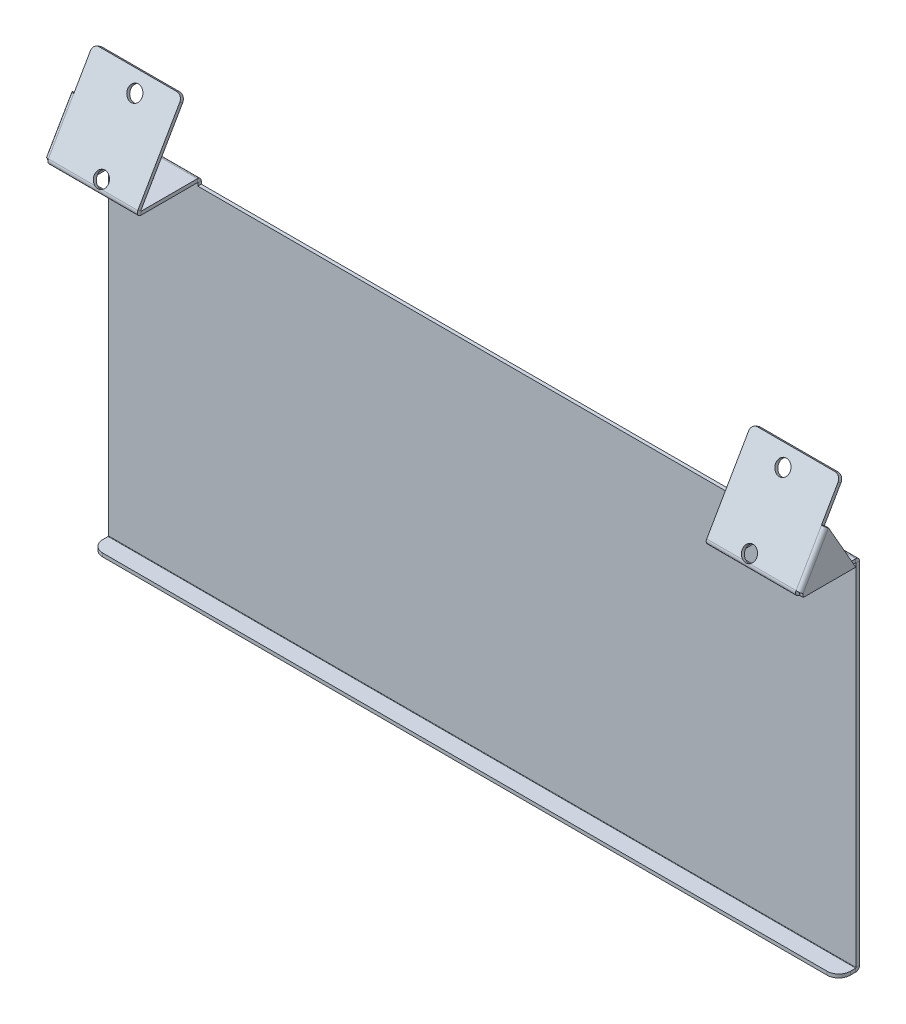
ISO-10303-21;
HEADER;
FILE_DESCRIPTION(('STEP AP214'),'2;1');
FILE_NAME('part.step','',(''),(''),'','','');
FILE_SCHEMA(('AUTOMOTIVE_DESIGN { 1 0 10303 214 1 1 1 1 }'));
ENDSEC;
DATA;
#1=APPLICATION_CONTEXT('core data for automotive mechanical design processes');
#2=APPLICATION_PROTOCOL_DEFINITION('international standard','automotive_design',2000,#1);
#3=PRODUCT_CONTEXT('',#1,'mechanical');
#4=PRODUCT('Part','Part','',(#3));
#5=PRODUCT_RELATED_PRODUCT_CATEGORY('part','',(#4));
#6=PRODUCT_DEFINITION_FORMATION('','',#4);
#7=PRODUCT_DEFINITION_CONTEXT('part definition',#1,'design');
#8=PRODUCT_DEFINITION('design','',#6,#7);
#9=PRODUCT_DEFINITION_SHAPE('','',#8);
#10=(LENGTH_UNIT() NAMED_UNIT(*) SI_UNIT(.MILLI.,.METRE.));
#11=(NAMED_UNIT(*) PLANE_ANGLE_UNIT() SI_UNIT($,.RADIAN.));
#12=(NAMED_UNIT(*) SI_UNIT($,.STERADIAN.) SOLID_ANGLE_UNIT());
#13=UNCERTAINTY_MEASURE_WITH_UNIT(LENGTH_MEASURE(1.E-05),#10,'distance_accuracy_value','');
#14=(GEOMETRIC_REPRESENTATION_CONTEXT(3) GLOBAL_UNCERTAINTY_ASSIGNED_CONTEXT((#13)) GLOBAL_UNIT_ASSIGNED_CONTEXT((#10,
#11,#12)) REPRESENTATION_CONTEXT('',''));
#15=CARTESIAN_POINT('',(0.,0.,0.));
#16=DIRECTION('',(0.,0.,1.));
#17=DIRECTION('',(1.,0.,0.));
#18=AXIS2_PLACEMENT_3D('',#15,#16,#17);
#19=CARTESIAN_POINT('',(0.,100.0506,-3.2453731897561E-13));
#20=DIRECTION('',(0.,-1.,0.));
#21=DIRECTION('',(0.,0.,-1.));
#22=AXIS2_PLACEMENT_3D('',#19,#20,#21);
#23=PLANE('',#22);
#24=DIRECTION('',(0.,0.,-1.));
#25=VECTOR('',#24,1.);
#26=CARTESIAN_POINT('',(-168.148,100.0506,31.119761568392));
#27=LINE('',#26,#25);
#28=CARTESIAN_POINT('',(-168.148,100.0506,31.119761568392));
#29=VERTEX_POINT('',#28);
#30=CARTESIAN_POINT('',(-168.148,100.0506,12.069761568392));
#31=VERTEX_POINT('',#30);
#32=EDGE_CURVE('E568',#29,#31,#27,.T.);
#33=ORIENTED_EDGE('',*,*,#32,.F.);
#34=DIRECTION('',(1.,0.,0.));
#35=VECTOR('',#34,1.);
#36=CARTESIAN_POINT('',(-156.083,100.0506,31.119761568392));
#37=LINE('',#36,#35);
#38=CARTESIAN_POINT('',(-156.083,100.0506,31.119761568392));
#39=VERTEX_POINT('',#38);
#40=EDGE_CURVE('E750',#39,#29,#37,.F.);
#41=ORIENTED_EDGE('',*,*,#40,.F.);
#42=DIRECTION('',(0.,0.,-1.));
#43=VECTOR('',#42,1.);
#44=CARTESIAN_POINT('',(-156.083,100.0506,33.66262));
#45=LINE('',#44,#43);
#46=CARTESIAN_POINT('',(-156.083,100.0506,0.203199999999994));
#47=VERTEX_POINT('',#46);
#48=EDGE_CURVE('E761',#47,#39,#45,.F.);
#49=ORIENTED_EDGE('',*,*,#48,.F.);
#50=DIRECTION('',(-1.,0.,0.));
#51=VECTOR('',#50,1.);
#52=CARTESIAN_POINT('',(-156.083,100.0506,0.203199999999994));
#53=LINE('',#52,#51);
#54=CARTESIAN_POINT('',(-205.105,100.0506,0.203199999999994));
#55=VERTEX_POINT('',#54);
#56=EDGE_CURVE('E772',#55,#47,#53,.F.);
#57=ORIENTED_EDGE('',*,*,#56,.F.);
#58=DIRECTION('',(0.,0.,1.));
#59=VECTOR('',#58,1.);
#60=CARTESIAN_POINT('',(-205.105,100.0506,0.));
#61=LINE('',#60,#59);
#62=CARTESIAN_POINT('',(-205.105,100.0506,31.119761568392));
#63=VERTEX_POINT('',#62);
#64=EDGE_CURVE('E765',#63,#55,#61,.F.);
#65=ORIENTED_EDGE('',*,*,#64,.F.);
#66=CARTESIAN_POINT('',(-187.198,100.0506,31.119761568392));
#67=VERTEX_POINT('',#66);
#68=EDGE_CURVE('E581',#67,#63,#37,.F.);
#69=ORIENTED_EDGE('',*,*,#68,.F.);
#70=DIRECTION('',(0.,0.,1.));
#71=VECTOR('',#70,1.);
#72=CARTESIAN_POINT('',(-187.198,100.0506,12.069761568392));
#73=LINE('',#72,#71);
#74=CARTESIAN_POINT('',(-187.198,100.0506,12.069761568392));
#75=VERTEX_POINT('',#74);
#76=EDGE_CURVE('E569',#75,#67,#73,.T.);
#77=ORIENTED_EDGE('',*,*,#76,.F.);
#78=DIRECTION('',(-1.,0.,0.));
#79=VECTOR('',#78,1.);
#80=CARTESIAN_POINT('',(-168.148,100.0506,12.069761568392));
#81=LINE('',#80,#79);
#82=EDGE_CURVE('E558',#31,#75,#81,.T.);
#83=ORIENTED_EDGE('',*,*,#82,.F.);
#84=EDGE_LOOP('',(#33,#41,#49,#57,#65,#69,#77,#83));
#85=FACE_BOUND('',#84,.T.);
#86=ADVANCED_FACE('F178',(#85),#23,.F.);
#87=CARTESIAN_POINT('',(0.,98.15322,-3.17912652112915E-13));
#88=DIRECTION('',(0.,-1.,0.));
#89=DIRECTION('',(0.,0.,-1.));
#90=AXIS2_PLACEMENT_3D('',#87,#88,#89);
#91=PLANE('',#90);
#92=DIRECTION('',(1.,0.,0.));
#93=VECTOR('',#92,1.);
#94=CARTESIAN_POINT('',(-156.083,98.1532200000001,31.119761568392));
#95=LINE('',#94,#93);
#96=CARTESIAN_POINT('',(-156.083,98.1532200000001,31.119761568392));
#97=VERTEX_POINT('',#96);
#98=CARTESIAN_POINT('',(-168.148,98.1532200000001,31.119761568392));
#99=VERTEX_POINT('',#98);
#100=EDGE_CURVE('E736',#97,#99,#95,.F.);
#101=ORIENTED_EDGE('',*,*,#100,.T.);
#102=DIRECTION('',(0.,0.,-1.));
#103=VECTOR('',#102,1.);
#104=CARTESIAN_POINT('',(-168.148,98.1532200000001,31.119761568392));
#105=LINE('',#104,#103);
#106=CARTESIAN_POINT('',(-168.148,98.15322,12.069761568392));
#107=VERTEX_POINT('',#106);
#108=EDGE_CURVE('E585',#99,#107,#105,.T.);
#109=ORIENTED_EDGE('',*,*,#108,.T.);
#110=DIRECTION('',(-1.,0.,0.));
#111=VECTOR('',#110,1.);
#112=CARTESIAN_POINT('',(-168.148,98.15322,12.069761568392));
#113=LINE('',#112,#111);
#114=CARTESIAN_POINT('',(-187.198,98.15322,12.069761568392));
#115=VERTEX_POINT('',#114);
#116=EDGE_CURVE('E593',#107,#115,#113,.T.);
#117=ORIENTED_EDGE('',*,*,#116,.T.);
#118=DIRECTION('',(0.,0.,1.));
#119=VECTOR('',#118,1.);
#120=CARTESIAN_POINT('',(-187.198,98.15322,12.069761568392));
#121=LINE('',#120,#119);
#122=CARTESIAN_POINT('',(-187.198,98.1532200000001,31.119761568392));
#123=VERTEX_POINT('',#122);
#124=EDGE_CURVE('E576',#115,#123,#121,.T.);
#125=ORIENTED_EDGE('',*,*,#124,.T.);
#126=CARTESIAN_POINT('',(-205.105,98.1532200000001,31.119761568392));
#127=VERTEX_POINT('',#126);
#128=EDGE_CURVE('E740',#123,#127,#95,.F.);
#129=ORIENTED_EDGE('',*,*,#128,.T.);
#130=DIRECTION('',(0.,0.,-1.));
#131=VECTOR('',#130,1.);
#132=CARTESIAN_POINT('',(-205.105,98.15322,-3.17912652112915E-13));
#133=LINE('',#132,#131);
#134=CARTESIAN_POINT('',(-205.105,98.15322,0.203200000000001));
#135=VERTEX_POINT('',#134);
#136=EDGE_CURVE('E770',#127,#135,#133,.T.);
#137=ORIENTED_EDGE('',*,*,#136,.T.);
#138=DIRECTION('',(-1.,0.,0.));
#139=VECTOR('',#138,1.);
#140=CARTESIAN_POINT('',(-156.083,98.15322,0.203200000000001));
#141=LINE('',#140,#139);
#142=CARTESIAN_POINT('',(-156.083,98.15322,0.203200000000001));
#143=VERTEX_POINT('',#142);
#144=EDGE_CURVE('E777',#143,#135,#141,.T.);
#145=ORIENTED_EDGE('',*,*,#144,.F.);
#146=DIRECTION('',(0.,0.,1.));
#147=VECTOR('',#146,1.);
#148=CARTESIAN_POINT('',(-156.083,98.15322,-3.17912652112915E-13));
#149=LINE('',#148,#147);
#150=EDGE_CURVE('E767',#143,#97,#149,.T.);
#151=ORIENTED_EDGE('',*,*,#150,.T.);
#152=EDGE_LOOP('',(#101,#109,#117,#125,#129,#137,#145,#151));
#153=FACE_BOUND('',#152,.T.);
#154=ADVANCED_FACE('F1207',(#153),#91,.T.);
#155=CARTESIAN_POINT('',(0.,40.5376820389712,68.0224192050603));
#156=DIRECTION('',(0.,-0.500000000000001,-0.866025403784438));
#157=DIRECTION('',(0.,0.866025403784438,-0.500000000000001));
#158=AXIS2_PLACEMENT_3D('',#155,#156,#157);
#159=PLANE('',#158);
#160=DIRECTION('',(0.,0.866025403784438,-0.500000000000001));
#161=VECTOR('',#160,1.);
#162=CARTESIAN_POINT('',(-156.083,100.99929,33.1148935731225));
#163=LINE('',#162,#161);
#164=CARTESIAN_POINT('',(-156.083,141.157443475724,9.92957285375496));
#165=VERTEX_POINT('',#164);
#166=CARTESIAN_POINT('',(-156.083,101.30409,32.9389172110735));
#167=VERTEX_POINT('',#166);
#168=EDGE_CURVE('E712',#165,#167,#163,.F.);
#169=ORIENTED_EDGE('',*,*,#168,.F.);
#170=CARTESIAN_POINT('',(-159.258,141.157443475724,9.92957285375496));
#171=DIRECTION('',(0.,-0.500000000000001,-0.866025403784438));
#172=DIRECTION('',(0.,0.866025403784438,-0.500000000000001));
#173=AXIS2_PLACEMENT_3D('',#170,#171,#172);
#174=CIRCLE('',#173,3.175);
#175=CARTESIAN_POINT('',(-159.258,143.90707413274,8.34207285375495));
#176=VERTEX_POINT('',#175);
#177=EDGE_CURVE('E186',#165,#176,#174,.F.);
#178=ORIENTED_EDGE('',*,*,#177,.T.);
#179=DIRECTION('',(-1.,0.,0.));
#180=VECTOR('',#179,1.);
#181=CARTESIAN_POINT('',(-156.083,143.90707413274,8.34207285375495));
#182=LINE('',#181,#180);
#183=CARTESIAN_POINT('',(-201.93,143.90707413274,8.34207285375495));
#184=VERTEX_POINT('',#183);
#185=EDGE_CURVE('E709',#184,#176,#182,.F.);
#186=ORIENTED_EDGE('',*,*,#185,.F.);
#187=CARTESIAN_POINT('',(-201.93,141.157443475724,9.92957285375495));
#188=DIRECTION('',(0.,-0.500000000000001,-0.866025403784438));
#189=DIRECTION('',(0.,0.866025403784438,-0.500000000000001));
#190=AXIS2_PLACEMENT_3D('',#187,#188,#189);
#191=CIRCLE('',#190,3.175);
#192=CARTESIAN_POINT('',(-205.105,141.157443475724,9.92957285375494));
#193=VERTEX_POINT('',#192);
#194=EDGE_CURVE('E193',#184,#193,#191,.F.);
#195=ORIENTED_EDGE('',*,*,#194,.T.);
#196=DIRECTION('',(0.,-0.866025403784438,0.500000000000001));
#197=VECTOR('',#196,1.);
#198=CARTESIAN_POINT('',(-205.105,143.90707413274,8.34207285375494));
#199=LINE('',#198,#197);
#200=CARTESIAN_POINT('',(-205.105,125.429556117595,19.010072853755));
#201=VERTEX_POINT('',#200);
#202=EDGE_CURVE('E706',#201,#193,#199,.F.);
#203=ORIENTED_EDGE('',*,*,#202,.F.);
#204=DIRECTION('',(1.,0.,0.));
#205=VECTOR('',#204,1.);
#206=CARTESIAN_POINT('',(-205.1558,125.429556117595,19.010072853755));
#207=LINE('',#206,#205);
#208=CARTESIAN_POINT('',(-205.1558,125.429556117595,19.010072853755));
#209=VERTEX_POINT('',#208);
#210=EDGE_CURVE('E700',#209,#201,#207,.T.);
#211=ORIENTED_EDGE('',*,*,#210,.F.);
#212=DIRECTION('',(0.,0.86602540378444,-0.499999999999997));
#213=VECTOR('',#212,1.);
#214=CARTESIAN_POINT('',(-205.1558,125.429556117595,19.010072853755));
#215=LINE('',#214,#213);
#216=CARTESIAN_POINT('',(-205.1558,101.30409,32.9389172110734));
#217=VERTEX_POINT('',#216);
#218=EDGE_CURVE('E678',#209,#217,#215,.F.);
#219=ORIENTED_EDGE('',*,*,#218,.T.);
#220=DIRECTION('',(1.,0.,0.));
#221=VECTOR('',#220,1.);
#222=CARTESIAN_POINT('',(-205.1558,101.30409,32.9389172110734));
#223=LINE('',#222,#221);
#224=CARTESIAN_POINT('',(-205.105,101.30409,32.9389172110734));
#225=VERTEX_POINT('',#224);
#226=EDGE_CURVE('E697',#217,#225,#223,.T.);
#227=ORIENTED_EDGE('',*,*,#226,.T.);
#228=DIRECTION('',(1.,0.,0.));
#229=VECTOR('',#228,1.);
#230=CARTESIAN_POINT('',(-205.105,101.30409,32.9389172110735));
#231=LINE('',#230,#229);
#232=CARTESIAN_POINT('',(-179.672793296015,101.30409,32.9389172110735));
#233=VERTEX_POINT('',#232);
#234=EDGE_CURVE('E725',#233,#225,#231,.F.);
#235=ORIENTED_EDGE('',*,*,#234,.F.);
#236=CARTESIAN_POINT('',(-177.8,104.334389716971,31.189372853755));
#237=DIRECTION('',(0.,0.500000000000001,0.866025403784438));
#238=DIRECTION('',(0.,-0.866025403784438,0.500000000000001));
#239=AXIS2_PLACEMENT_3D('',#236,#237,#238);
#240=CIRCLE('',#239,3.96874999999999);
#241=CARTESIAN_POINT('',(-175.927206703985,101.30409,32.9389172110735));
#242=VERTEX_POINT('',#241);
#243=EDGE_CURVE('E608',#242,#233,#240,.T.);
#244=ORIENTED_EDGE('',*,*,#243,.F.);
#245=EDGE_CURVE('E722',#167,#242,#231,.F.);
#246=ORIENTED_EDGE('',*,*,#245,.F.);
#247=EDGE_LOOP('',(#169,#178,#186,#195,#203,#211,#219,#227,#235,#244,#246));
#248=FACE_BOUND('',#247,.T.);
#249=CARTESIAN_POINT('',(-177.8,136.098123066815,12.8505728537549));
#250=DIRECTION('',(0.,0.500000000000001,0.866025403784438));
#251=DIRECTION('',(0.,-0.866025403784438,0.500000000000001));
#252=AXIS2_PLACEMENT_3D('',#249,#250,#251);
#253=CIRCLE('',#252,3.96874999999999);
#254=CARTESIAN_POINT('',(-177.8,132.661084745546,14.8349478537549));
#255=VERTEX_POINT('',#254);
#256=EDGE_CURVE('E599',#255,#255,#253,.T.);
#257=ORIENTED_EDGE('',*,*,#256,.F.);
#258=EDGE_LOOP('',(#257));
#259=FACE_BOUND('',#258,.T.);
#260=ADVANCED_FACE('F1180',(#248,#259),#159,.F.);
#261=CARTESIAN_POINT('',(-205.105,143.90707413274,8.34207285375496));
#262=DIRECTION('',(-1.,0.,0.));
#263=DIRECTION('',(0.,0.,1.));
#264=AXIS2_PLACEMENT_3D('',#261,#262,#263);
#265=PLANE('',#264);
#266=ORIENTED_EDGE('',*,*,#202,.T.);
#267=DIRECTION('',(0.,-0.500000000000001,-0.866025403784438));
#268=VECTOR('',#267,1.);
#269=CARTESIAN_POINT('',(-205.105,141.157443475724,9.92957285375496));
#270=LINE('',#269,#268);
#271=CARTESIAN_POINT('',(-205.105,140.208753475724,8.28639357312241));
#272=VERTEX_POINT('',#271);
#273=EDGE_CURVE('E13',#193,#272,#270,.T.);
#274=ORIENTED_EDGE('',*,*,#273,.T.);
#275=DIRECTION('',(0.,0.866025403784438,-0.500000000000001));
#276=VECTOR('',#275,1.);
#277=CARTESIAN_POINT('',(-205.105,39.5889920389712,66.3792399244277));
#278=LINE('',#277,#276);
#279=CARTESIAN_POINT('',(-205.105,124.480866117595,17.3668935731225));
#280=VERTEX_POINT('',#279);
#281=EDGE_CURVE('E714',#280,#272,#278,.T.);
#282=ORIENTED_EDGE('',*,*,#281,.F.);
#283=DIRECTION('',(0.,0.499999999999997,0.86602540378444));
#284=VECTOR('',#283,1.);
#285=CARTESIAN_POINT('',(-205.105,124.480866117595,17.3668935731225));
#286=LINE('',#285,#284);
#287=EDGE_CURVE('E690',#280,#201,#286,.T.);
#288=ORIENTED_EDGE('',*,*,#287,.T.);
#289=EDGE_LOOP('',(#266,#274,#282,#288));
#290=FACE_BOUND('',#289,.T.);
#291=ADVANCED_FACE('F1383',(#290),#265,.T.);
#292=CARTESIAN_POINT('',(-156.083,100.0506,33.66262));
#293=DIRECTION('',(1.,0.,0.));
#294=DIRECTION('',(0.,1.,0.));
#295=AXIS2_PLACEMENT_3D('',#292,#293,#294);
#296=PLANE('',#295);
#297=ORIENTED_EDGE('',*,*,#48,.T.);
#298=DIRECTION('',(0.,-1.,0.));
#299=VECTOR('',#298,1.);
#300=CARTESIAN_POINT('',(-156.083,100.0506,31.119761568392));
#301=LINE('',#300,#299);
#302=EDGE_CURVE('E743',#39,#97,#301,.T.);
#303=ORIENTED_EDGE('',*,*,#302,.T.);
#304=ORIENTED_EDGE('',*,*,#150,.F.);
#305=DIRECTION('',(0.,1.,0.));
#306=VECTOR('',#305,1.);
#307=CARTESIAN_POINT('',(-156.083,100.0506,0.203200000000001));
#308=LINE('',#307,#306);
#309=EDGE_CURVE('E758',#143,#47,#308,.T.);
#310=ORIENTED_EDGE('',*,*,#309,.T.);
#311=EDGE_LOOP('',(#297,#303,#304,#310));
#312=FACE_BOUND('',#311,.T.);
#313=ADVANCED_FACE('F1212',(#312),#296,.T.);
#314=CARTESIAN_POINT('',(0.,40.5376820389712,68.0224192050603));
#315=DIRECTION('',(0.,-0.500000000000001,-0.866025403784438));
#316=DIRECTION('',(0.,0.866025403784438,-0.500000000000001));
#317=AXIS2_PLACEMENT_3D('',#314,#315,#316);
#318=PLANE('',#317);
#319=DIRECTION('',(-1.,0.,0.));
#320=VECTOR('',#319,1.);
#321=CARTESIAN_POINT('',(0.,143.90707413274,8.34207285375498));
#322=LINE('',#321,#320);
#323=CARTESIAN_POINT('',(201.93,143.90707413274,8.34207285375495));
#324=VERTEX_POINT('',#323);
#325=CARTESIAN_POINT('',(159.258,143.90707413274,8.34207285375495));
#326=VERTEX_POINT('',#325);
#327=EDGE_CURVE('E953',#324,#326,#322,.T.);
#328=ORIENTED_EDGE('',*,*,#327,.T.);
#329=CARTESIAN_POINT('',(159.258,141.157443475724,9.92957285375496));
#330=DIRECTION('',(0.,-0.500000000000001,-0.866025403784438));
#331=DIRECTION('',(0.,0.866025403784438,-0.500000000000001));
#332=AXIS2_PLACEMENT_3D('',#329,#330,#331);
#333=CIRCLE('',#332,3.175);
#334=CARTESIAN_POINT('',(156.083,141.157443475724,9.92957285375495));
#335=VERTEX_POINT('',#334);
#336=EDGE_CURVE('E1162',#326,#335,#333,.F.);
#337=ORIENTED_EDGE('',*,*,#336,.T.);
#338=DIRECTION('',(0.,-0.866025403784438,0.500000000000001));
#339=VECTOR('',#338,1.);
#340=CARTESIAN_POINT('',(156.083,40.5376820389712,68.0224192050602));
#341=LINE('',#340,#339);
#342=CARTESIAN_POINT('',(156.083,101.30409,32.9389172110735));
#343=VERTEX_POINT('',#342);
#344=EDGE_CURVE('E960',#335,#343,#341,.T.);
#345=ORIENTED_EDGE('',*,*,#344,.T.);
#346=DIRECTION('',(1.,0.,0.));
#347=VECTOR('',#346,1.);
#348=CARTESIAN_POINT('',(156.083,101.30409,32.9389172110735));
#349=LINE('',#348,#347);
#350=CARTESIAN_POINT('',(175.927206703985,101.30409,32.9389172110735));
#351=VERTEX_POINT('',#350);
#352=EDGE_CURVE('E973',#351,#343,#349,.F.);
#353=ORIENTED_EDGE('',*,*,#352,.F.);
#354=CARTESIAN_POINT('',(177.8,104.334389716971,31.189372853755));
#355=DIRECTION('',(0.,0.500000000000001,0.866025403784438));
#356=DIRECTION('',(0.,-0.866025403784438,0.500000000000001));
#357=AXIS2_PLACEMENT_3D('',#354,#355,#356);
#358=CIRCLE('',#357,3.96874999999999);
#359=CARTESIAN_POINT('',(179.672793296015,101.30409,32.9389172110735));
#360=VERTEX_POINT('',#359);
#361=EDGE_CURVE('E852',#360,#351,#358,.T.);
#362=ORIENTED_EDGE('',*,*,#361,.F.);
#363=CARTESIAN_POINT('',(205.105,101.30409,32.9389172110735));
#364=VERTEX_POINT('',#363);
#365=EDGE_CURVE('E970',#364,#360,#349,.F.);
#366=ORIENTED_EDGE('',*,*,#365,.F.);
#367=DIRECTION('',(-1.,0.,0.));
#368=VECTOR('',#367,1.);
#369=CARTESIAN_POINT('',(205.1558,101.30409,32.9389172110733));
#370=LINE('',#369,#368);
#371=CARTESIAN_POINT('',(205.1558,101.30409,32.9389172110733));
#372=VERTEX_POINT('',#371);
#373=EDGE_CURVE('E944',#372,#364,#370,.T.);
#374=ORIENTED_EDGE('',*,*,#373,.F.);
#375=DIRECTION('',(0.,-0.866025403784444,0.49999999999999));
#376=VECTOR('',#375,1.);
#377=CARTESIAN_POINT('',(205.1558,101.048700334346,33.0863665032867));
#378=LINE('',#377,#376);
#379=CARTESIAN_POINT('',(205.1558,125.429556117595,19.0100728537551));
#380=VERTEX_POINT('',#379);
#381=EDGE_CURVE('E922',#372,#380,#378,.F.);
#382=ORIENTED_EDGE('',*,*,#381,.T.);
#383=DIRECTION('',(-1.,0.,0.));
#384=VECTOR('',#383,1.);
#385=CARTESIAN_POINT('',(205.1558,125.429556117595,19.0100728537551));
#386=LINE('',#385,#384);
#387=CARTESIAN_POINT('',(205.105,125.429556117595,19.0100728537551));
#388=VERTEX_POINT('',#387);
#389=EDGE_CURVE('E941',#380,#388,#386,.T.);
#390=ORIENTED_EDGE('',*,*,#389,.T.);
#391=DIRECTION('',(0.,0.866025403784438,-0.500000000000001));
#392=VECTOR('',#391,1.);
#393=CARTESIAN_POINT('',(205.105,40.5376820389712,68.0224192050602));
#394=LINE('',#393,#392);
#395=CARTESIAN_POINT('',(205.105,141.157443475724,9.92957285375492));
#396=VERTEX_POINT('',#395);
#397=EDGE_CURVE('E957',#388,#396,#394,.T.);
#398=ORIENTED_EDGE('',*,*,#397,.T.);
#399=CARTESIAN_POINT('',(201.93,141.157443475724,9.92957285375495));
#400=DIRECTION('',(0.,-0.500000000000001,-0.866025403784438));
#401=DIRECTION('',(0.,0.866025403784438,-0.500000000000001));
#402=AXIS2_PLACEMENT_3D('',#399,#400,#401);
#403=CIRCLE('',#402,3.175);
#404=EDGE_CURVE('E1160',#396,#324,#403,.F.);
#405=ORIENTED_EDGE('',*,*,#404,.T.);
#406=EDGE_LOOP('',(#328,#337,#345,#353,#362,#366,#374,#382,#390,#398,#405));
#407=FACE_BOUND('',#406,.T.);
#408=CARTESIAN_POINT('',(177.8,136.098123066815,12.8505728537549));
#409=DIRECTION('',(0.,0.500000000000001,0.866025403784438));
#410=DIRECTION('',(0.,-0.866025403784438,0.500000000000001));
#411=AXIS2_PLACEMENT_3D('',#408,#409,#410);
#412=CIRCLE('',#411,3.96874999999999);
#413=CARTESIAN_POINT('',(177.8,132.661084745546,14.8349478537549));
#414=VERTEX_POINT('',#413);
#415=EDGE_CURVE('E840',#414,#414,#412,.T.);
#416=ORIENTED_EDGE('',*,*,#415,.F.);
#417=EDGE_LOOP('',(#416));
#418=FACE_BOUND('',#417,.T.);
#419=ADVANCED_FACE('F1349',(#407,#418),#318,.F.);
#420=CARTESIAN_POINT('',(205.105,143.90707413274,8.34207285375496));
#421=DIRECTION('',(-1.,0.,0.));
#422=DIRECTION('',(0.,0.,1.));
#423=AXIS2_PLACEMENT_3D('',#420,#421,#422);
#424=PLANE('',#423);
#425=DIRECTION('',(0.,-0.866025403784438,0.500000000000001));
#426=VECTOR('',#425,1.);
#427=CARTESIAN_POINT('',(205.105,142.95838413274,6.69889357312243));
#428=LINE('',#427,#426);
#429=CARTESIAN_POINT('',(205.105,124.480866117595,17.3668935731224));
#430=VERTEX_POINT('',#429);
#431=CARTESIAN_POINT('',(205.105,140.208753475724,8.28639357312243));
#432=VERTEX_POINT('',#431);
#433=EDGE_CURVE('E965',#430,#432,#428,.F.);
#434=ORIENTED_EDGE('',*,*,#433,.T.);
#435=DIRECTION('',(0.,-0.500000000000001,-0.866025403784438));
#436=VECTOR('',#435,1.);
#437=CARTESIAN_POINT('',(205.105,141.157443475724,9.92957285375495));
#438=LINE('',#437,#436);
#439=EDGE_CURVE('E1164',#432,#396,#438,.F.);
#440=ORIENTED_EDGE('',*,*,#439,.T.);
#441=ORIENTED_EDGE('',*,*,#397,.F.);
#442=DIRECTION('',(0.,0.49999999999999,0.866025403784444));
#443=VECTOR('',#442,1.);
#444=CARTESIAN_POINT('',(205.105,124.480866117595,17.3668935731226));
#445=LINE('',#444,#443);
#446=EDGE_CURVE('E934',#430,#388,#445,.T.);
#447=ORIENTED_EDGE('',*,*,#446,.F.);
#448=EDGE_LOOP('',(#434,#440,#441,#447));
#449=FACE_BOUND('',#448,.T.);
#450=ADVANCED_FACE('F1422',(#449),#424,.F.);
#451=CARTESIAN_POINT('',(205.105,100.0506,0.));
#452=DIRECTION('',(-1.,0.,0.));
#453=DIRECTION('',(0.,-1.,0.));
#454=AXIS2_PLACEMENT_3D('',#451,#452,#453);
#455=PLANE('',#454);
#456=DIRECTION('',(0.,-1.,0.));
#457=VECTOR('',#456,1.);
#458=CARTESIAN_POINT('',(205.105,100.0506,31.119761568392));
#459=LINE('',#458,#457);
#460=CARTESIAN_POINT('',(205.105,100.0506,31.119761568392));
#461=VERTEX_POINT('',#460);
#462=CARTESIAN_POINT('',(205.105,98.1532200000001,31.119761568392));
#463=VERTEX_POINT('',#462);
#464=EDGE_CURVE('E991',#461,#463,#459,.T.);
#465=ORIENTED_EDGE('',*,*,#464,.T.);
#466=DIRECTION('',(0.,0.,1.));
#467=VECTOR('',#466,1.);
#468=CARTESIAN_POINT('',(205.105,98.15322,0.));
#469=LINE('',#468,#467);
#470=CARTESIAN_POINT('',(205.105,98.15322,0.203200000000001));
#471=VERTEX_POINT('',#470);
#472=EDGE_CURVE('E1019',#463,#471,#469,.F.);
#473=ORIENTED_EDGE('',*,*,#472,.T.);
#474=DIRECTION('',(0.,-1.,0.));
#475=VECTOR('',#474,1.);
#476=CARTESIAN_POINT('',(205.105,100.0506,0.203199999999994));
#477=LINE('',#476,#475);
#478=CARTESIAN_POINT('',(205.105,100.0506,0.203199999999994));
#479=VERTEX_POINT('',#478);
#480=EDGE_CURVE('E1007',#471,#479,#477,.F.);
#481=ORIENTED_EDGE('',*,*,#480,.T.);
#482=DIRECTION('',(0.,0.,-1.));
#483=VECTOR('',#482,1.);
#484=CARTESIAN_POINT('',(205.105,100.0506,-3.2453731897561E-13));
#485=LINE('',#484,#483);
#486=EDGE_CURVE('E1014',#461,#479,#485,.T.);
#487=ORIENTED_EDGE('',*,*,#486,.F.);
#488=EDGE_LOOP('',(#465,#473,#481,#487));
#489=FACE_BOUND('',#488,.T.);
#490=ADVANCED_FACE('F1305',(#489),#455,.F.);
#491=CARTESIAN_POINT('',(156.083,100.0506,33.66262));
#492=DIRECTION('',(1.,0.,0.));
#493=DIRECTION('',(0.,1.,0.));
#494=AXIS2_PLACEMENT_3D('',#491,#492,#493);
#495=PLANE('',#494);
#496=DIRECTION('',(0.,-1.,0.));
#497=VECTOR('',#496,1.);
#498=CARTESIAN_POINT('',(156.083,100.0506,31.119761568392));
#499=LINE('',#498,#497);
#500=CARTESIAN_POINT('',(156.083,100.0506,31.119761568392));
#501=VERTEX_POINT('',#500);
#502=CARTESIAN_POINT('',(156.083,98.1532200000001,31.119761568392));
#503=VERTEX_POINT('',#502);
#504=EDGE_CURVE('E1004',#501,#503,#499,.T.);
#505=ORIENTED_EDGE('',*,*,#504,.F.);
#506=DIRECTION('',(0.,0.,1.));
#507=VECTOR('',#506,1.);
#508=CARTESIAN_POINT('',(156.083,100.0506,-3.2453731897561E-13));
#509=LINE('',#508,#507);
#510=CARTESIAN_POINT('',(156.083,100.0506,0.203199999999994));
#511=VERTEX_POINT('',#510);
#512=EDGE_CURVE('E1010',#511,#501,#509,.T.);
#513=ORIENTED_EDGE('',*,*,#512,.F.);
#514=DIRECTION('',(0.,-1.,0.));
#515=VECTOR('',#514,1.);
#516=CARTESIAN_POINT('',(156.083,98.15322,0.203200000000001));
#517=LINE('',#516,#515);
#518=CARTESIAN_POINT('',(156.083,98.15322,0.203200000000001));
#519=VERTEX_POINT('',#518);
#520=EDGE_CURVE('E1024',#519,#511,#517,.F.);
#521=ORIENTED_EDGE('',*,*,#520,.F.);
#522=DIRECTION('',(0.,0.,-1.));
#523=VECTOR('',#522,1.);
#524=CARTESIAN_POINT('',(156.083,98.1532200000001,33.66262));
#525=LINE('',#524,#523);
#526=EDGE_CURVE('E1016',#519,#503,#525,.F.);
#527=ORIENTED_EDGE('',*,*,#526,.T.);
#528=EDGE_LOOP('',(#505,#513,#521,#527));
#529=FACE_BOUND('',#528,.T.);
#530=ADVANCED_FACE('F1290',(#529),#495,.F.);
#531=CARTESIAN_POINT('',(0.,100.0506,-3.2453731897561E-13));
#532=DIRECTION('',(0.,-1.,0.));
#533=DIRECTION('',(0.,0.,-1.));
#534=AXIS2_PLACEMENT_3D('',#531,#532,#533);
#535=PLANE('',#534);
#536=DIRECTION('',(1.,0.,0.));
#537=VECTOR('',#536,1.);
#538=CARTESIAN_POINT('',(168.148,100.0506,12.069761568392));
#539=LINE('',#538,#537);
#540=CARTESIAN_POINT('',(168.148,100.0506,12.069761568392));
#541=VERTEX_POINT('',#540);
#542=CARTESIAN_POINT('',(187.198,100.0506,12.069761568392));
#543=VERTEX_POINT('',#542);
#544=EDGE_CURVE('E821',#541,#543,#539,.T.);
#545=ORIENTED_EDGE('',*,*,#544,.T.);
#546=DIRECTION('',(0.,0.,1.));
#547=VECTOR('',#546,1.);
#548=CARTESIAN_POINT('',(187.198,100.0506,12.069761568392));
#549=LINE('',#548,#547);
#550=CARTESIAN_POINT('',(187.198,100.0506,31.119761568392));
#551=VERTEX_POINT('',#550);
#552=EDGE_CURVE('E824',#543,#551,#549,.T.);
#553=ORIENTED_EDGE('',*,*,#552,.T.);
#554=DIRECTION('',(1.,0.,0.));
#555=VECTOR('',#554,1.);
#556=CARTESIAN_POINT('',(205.105,100.0506,31.119761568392));
#557=LINE('',#556,#555);
#558=EDGE_CURVE('E998',#461,#551,#557,.F.);
#559=ORIENTED_EDGE('',*,*,#558,.F.);
#560=ORIENTED_EDGE('',*,*,#486,.T.);
#561=DIRECTION('',(-1.,0.,0.));
#562=VECTOR('',#561,1.);
#563=CARTESIAN_POINT('',(205.105,100.0506,0.203199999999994));
#564=LINE('',#563,#562);
#565=EDGE_CURVE('E1021',#511,#479,#564,.F.);
#566=ORIENTED_EDGE('',*,*,#565,.F.);
#567=ORIENTED_EDGE('',*,*,#512,.T.);
#568=CARTESIAN_POINT('',(168.148,100.0506,31.119761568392));
#569=VERTEX_POINT('',#568);
#570=EDGE_CURVE('E1001',#569,#501,#557,.F.);
#571=ORIENTED_EDGE('',*,*,#570,.F.);
#572=DIRECTION('',(0.,0.,-1.));
#573=VECTOR('',#572,1.);
#574=CARTESIAN_POINT('',(168.148,100.0506,31.119761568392));
#575=LINE('',#574,#573);
#576=EDGE_CURVE('E817',#569,#541,#575,.T.);
#577=ORIENTED_EDGE('',*,*,#576,.T.);
#578=EDGE_LOOP('',(#545,#553,#559,#560,#566,#567,#571,#577));
#579=FACE_BOUND('',#578,.T.);
#580=ADVANCED_FACE('F1294',(#579),#535,.F.);
#581=CARTESIAN_POINT('',(0.,98.15322,-3.17912652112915E-13));
#582=DIRECTION('',(0.,-1.,0.));
#583=DIRECTION('',(0.,0.,-1.));
#584=AXIS2_PLACEMENT_3D('',#581,#582,#583);
#585=PLANE('',#584);
#586=DIRECTION('',(0.,0.,1.));
#587=VECTOR('',#586,1.);
#588=CARTESIAN_POINT('',(187.198,98.15322,12.069761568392));
#589=LINE('',#588,#587);
#590=CARTESIAN_POINT('',(187.198,98.15322,12.069761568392));
#591=VERTEX_POINT('',#590);
#592=CARTESIAN_POINT('',(187.198,98.1532200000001,31.119761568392));
#593=VERTEX_POINT('',#592);
#594=EDGE_CURVE('E818',#591,#593,#589,.T.);
#595=ORIENTED_EDGE('',*,*,#594,.F.);
#596=DIRECTION('',(1.,0.,0.));
#597=VECTOR('',#596,1.);
#598=CARTESIAN_POINT('',(168.148,98.15322,12.069761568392));
#599=LINE('',#598,#597);
#600=CARTESIAN_POINT('',(168.148,98.15322,12.069761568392));
#601=VERTEX_POINT('',#600);
#602=EDGE_CURVE('E833',#601,#591,#599,.T.);
#603=ORIENTED_EDGE('',*,*,#602,.F.);
#604=DIRECTION('',(0.,0.,-1.));
#605=VECTOR('',#604,1.);
#606=CARTESIAN_POINT('',(168.148,98.1532200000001,31.119761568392));
#607=LINE('',#606,#605);
#608=CARTESIAN_POINT('',(168.148,98.1532200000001,31.119761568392));
#609=VERTEX_POINT('',#608);
#610=EDGE_CURVE('E830',#609,#601,#607,.T.);
#611=ORIENTED_EDGE('',*,*,#610,.F.);
#612=DIRECTION('',(1.,0.,0.));
#613=VECTOR('',#612,1.);
#614=CARTESIAN_POINT('',(205.105,98.1532200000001,31.119761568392));
#615=LINE('',#614,#613);
#616=EDGE_CURVE('E988',#609,#503,#615,.F.);
#617=ORIENTED_EDGE('',*,*,#616,.T.);
#618=ORIENTED_EDGE('',*,*,#526,.F.);
#619=DIRECTION('',(-1.,0.,0.));
#620=VECTOR('',#619,1.);
#621=CARTESIAN_POINT('',(205.105,98.15322,0.203200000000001));
#622=LINE('',#621,#620);
#623=EDGE_CURVE('E1027',#471,#519,#622,.T.);
#624=ORIENTED_EDGE('',*,*,#623,.F.);
#625=ORIENTED_EDGE('',*,*,#472,.F.);
#626=EDGE_CURVE('E984',#463,#593,#615,.F.);
#627=ORIENTED_EDGE('',*,*,#626,.T.);
#628=EDGE_LOOP('',(#595,#603,#611,#617,#618,#624,#625,#627));
#629=FACE_BOUND('',#628,.T.);
#630=ADVANCED_FACE('F1284',(#629),#585,.T.);
#631=CARTESIAN_POINT('',(-205.105,96.393,-1.89738));
#632=DIRECTION('',(0.,1.,0.));
#633=DIRECTION('',(-1.,0.,0.));
#634=AXIS2_PLACEMENT_3D('',#631,#632,#633);
#635=PLANE('',#634);
#636=DIRECTION('',(0.,0.,-1.));
#637=VECTOR('',#636,1.);
#638=CARTESIAN_POINT('',(-156.083,96.393,0.));
#639=LINE('',#638,#637);
#640=CARTESIAN_POINT('',(-156.083,96.393,0.));
#641=VERTEX_POINT('',#640);
#642=CARTESIAN_POINT('',(-156.083,96.393,-1.89738));
#643=VERTEX_POINT('',#642);
#644=EDGE_CURVE('E802',#641,#643,#639,.T.);
#645=ORIENTED_EDGE('',*,*,#644,.F.);
#646=DIRECTION('',(-1.,0.,0.));
#647=VECTOR('',#646,1.);
#648=CARTESIAN_POINT('',(-205.105,96.393,0.));
#649=LINE('',#648,#647);
#650=CARTESIAN_POINT('',(156.083,96.393,0.));
#651=VERTEX_POINT('',#650);
#652=EDGE_CURVE('E1115',#651,#641,#649,.T.);
#653=ORIENTED_EDGE('',*,*,#652,.F.);
#654=DIRECTION('',(0.,0.,-1.));
#655=VECTOR('',#654,1.);
#656=CARTESIAN_POINT('',(156.083,96.393,0.));
#657=LINE('',#656,#655);
#658=CARTESIAN_POINT('',(156.083,96.393,-1.89738));
#659=VERTEX_POINT('',#658);
#660=EDGE_CURVE('E1051',#651,#659,#657,.T.);
#661=ORIENTED_EDGE('',*,*,#660,.T.);
#662=DIRECTION('',(-1.,0.,0.));
#663=VECTOR('',#662,1.);
#664=CARTESIAN_POINT('',(-205.105,96.393,-1.89738));
#665=LINE('',#664,#663);
#666=EDGE_CURVE('E1118',#659,#643,#665,.T.);
#667=ORIENTED_EDGE('',*,*,#666,.T.);
#668=EDGE_LOOP('',(#645,#653,#661,#667));
#669=FACE_BOUND('',#668,.T.);
#670=ADVANCED_FACE('F1268',(#669),#635,.T.);
#671=CARTESIAN_POINT('',(205.105,-96.393,-1.89738));
#672=DIRECTION('',(1.,0.,0.));
#673=DIRECTION('',(0.,0.,-1.));
#674=AXIS2_PLACEMENT_3D('',#671,#672,#673);
#675=PLANE('',#674);
#676=DIRECTION('',(0.,1.,0.));
#677=VECTOR('',#676,1.);
#678=CARTESIAN_POINT('',(205.105,-96.393,0.));
#679=LINE('',#678,#677);
#680=CARTESIAN_POINT('',(205.105,-94.29242,0.));
#681=VERTEX_POINT('',#680);
#682=CARTESIAN_POINT('',(205.105,97.95002,0.));
#683=VERTEX_POINT('',#682);
#684=EDGE_CURVE('E1123',#681,#683,#679,.T.);
#685=ORIENTED_EDGE('',*,*,#684,.F.);
#686=DIRECTION('',(0.,0.,-1.));
#687=VECTOR('',#686,1.);
#688=CARTESIAN_POINT('',(205.105,-94.29242,0.));
#689=LINE('',#688,#687);
#690=CARTESIAN_POINT('',(205.105,-94.29242,-1.89738000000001));
#691=VERTEX_POINT('',#690);
#692=EDGE_CURVE('E1095',#681,#691,#689,.T.);
#693=ORIENTED_EDGE('',*,*,#692,.T.);
#694=DIRECTION('',(0.,1.,0.));
#695=VECTOR('',#694,1.);
#696=CARTESIAN_POINT('',(205.105,-96.393,-1.89738));
#697=LINE('',#696,#695);
#698=CARTESIAN_POINT('',(205.105,97.95002,-1.89738));
#699=VERTEX_POINT('',#698);
#700=EDGE_CURVE('E1114',#691,#699,#697,.T.);
#701=ORIENTED_EDGE('',*,*,#700,.T.);
#702=DIRECTION('',(0.,0.,-1.));
#703=VECTOR('',#702,1.);
#704=CARTESIAN_POINT('',(205.105,97.95002,0.));
#705=LINE('',#704,#703);
#706=EDGE_CURVE('E1048',#683,#699,#705,.T.);
#707=ORIENTED_EDGE('',*,*,#706,.F.);
#708=EDGE_LOOP('',(#685,#693,#701,#707));
#709=FACE_BOUND('',#708,.T.);
#710=ADVANCED_FACE('F1753',(#709),#675,.T.);
#711=CARTESIAN_POINT('',(0.,0.,-1.89738));
#712=DIRECTION('',(0.,0.,-1.));
#713=DIRECTION('',(-1.,0.,0.));
#714=AXIS2_PLACEMENT_3D('',#711,#712,#713);
#715=PLANE('',#714);
#716=ORIENTED_EDGE('',*,*,#700,.F.);
#717=DIRECTION('',(1.,0.,0.));
#718=VECTOR('',#717,1.);
#719=CARTESIAN_POINT('',(205.105,-94.29242,-1.89738000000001));
#720=LINE('',#719,#718);
#721=CARTESIAN_POINT('',(-205.105,-94.29242,-1.89738));
#722=VERTEX_POINT('',#721);
#723=EDGE_CURVE('E1088',#691,#722,#720,.F.);
#724=ORIENTED_EDGE('',*,*,#723,.T.);
#725=DIRECTION('',(0.,-1.,0.));
#726=VECTOR('',#725,1.);
#727=CARTESIAN_POINT('',(-205.105,-96.393,-1.89738));
#728=LINE('',#727,#726);
#729=CARTESIAN_POINT('',(-205.105,97.95002,-1.89738));
#730=VERTEX_POINT('',#729);
#731=EDGE_CURVE('E1111',#730,#722,#728,.T.);
#732=ORIENTED_EDGE('',*,*,#731,.F.);
#733=DIRECTION('',(-1.,0.,0.));
#734=VECTOR('',#733,1.);
#735=CARTESIAN_POINT('',(-205.105,97.95002,-1.89738));
#736=LINE('',#735,#734);
#737=CARTESIAN_POINT('',(-156.083,97.95002,-1.89738));
#738=VERTEX_POINT('',#737);
#739=EDGE_CURVE('E782',#730,#738,#736,.F.);
#740=ORIENTED_EDGE('',*,*,#739,.T.);
#741=DIRECTION('',(0.,-1.,0.));
#742=VECTOR('',#741,1.);
#743=CARTESIAN_POINT('',(-156.083,97.95002,-1.89738));
#744=LINE('',#743,#742);
#745=EDGE_CURVE('E808',#738,#643,#744,.T.);
#746=ORIENTED_EDGE('',*,*,#745,.T.);
#747=ORIENTED_EDGE('',*,*,#666,.F.);
#748=DIRECTION('',(0.,-1.,0.));
#749=VECTOR('',#748,1.);
#750=CARTESIAN_POINT('',(156.083,97.95002,-1.89738));
#751=LINE('',#750,#749);
#752=CARTESIAN_POINT('',(156.083,97.95002,-1.89738));
#753=VERTEX_POINT('',#752);
#754=EDGE_CURVE('E1056',#753,#659,#751,.T.);
#755=ORIENTED_EDGE('',*,*,#754,.F.);
#756=DIRECTION('',(-1.,0.,0.));
#757=VECTOR('',#756,1.);
#758=CARTESIAN_POINT('',(156.083,97.95002,-1.89738));
#759=LINE('',#758,#757);
#760=EDGE_CURVE('E1031',#753,#699,#759,.F.);
#761=ORIENTED_EDGE('',*,*,#760,.T.);
#762=EDGE_LOOP('',(#716,#724,#732,#740,#746,#747,#755,#761));
#763=FACE_BOUND('',#762,.T.);
#764=ADVANCED_FACE('F1249',(#763),#715,.T.);
#765=CARTESIAN_POINT('',(0.,0.,0.));
#766=DIRECTION('',(0.,0.,-1.));
#767=DIRECTION('',(-1.,0.,0.));
#768=AXIS2_PLACEMENT_3D('',#765,#766,#767);
#769=PLANE('',#768);
#770=DIRECTION('',(1.,0.,0.));
#771=VECTOR('',#770,1.);
#772=CARTESIAN_POINT('',(205.105,-94.29242,0.));
#773=LINE('',#772,#771);
#774=CARTESIAN_POINT('',(-205.105,-94.29242,0.));
#775=VERTEX_POINT('',#774);
#776=EDGE_CURVE('E1101',#681,#775,#773,.F.);
#777=ORIENTED_EDGE('',*,*,#776,.F.);
#778=ORIENTED_EDGE('',*,*,#684,.T.);
#779=DIRECTION('',(-1.,0.,0.));
#780=VECTOR('',#779,1.);
#781=CARTESIAN_POINT('',(156.083,97.95002,0.));
#782=LINE('',#781,#780);
#783=CARTESIAN_POINT('',(156.083,97.95002,0.));
#784=VERTEX_POINT('',#783);
#785=EDGE_CURVE('E1044',#784,#683,#782,.F.);
#786=ORIENTED_EDGE('',*,*,#785,.F.);
#787=DIRECTION('',(0.,-1.,0.));
#788=VECTOR('',#787,1.);
#789=CARTESIAN_POINT('',(156.083,97.95002,0.));
#790=LINE('',#789,#788);
#791=EDGE_CURVE('E1058',#784,#651,#790,.T.);
#792=ORIENTED_EDGE('',*,*,#791,.T.);
#793=ORIENTED_EDGE('',*,*,#652,.T.);
#794=DIRECTION('',(0.,-1.,0.));
#795=VECTOR('',#794,1.);
#796=CARTESIAN_POINT('',(-156.083,97.95002,0.));
#797=LINE('',#796,#795);
#798=CARTESIAN_POINT('',(-156.083,97.95002,0.));
#799=VERTEX_POINT('',#798);
#800=EDGE_CURVE('E807',#799,#641,#797,.T.);
#801=ORIENTED_EDGE('',*,*,#800,.F.);
#802=DIRECTION('',(-1.,0.,0.));
#803=VECTOR('',#802,1.);
#804=CARTESIAN_POINT('',(-205.105,97.95002,0.));
#805=LINE('',#804,#803);
#806=CARTESIAN_POINT('',(-205.105,97.95002,0.));
#807=VERTEX_POINT('',#806);
#808=EDGE_CURVE('E795',#807,#799,#805,.F.);
#809=ORIENTED_EDGE('',*,*,#808,.F.);
#810=DIRECTION('',(0.,-1.,0.));
#811=VECTOR('',#810,1.);
#812=CARTESIAN_POINT('',(-205.105,-96.393,0.));
#813=LINE('',#812,#811);
#814=EDGE_CURVE('E1108',#807,#775,#813,.T.);
#815=ORIENTED_EDGE('',*,*,#814,.T.);
#816=EDGE_LOOP('',(#777,#778,#786,#792,#793,#801,#809,#815));
#817=FACE_BOUND('',#816,.T.);
#818=ADVANCED_FACE('F1262',(#817),#769,.F.);
#819=CARTESIAN_POINT('',(-205.105,-96.393,-1.89738));
#820=DIRECTION('',(-1.,0.,0.));
#821=DIRECTION('',(0.,0.,1.));
#822=AXIS2_PLACEMENT_3D('',#819,#820,#821);
#823=PLANE('',#822);
#824=DIRECTION('',(0.,0.,-1.));
#825=VECTOR('',#824,1.);
#826=CARTESIAN_POINT('',(-205.105,-94.29242,0.));
#827=LINE('',#826,#825);
#828=EDGE_CURVE('E1105',#775,#722,#827,.T.);
#829=ORIENTED_EDGE('',*,*,#828,.F.);
#830=ORIENTED_EDGE('',*,*,#814,.F.);
#831=DIRECTION('',(0.,0.,-1.));
#832=VECTOR('',#831,1.);
#833=CARTESIAN_POINT('',(-205.105,97.95002,0.));
#834=LINE('',#833,#832);
#835=EDGE_CURVE('E789',#807,#730,#834,.T.);
#836=ORIENTED_EDGE('',*,*,#835,.T.);
#837=ORIENTED_EDGE('',*,*,#731,.T.);
#838=EDGE_LOOP('',(#829,#830,#836,#837));
#839=FACE_BOUND('',#838,.T.);
#840=ADVANCED_FACE('F1259',(#839),#823,.T.);
#841=CARTESIAN_POINT('',(-205.105,-94.29242,0.203199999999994));
#842=DIRECTION('',(-1.,0.,0.));
#843=DIRECTION('',(0.,0.,1.));
#844=AXIS2_PLACEMENT_3D('',#841,#842,#843);
#845=PLANE('',#844);
#846=DIRECTION('',(0.,1.,0.));
#847=VECTOR('',#846,1.);
#848=CARTESIAN_POINT('',(-205.105,-96.393,0.203199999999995));
#849=LINE('',#848,#847);
#850=CARTESIAN_POINT('',(-205.105,-94.49562,0.203199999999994));
#851=VERTEX_POINT('',#850);
#852=CARTESIAN_POINT('',(-205.105,-96.393,0.203199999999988));
#853=VERTEX_POINT('',#852);
#854=EDGE_CURVE('E1060',#851,#853,#849,.F.);
#855=ORIENTED_EDGE('',*,*,#854,.F.);
#856=CARTESIAN_POINT('',(-205.105,-94.29242,0.203199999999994));
#857=DIRECTION('',(1.,0.,0.));
#858=DIRECTION('',(0.,0.,-1.));
#859=AXIS2_PLACEMENT_3D('',#856,#857,#858);
#860=CIRCLE('',#859,0.203200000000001);
#861=EDGE_CURVE('E1098',#775,#851,#860,.F.);
#862=ORIENTED_EDGE('',*,*,#861,.F.);
#863=ORIENTED_EDGE('',*,*,#828,.T.);
#864=CARTESIAN_POINT('',(-205.105,-94.29242,0.203199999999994));
#865=DIRECTION('',(1.,0.,0.));
#866=DIRECTION('',(0.,0.,-1.));
#867=AXIS2_PLACEMENT_3D('',#864,#865,#866);
#868=CIRCLE('',#867,2.10058);
#869=EDGE_CURVE('E1091',#722,#853,#868,.F.);
#870=ORIENTED_EDGE('',*,*,#869,.T.);
#871=EDGE_LOOP('',(#855,#862,#863,#870));
#872=FACE_BOUND('',#871,.T.);
#873=ADVANCED_FACE('F1782',(#872),#845,.T.);
#874=CARTESIAN_POINT('',(205.105,-94.29242,0.203199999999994));
#875=DIRECTION('',(-1.,0.,0.));
#876=DIRECTION('',(0.,0.,1.));
#877=AXIS2_PLACEMENT_3D('',#874,#875,#876);
#878=PLANE('',#877);
#879=CARTESIAN_POINT('',(205.105,-94.29242,0.203199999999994));
#880=DIRECTION('',(1.,0.,0.));
#881=DIRECTION('',(0.,0.,-1.));
#882=AXIS2_PLACEMENT_3D('',#879,#880,#881);
#883=CIRCLE('',#882,0.203200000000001);
#884=CARTESIAN_POINT('',(205.105,-94.49562,0.203199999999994));
#885=VERTEX_POINT('',#884);
#886=EDGE_CURVE('E1064',#885,#681,#883,.T.);
#887=ORIENTED_EDGE('',*,*,#886,.F.);
#888=DIRECTION('',(0.,1.,0.));
#889=VECTOR('',#888,1.);
#890=CARTESIAN_POINT('',(205.105,-94.49562,0.203199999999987));
#891=LINE('',#890,#889);
#892=CARTESIAN_POINT('',(205.105,-96.393,0.203199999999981));
#893=VERTEX_POINT('',#892);
#894=EDGE_CURVE('E1081',#885,#893,#891,.F.);
#895=ORIENTED_EDGE('',*,*,#894,.T.);
#896=CARTESIAN_POINT('',(205.105,-94.29242,0.203199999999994));
#897=DIRECTION('',(1.,0.,0.));
#898=DIRECTION('',(0.,0.,-1.));
#899=AXIS2_PLACEMENT_3D('',#896,#897,#898);
#900=CIRCLE('',#899,2.10058);
#901=EDGE_CURVE('E1092',#893,#691,#900,.T.);
#902=ORIENTED_EDGE('',*,*,#901,.T.);
#903=ORIENTED_EDGE('',*,*,#692,.F.);
#904=EDGE_LOOP('',(#887,#895,#902,#903));
#905=FACE_BOUND('',#904,.T.);
#906=ADVANCED_FACE('F2121',(#905),#878,.F.);
#907=CARTESIAN_POINT('',(205.105,-94.29242,0.203199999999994));
#908=DIRECTION('',(1.,0.,0.));
#909=DIRECTION('',(0.,-1.,0.));
#910=AXIS2_PLACEMENT_3D('',#907,#908,#909);
#911=CYLINDRICAL_SURFACE('',#910,2.10058);
#912=ORIENTED_EDGE('',*,*,#723,.F.);
#913=ORIENTED_EDGE('',*,*,#901,.F.);
#914=DIRECTION('',(1.,0.,0.));
#915=VECTOR('',#914,1.);
#916=CARTESIAN_POINT('',(-205.105,-96.393,0.203199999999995));
#917=LINE('',#916,#915);
#918=EDGE_CURVE('E1078',#893,#853,#917,.F.);
#919=ORIENTED_EDGE('',*,*,#918,.T.);
#920=ORIENTED_EDGE('',*,*,#869,.F.);
#921=EDGE_LOOP('',(#912,#913,#919,#920));
#922=FACE_BOUND('',#921,.T.);
#923=ADVANCED_FACE('F2124',(#922),#911,.T.);
#924=CARTESIAN_POINT('',(205.105,-94.29242,0.203199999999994));
#925=DIRECTION('',(1.,0.,0.));
#926=DIRECTION('',(0.,-1.,0.));
#927=AXIS2_PLACEMENT_3D('',#924,#925,#926);
#928=CYLINDRICAL_SURFACE('',#927,0.203200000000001);
#929=ORIENTED_EDGE('',*,*,#776,.T.);
#930=ORIENTED_EDGE('',*,*,#861,.T.);
#931=DIRECTION('',(1.,0.,0.));
#932=VECTOR('',#931,1.);
#933=CARTESIAN_POINT('',(-205.105,-94.49562,0.203200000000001));
#934=LINE('',#933,#932);
#935=EDGE_CURVE('E1084',#851,#885,#934,.T.);
#936=ORIENTED_EDGE('',*,*,#935,.T.);
#937=ORIENTED_EDGE('',*,*,#886,.T.);
#938=EDGE_LOOP('',(#929,#930,#936,#937));
#939=FACE_BOUND('',#938,.T.);
#940=ADVANCED_FACE('F2128',(#939),#928,.F.);
#941=CARTESIAN_POINT('',(-205.105,-96.393,0.));
#942=DIRECTION('',(1.,0.,0.));
#943=DIRECTION('',(0.,0.,-1.));
#944=AXIS2_PLACEMENT_3D('',#941,#942,#943);
#945=PLANE('',#944);
#946=DIRECTION('',(0.,0.,-1.));
#947=VECTOR('',#946,1.);
#948=CARTESIAN_POINT('',(-205.105,-96.393,-2.87286562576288E-13));
#949=LINE('',#948,#947);
#950=CARTESIAN_POINT('',(-205.105,-96.393,3.18262));
#951=VERTEX_POINT('',#950);
#952=EDGE_CURVE('E1068',#951,#853,#949,.T.);
#953=ORIENTED_EDGE('',*,*,#952,.F.);
#954=DIRECTION('',(0.,1.,0.));
#955=VECTOR('',#954,1.);
#956=CARTESIAN_POINT('',(-205.105,-96.393,3.18262));
#957=LINE('',#956,#955);
#958=CARTESIAN_POINT('',(-205.105,-94.49562,3.18262000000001));
#959=VERTEX_POINT('',#958);
#960=EDGE_CURVE('E1142',#951,#959,#957,.T.);
#961=ORIENTED_EDGE('',*,*,#960,.T.);
#962=DIRECTION('',(0.,0.,1.));
#963=VECTOR('',#962,1.);
#964=CARTESIAN_POINT('',(-205.105,-94.49562,0.));
#965=LINE('',#964,#963);
#966=EDGE_CURVE('E1076',#959,#851,#965,.F.);
#967=ORIENTED_EDGE('',*,*,#966,.T.);
#968=ORIENTED_EDGE('',*,*,#854,.T.);
#969=EDGE_LOOP('',(#953,#961,#967,#968));
#970=FACE_BOUND('',#969,.T.);
#971=ADVANCED_FACE('F2131',(#970),#945,.F.);
#972=CARTESIAN_POINT('',(205.105,-96.393,9.53262));
#973=DIRECTION('',(-1.,0.,0.));
#974=DIRECTION('',(0.,0.,1.));
#975=AXIS2_PLACEMENT_3D('',#972,#973,#974);
#976=PLANE('',#975);
#977=DIRECTION('',(0.,0.,-1.));
#978=VECTOR('',#977,1.);
#979=CARTESIAN_POINT('',(205.105,-94.49562,9.53262));
#980=LINE('',#979,#978);
#981=CARTESIAN_POINT('',(205.105,-94.49562,3.18262000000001));
#982=VERTEX_POINT('',#981);
#983=EDGE_CURVE('E1073',#885,#982,#980,.F.);
#984=ORIENTED_EDGE('',*,*,#983,.T.);
#985=DIRECTION('',(0.,1.,0.));
#986=VECTOR('',#985,1.);
#987=CARTESIAN_POINT('',(205.105,-96.393,3.18262));
#988=LINE('',#987,#986);
#989=CARTESIAN_POINT('',(205.105,-96.393,3.18262));
#990=VERTEX_POINT('',#989);
#991=EDGE_CURVE('E1136',#982,#990,#988,.F.);
#992=ORIENTED_EDGE('',*,*,#991,.T.);
#993=DIRECTION('',(0.,0.,1.));
#994=VECTOR('',#993,1.);
#995=CARTESIAN_POINT('',(205.105,-96.393,-2.87286562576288E-13));
#996=LINE('',#995,#994);
#997=EDGE_CURVE('E1065',#893,#990,#996,.T.);
#998=ORIENTED_EDGE('',*,*,#997,.F.);
#999=ORIENTED_EDGE('',*,*,#894,.F.);
#1000=EDGE_LOOP('',(#984,#992,#998,#999));
#1001=FACE_BOUND('',#1000,.T.);
#1002=ADVANCED_FACE('F2138',(#1001),#976,.F.);
#1003=CARTESIAN_POINT('',(0.,-96.393,-2.87286562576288E-13));
#1004=DIRECTION('',(0.,1.,0.));
#1005=DIRECTION('',(0.,0.,1.));
#1006=AXIS2_PLACEMENT_3D('',#1003,#1004,#1005);
#1007=PLANE('',#1006);
#1008=ORIENTED_EDGE('',*,*,#997,.T.);
#1009=CARTESIAN_POINT('',(198.755,-96.393,3.18262));
#1010=DIRECTION('',(0.,1.,0.));
#1011=DIRECTION('',(0.,0.,1.));
#1012=AXIS2_PLACEMENT_3D('',#1009,#1010,#1011);
#1013=CIRCLE('',#1012,6.35);
#1014=CARTESIAN_POINT('',(198.755,-96.393,9.53262));
#1015=VERTEX_POINT('',#1014);
#1016=EDGE_CURVE('E1140',#990,#1015,#1013,.F.);
#1017=ORIENTED_EDGE('',*,*,#1016,.T.);
#1018=DIRECTION('',(-1.,0.,0.));
#1019=VECTOR('',#1018,1.);
#1020=CARTESIAN_POINT('',(0.,-96.393,9.53262));
#1021=LINE('',#1020,#1019);
#1022=CARTESIAN_POINT('',(-198.755,-96.393,9.53262));
#1023=VERTEX_POINT('',#1022);
#1024=EDGE_CURVE('E1061',#1015,#1023,#1021,.T.);
#1025=ORIENTED_EDGE('',*,*,#1024,.T.);
#1026=CARTESIAN_POINT('',(-198.755,-96.393,3.18262));
#1027=DIRECTION('',(0.,1.,0.));
#1028=DIRECTION('',(0.,0.,1.));
#1029=AXIS2_PLACEMENT_3D('',#1026,#1027,#1028);
#1030=CIRCLE('',#1029,6.35);
#1031=EDGE_CURVE('E1138',#1023,#951,#1030,.F.);
#1032=ORIENTED_EDGE('',*,*,#1031,.T.);
#1033=ORIENTED_EDGE('',*,*,#952,.T.);
#1034=ORIENTED_EDGE('',*,*,#918,.F.);
#1035=EDGE_LOOP('',(#1008,#1017,#1025,#1032,#1033,#1034));
#1036=FACE_BOUND('',#1035,.T.);
#1037=ADVANCED_FACE('F2142',(#1036),#1007,.F.);
#1038=CARTESIAN_POINT('',(0.,-94.49562,-2.80661895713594E-13));
#1039=DIRECTION('',(0.,1.,0.));
#1040=DIRECTION('',(0.,0.,1.));
#1041=AXIS2_PLACEMENT_3D('',#1038,#1039,#1040);
#1042=PLANE('',#1041);
#1043=DIRECTION('',(1.,0.,0.));
#1044=VECTOR('',#1043,1.);
#1045=CARTESIAN_POINT('',(-205.105,-94.49562,9.53262));
#1046=LINE('',#1045,#1044);
#1047=CARTESIAN_POINT('',(198.755,-94.49562,9.53262));
#1048=VERTEX_POINT('',#1047);
#1049=CARTESIAN_POINT('',(-198.755,-94.49562,9.53262));
#1050=VERTEX_POINT('',#1049);
#1051=EDGE_CURVE('E1070',#1048,#1050,#1046,.F.);
#1052=ORIENTED_EDGE('',*,*,#1051,.F.);
#1053=CARTESIAN_POINT('',(198.755,-94.49562,3.18262000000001));
#1054=DIRECTION('',(0.,1.,0.));
#1055=DIRECTION('',(0.,0.,1.));
#1056=AXIS2_PLACEMENT_3D('',#1053,#1054,#1055);
#1057=CIRCLE('',#1056,6.35);
#1058=EDGE_CURVE('E1134',#1048,#982,#1057,.T.);
#1059=ORIENTED_EDGE('',*,*,#1058,.T.);
#1060=ORIENTED_EDGE('',*,*,#983,.F.);
#1061=ORIENTED_EDGE('',*,*,#935,.F.);
#1062=ORIENTED_EDGE('',*,*,#966,.F.);
#1063=CARTESIAN_POINT('',(-198.755,-94.49562,3.18262000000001));
#1064=DIRECTION('',(0.,1.,0.));
#1065=DIRECTION('',(0.,0.,1.));
#1066=AXIS2_PLACEMENT_3D('',#1063,#1064,#1065);
#1067=CIRCLE('',#1066,6.35);
#1068=EDGE_CURVE('E1132',#959,#1050,#1067,.T.);
#1069=ORIENTED_EDGE('',*,*,#1068,.T.);
#1070=EDGE_LOOP('',(#1052,#1059,#1060,#1061,#1062,#1069));
#1071=FACE_BOUND('',#1070,.T.);
#1072=ADVANCED_FACE('F2146',(#1071),#1042,.T.);
#1073=CARTESIAN_POINT('',(-205.105,-96.393,9.53262));
#1074=DIRECTION('',(0.,0.,-1.));
#1075=DIRECTION('',(0.,1.,0.));
#1076=AXIS2_PLACEMENT_3D('',#1073,#1074,#1075);
#1077=PLANE('',#1076);
#1078=ORIENTED_EDGE('',*,*,#1024,.F.);
#1079=DIRECTION('',(0.,1.,0.));
#1080=VECTOR('',#1079,1.);
#1081=CARTESIAN_POINT('',(198.755,-96.393,9.53262));
#1082=LINE('',#1081,#1080);
#1083=EDGE_CURVE('E1129',#1015,#1048,#1082,.T.);
#1084=ORIENTED_EDGE('',*,*,#1083,.T.);
#1085=ORIENTED_EDGE('',*,*,#1051,.T.);
#1086=DIRECTION('',(0.,1.,0.));
#1087=VECTOR('',#1086,1.);
#1088=CARTESIAN_POINT('',(-198.755,-96.393,9.53262));
#1089=LINE('',#1088,#1087);
#1090=EDGE_CURVE('E1120',#1050,#1023,#1089,.F.);
#1091=ORIENTED_EDGE('',*,*,#1090,.T.);
#1092=EDGE_LOOP('',(#1078,#1084,#1085,#1091));
#1093=FACE_BOUND('',#1092,.T.);
#1094=ADVANCED_FACE('F2116',(#1093),#1077,.F.);
#1095=CARTESIAN_POINT('',(198.755,-96.393,3.18262));
#1096=DIRECTION('',(0.,1.,0.));
#1097=DIRECTION('',(0.,0.,1.));
#1098=AXIS2_PLACEMENT_3D('',#1095,#1096,#1097);
#1099=CYLINDRICAL_SURFACE('',#1098,6.35);
#1100=ORIENTED_EDGE('',*,*,#1016,.F.);
#1101=ORIENTED_EDGE('',*,*,#991,.F.);
#1102=ORIENTED_EDGE('',*,*,#1058,.F.);
#1103=ORIENTED_EDGE('',*,*,#1083,.F.);
#1104=EDGE_LOOP('',(#1100,#1101,#1102,#1103));
#1105=FACE_BOUND('',#1104,.T.);
#1106=ADVANCED_FACE('F2113',(#1105),#1099,.T.);
#1107=CARTESIAN_POINT('',(-198.755,-96.393,3.18262));
#1108=DIRECTION('',(0.,1.,0.));
#1109=DIRECTION('',(0.,0.,1.));
#1110=AXIS2_PLACEMENT_3D('',#1107,#1108,#1109);
#1111=CYLINDRICAL_SURFACE('',#1110,6.35);
#1112=ORIENTED_EDGE('',*,*,#1031,.F.);
#1113=ORIENTED_EDGE('',*,*,#1090,.F.);
#1114=ORIENTED_EDGE('',*,*,#1068,.F.);
#1115=ORIENTED_EDGE('',*,*,#960,.F.);
#1116=EDGE_LOOP('',(#1112,#1113,#1114,#1115));
#1117=FACE_BOUND('',#1116,.T.);
#1118=ADVANCED_FACE('F2110',(#1117),#1111,.T.);
#1119=CARTESIAN_POINT('',(156.083,97.95002,0.));
#1120=DIRECTION('',(-1.,0.,0.));
#1121=DIRECTION('',(0.,0.,-1.));
#1122=AXIS2_PLACEMENT_3D('',#1119,#1120,#1121);
#1123=PLANE('',#1122);
#1124=ORIENTED_EDGE('',*,*,#791,.F.);
#1125=DIRECTION('',(0.,0.,-1.));
#1126=VECTOR('',#1125,1.);
#1127=CARTESIAN_POINT('',(156.083,97.95002,0.));
#1128=LINE('',#1127,#1126);
#1129=EDGE_CURVE('E1038',#784,#753,#1128,.T.);
#1130=ORIENTED_EDGE('',*,*,#1129,.T.);
#1131=ORIENTED_EDGE('',*,*,#754,.T.);
#1132=ORIENTED_EDGE('',*,*,#660,.F.);
#1133=EDGE_LOOP('',(#1124,#1130,#1131,#1132));
#1134=FACE_BOUND('',#1133,.T.);
#1135=ADVANCED_FACE('F1271',(#1134),#1123,.T.);
#1136=CARTESIAN_POINT('',(205.105,97.95002,0.203200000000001));
#1137=DIRECTION('',(1.,0.,0.));
#1138=DIRECTION('',(0.,0.,-1.));
#1139=AXIS2_PLACEMENT_3D('',#1136,#1137,#1138);
#1140=PLANE('',#1139);
#1141=ORIENTED_EDGE('',*,*,#480,.F.);
#1142=CARTESIAN_POINT('',(205.105,97.95002,0.203200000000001));
#1143=DIRECTION('',(-1.,0.,0.));
#1144=DIRECTION('',(0.,0.,1.));
#1145=AXIS2_PLACEMENT_3D('',#1142,#1143,#1144);
#1146=CIRCLE('',#1145,0.203200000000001);
#1147=EDGE_CURVE('E1041',#683,#471,#1146,.F.);
#1148=ORIENTED_EDGE('',*,*,#1147,.F.);
#1149=ORIENTED_EDGE('',*,*,#706,.T.);
#1150=CARTESIAN_POINT('',(205.105,97.95002,0.203200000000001));
#1151=DIRECTION('',(-1.,0.,0.));
#1152=DIRECTION('',(0.,0.,1.));
#1153=AXIS2_PLACEMENT_3D('',#1150,#1151,#1152);
#1154=CIRCLE('',#1153,2.10058);
#1155=EDGE_CURVE('E1034',#699,#479,#1154,.F.);
#1156=ORIENTED_EDGE('',*,*,#1155,.T.);
#1157=EDGE_LOOP('',(#1141,#1148,#1149,#1156));
#1158=FACE_BOUND('',#1157,.T.);
#1159=ADVANCED_FACE('F1302',(#1158),#1140,.T.);
#1160=CARTESIAN_POINT('',(156.083,97.95002,0.203200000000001));
#1161=DIRECTION('',(1.,0.,0.));
#1162=DIRECTION('',(0.,0.,-1.));
#1163=AXIS2_PLACEMENT_3D('',#1160,#1161,#1162);
#1164=PLANE('',#1163);
#1165=CARTESIAN_POINT('',(156.083,97.95002,0.203200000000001));
#1166=DIRECTION('',(-1.,0.,0.));
#1167=DIRECTION('',(0.,0.,1.));
#1168=AXIS2_PLACEMENT_3D('',#1165,#1166,#1167);
#1169=CIRCLE('',#1168,0.203200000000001);
#1170=EDGE_CURVE('E1013',#519,#784,#1169,.T.);
#1171=ORIENTED_EDGE('',*,*,#1170,.F.);
#1172=ORIENTED_EDGE('',*,*,#520,.T.);
#1173=CARTESIAN_POINT('',(156.083,97.95002,0.203200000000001));
#1174=DIRECTION('',(-1.,0.,0.));
#1175=DIRECTION('',(0.,0.,1.));
#1176=AXIS2_PLACEMENT_3D('',#1173,#1174,#1175);
#1177=CIRCLE('',#1176,2.10058);
#1178=EDGE_CURVE('E1035',#511,#753,#1177,.T.);
#1179=ORIENTED_EDGE('',*,*,#1178,.T.);
#1180=ORIENTED_EDGE('',*,*,#1129,.F.);
#1181=EDGE_LOOP('',(#1171,#1172,#1179,#1180));
#1182=FACE_BOUND('',#1181,.T.);
#1183=ADVANCED_FACE('F1274',(#1182),#1164,.F.);
#1184=CARTESIAN_POINT('',(156.083,97.95002,0.203200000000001));
#1185=DIRECTION('',(-1.,0.,0.));
#1186=DIRECTION('',(0.,1.,0.));
#1187=AXIS2_PLACEMENT_3D('',#1184,#1185,#1186);
#1188=CYLINDRICAL_SURFACE('',#1187,2.10058);
#1189=ORIENTED_EDGE('',*,*,#760,.F.);
#1190=ORIENTED_EDGE('',*,*,#1178,.F.);
#1191=ORIENTED_EDGE('',*,*,#565,.T.);
#1192=ORIENTED_EDGE('',*,*,#1155,.F.);
#1193=EDGE_LOOP('',(#1189,#1190,#1191,#1192));
#1194=FACE_BOUND('',#1193,.T.);
#1195=ADVANCED_FACE('F1299',(#1194),#1188,.T.);
#1196=CARTESIAN_POINT('',(156.083,97.95002,0.203200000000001));
#1197=DIRECTION('',(-1.,0.,0.));
#1198=DIRECTION('',(0.,1.,0.));
#1199=AXIS2_PLACEMENT_3D('',#1196,#1197,#1198);
#1200=CYLINDRICAL_SURFACE('',#1199,0.203200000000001);
#1201=ORIENTED_EDGE('',*,*,#785,.T.);
#1202=ORIENTED_EDGE('',*,*,#1147,.T.);
#1203=ORIENTED_EDGE('',*,*,#623,.T.);
#1204=ORIENTED_EDGE('',*,*,#1170,.T.);
#1205=EDGE_LOOP('',(#1201,#1202,#1203,#1204));
#1206=FACE_BOUND('',#1205,.T.);
#1207=ADVANCED_FACE('F1277',(#1206),#1200,.F.);
#1208=CARTESIAN_POINT('',(156.083,100.2538,31.119761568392));
#1209=DIRECTION('',(-1.,0.,0.));
#1210=DIRECTION('',(0.,0.,1.));
#1211=AXIS2_PLACEMENT_3D('',#1208,#1209,#1210);
#1212=PLANE('',#1211);
#1213=DIRECTION('',(0.,-0.500000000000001,-0.866025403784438));
#1214=VECTOR('',#1213,1.);
#1215=CARTESIAN_POINT('',(156.083,101.30409,32.9389172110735));
#1216=LINE('',#1215,#1214);
#1217=CARTESIAN_POINT('',(156.083,100.3554,31.295737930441));
#1218=VERTEX_POINT('',#1217);
#1219=EDGE_CURVE('E950',#1218,#343,#1216,.F.);
#1220=ORIENTED_EDGE('',*,*,#1219,.F.);
#1221=CARTESIAN_POINT('',(156.083,100.2538,31.119761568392));
#1222=DIRECTION('',(1.,0.,0.));
#1223=DIRECTION('',(0.,0.,-1.));
#1224=AXIS2_PLACEMENT_3D('',#1221,#1222,#1223);
#1225=CIRCLE('',#1224,0.203200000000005);
#1226=EDGE_CURVE('E995',#501,#1218,#1225,.F.);
#1227=ORIENTED_EDGE('',*,*,#1226,.F.);
#1228=ORIENTED_EDGE('',*,*,#504,.T.);
#1229=CARTESIAN_POINT('',(156.083,100.2538,31.119761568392));
#1230=DIRECTION('',(1.,0.,0.));
#1231=DIRECTION('',(0.,0.,-1.));
#1232=AXIS2_PLACEMENT_3D('',#1229,#1230,#1231);
#1233=CIRCLE('',#1232,2.10058000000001);
#1234=EDGE_CURVE('E987',#503,#343,#1233,.F.);
#1235=ORIENTED_EDGE('',*,*,#1234,.T.);
#1236=EDGE_LOOP('',(#1220,#1227,#1228,#1235));
#1237=FACE_BOUND('',#1236,.T.);
#1238=ADVANCED_FACE('F1326',(#1237),#1212,.T.);
#1239=CARTESIAN_POINT('',(205.105,100.2538,31.119761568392));
#1240=DIRECTION('',(-1.,0.,0.));
#1241=DIRECTION('',(0.,0.,1.));
#1242=AXIS2_PLACEMENT_3D('',#1239,#1240,#1241);
#1243=PLANE('',#1242);
#1244=CARTESIAN_POINT('',(205.105,100.2538,31.119761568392));
#1245=DIRECTION('',(1.,0.,0.));
#1246=DIRECTION('',(0.,0.,-1.));
#1247=AXIS2_PLACEMENT_3D('',#1244,#1245,#1246);
#1248=CIRCLE('',#1247,0.203200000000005);
#1249=CARTESIAN_POINT('',(205.105,100.3554,31.295737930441));
#1250=VERTEX_POINT('',#1249);
#1251=EDGE_CURVE('E956',#1250,#461,#1248,.T.);
#1252=ORIENTED_EDGE('',*,*,#1251,.F.);
#1253=DIRECTION('',(0.,-0.500000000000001,-0.866025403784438));
#1254=VECTOR('',#1253,1.);
#1255=CARTESIAN_POINT('',(205.105,100.3554,31.295737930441));
#1256=LINE('',#1255,#1254);
#1257=EDGE_CURVE('E974',#1250,#364,#1256,.F.);
#1258=ORIENTED_EDGE('',*,*,#1257,.T.);
#1259=CARTESIAN_POINT('',(205.105,100.2538,31.119761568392));
#1260=DIRECTION('',(1.,0.,0.));
#1261=DIRECTION('',(0.,0.,-1.));
#1262=AXIS2_PLACEMENT_3D('',#1259,#1260,#1261);
#1263=CIRCLE('',#1262,2.10058000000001);
#1264=EDGE_CURVE('E992',#364,#463,#1263,.T.);
#1265=ORIENTED_EDGE('',*,*,#1264,.T.);
#1266=ORIENTED_EDGE('',*,*,#464,.F.);
#1267=EDGE_LOOP('',(#1252,#1258,#1265,#1266));
#1268=FACE_BOUND('',#1267,.T.);
#1269=ADVANCED_FACE('F1308',(#1268),#1243,.F.);
#1270=CARTESIAN_POINT('',(205.105,100.2538,31.119761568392));
#1271=DIRECTION('',(1.,0.,0.));
#1272=DIRECTION('',(0.,0.500000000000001,0.866025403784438));
#1273=AXIS2_PLACEMENT_3D('',#1270,#1271,#1272);
#1274=CYLINDRICAL_SURFACE('',#1273,2.10058000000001);
#1275=CARTESIAN_POINT('',(175.927206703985,101.30409,32.9389172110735));
#1276=CARTESIAN_POINT('',(176.024371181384,101.259021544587,32.9648891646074));
#1277=CARTESIAN_POINT('',(176.123676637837,101.216565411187,32.9872178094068));
#1278=CARTESIAN_POINT('',(176.32585288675,101.137871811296,33.0257570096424));
#1279=CARTESIAN_POINT('',(176.428722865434,101.101632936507,33.0419689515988));
#1280=CARTESIAN_POINT('',(176.637187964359,101.036399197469,33.0694318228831));
#1281=CARTESIAN_POINT('',(176.742778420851,101.007392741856,33.0806907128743));
#1282=CARTESIAN_POINT('',(176.956171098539,100.957304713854,33.0992146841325));
#1283=CARTESIAN_POINT('',(177.063973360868,100.936223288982,33.1064796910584));
#1284=CARTESIAN_POINT('',(177.281755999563,100.902468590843,33.1177567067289));
#1285=CARTESIAN_POINT('',(177.391745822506,100.889849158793,33.1217479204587));
#1286=CARTESIAN_POINT('',(177.612455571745,100.873603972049,33.1268372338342));
#1287=CARTESIAN_POINT('',(177.723175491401,100.869978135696,33.1279353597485));
#1288=CARTESIAN_POINT('',(177.944520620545,100.871829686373,33.1273662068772));
#1289=CARTESIAN_POINT('',(178.055145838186,100.877306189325,33.1256991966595));
#1290=CARTESIAN_POINT('',(178.275502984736,100.897195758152,33.1194081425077));
#1291=CARTESIAN_POINT('',(178.385234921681,100.911608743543,33.114784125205));
#1292=CARTESIAN_POINT('',(178.596847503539,100.947888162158,33.1024420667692));
#1293=CARTESIAN_POINT('',(178.698820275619,100.969285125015,33.0949145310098));
#1294=CARTESIAN_POINT('',(178.900673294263,101.019117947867,33.0761436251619));
#1295=CARTESIAN_POINT('',(179.000553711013,101.047553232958,33.064900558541));
#1296=CARTESIAN_POINT('',(179.197767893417,101.110833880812,33.0378656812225));
#1297=CARTESIAN_POINT('',(179.295098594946,101.145686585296,33.0220686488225));
#1298=CARTESIAN_POINT('',(179.486527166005,101.220940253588,32.9849157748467));
#1299=CARTESIAN_POINT('',(179.58062411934,101.261342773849,32.9635583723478));
#1300=CARTESIAN_POINT('',(179.672793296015,101.30409,32.9389172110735));
#1301=B_SPLINE_CURVE_WITH_KNOTS('',3,(#1275,#1276,#1277,#1278,#1279,#1280,#1281,#1282,#1283,
#1284,#1285,#1286,#1287,#1288,#1289,#1290,#1291,#1292,#1293,#1294,#1295,#1296,#1297,#1298,#1299,
#1300),.UNSPECIFIED.,.F.,.F.,(4,2,2,2,2,2,2,2,2,2,2,2,4),(0.,0.330471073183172,
0.660867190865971,0.990730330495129,1.3205996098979,1.65254832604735,1.98449402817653,
2.31640749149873,2.648317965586,2.96138999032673,3.27443645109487,3.58784329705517,
3.90133821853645),.UNSPECIFIED.);
#1302=EDGE_CURVE('E854',#351,#360,#1301,.T.);
#1303=ORIENTED_EDGE('',*,*,#1302,.F.);
#1304=ORIENTED_EDGE('',*,*,#352,.T.);
#1305=ORIENTED_EDGE('',*,*,#1234,.F.);
#1306=ORIENTED_EDGE('',*,*,#616,.F.);
#1307=DIRECTION('',(-1.,0.,0.));
#1308=VECTOR('',#1307,1.);
#1309=CARTESIAN_POINT('',(168.148,98.1532200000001,31.119761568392));
#1310=LINE('',#1309,#1308);
#1311=EDGE_CURVE('E811',#593,#609,#1310,.T.);
#1312=ORIENTED_EDGE('',*,*,#1311,.F.);
#1313=ORIENTED_EDGE('',*,*,#626,.F.);
#1314=ORIENTED_EDGE('',*,*,#1264,.F.);
#1315=ORIENTED_EDGE('',*,*,#365,.T.);
#1316=EDGE_LOOP('',(#1303,#1304,#1305,#1306,#1312,#1313,#1314,#1315));
#1317=FACE_BOUND('',#1316,.T.);
#1318=ADVANCED_FACE('F866',(#1317),#1274,.T.);
#1319=CARTESIAN_POINT('',(205.105,100.2538,31.119761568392));
#1320=DIRECTION('',(1.,0.,0.));
#1321=DIRECTION('',(0.,0.500000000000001,0.866025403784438));
#1322=AXIS2_PLACEMENT_3D('',#1319,#1320,#1321);
#1323=CYLINDRICAL_SURFACE('',#1322,0.203200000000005);
#1324=ORIENTED_EDGE('',*,*,#558,.T.);
#1325=DIRECTION('',(-1.,0.,0.));
#1326=VECTOR('',#1325,1.);
#1327=CARTESIAN_POINT('',(168.148,100.0506,31.119761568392));
#1328=LINE('',#1327,#1326);
#1329=EDGE_CURVE('E814',#551,#569,#1328,.T.);
#1330=ORIENTED_EDGE('',*,*,#1329,.T.);
#1331=ORIENTED_EDGE('',*,*,#570,.T.);
#1332=ORIENTED_EDGE('',*,*,#1226,.T.);
#1333=DIRECTION('',(1.,0.,0.));
#1334=VECTOR('',#1333,1.);
#1335=CARTESIAN_POINT('',(156.083,100.3554,31.295737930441));
#1336=LINE('',#1335,#1334);
#1337=CARTESIAN_POINT('',(175.927206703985,100.3554,31.295737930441));
#1338=VERTEX_POINT('',#1337);
#1339=EDGE_CURVE('E977',#1218,#1338,#1336,.T.);
#1340=ORIENTED_EDGE('',*,*,#1339,.T.);
#1341=CARTESIAN_POINT('',(179.672793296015,100.3554,31.295737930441));
#1342=VERTEX_POINT('',#1341);
#1343=EDGE_CURVE('E980',#1338,#1342,#1336,.T.);
#1344=ORIENTED_EDGE('',*,*,#1343,.T.);
#1345=EDGE_CURVE('E981',#1342,#1250,#1336,.T.);
#1346=ORIENTED_EDGE('',*,*,#1345,.T.);
#1347=ORIENTED_EDGE('',*,*,#1251,.T.);
#1348=EDGE_LOOP('',(#1324,#1330,#1331,#1332,#1340,#1344,#1346,#1347));
#1349=FACE_BOUND('',#1348,.T.);
#1350=ADVANCED_FACE('F1310',(#1349),#1323,.F.);
#1351=CARTESIAN_POINT('',(156.083,100.99929,33.1148935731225));
#1352=DIRECTION('',(1.,0.,0.));
#1353=DIRECTION('',(0.,0.,-1.));
#1354=AXIS2_PLACEMENT_3D('',#1351,#1352,#1353);
#1355=PLANE('',#1354);
#1356=ORIENTED_EDGE('',*,*,#344,.F.);
#1357=DIRECTION('',(0.,-0.500000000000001,-0.866025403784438));
#1358=VECTOR('',#1357,1.);
#1359=CARTESIAN_POINT('',(156.083,141.157443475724,9.92957285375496));
#1360=LINE('',#1359,#1358);
#1361=CARTESIAN_POINT('',(156.083,140.208753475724,8.28639357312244));
#1362=VERTEX_POINT('',#1361);
#1363=EDGE_CURVE('E1148',#335,#1362,#1360,.T.);
#1364=ORIENTED_EDGE('',*,*,#1363,.T.);
#1365=DIRECTION('',(0.,0.866025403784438,-0.500000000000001));
#1366=VECTOR('',#1365,1.);
#1367=CARTESIAN_POINT('',(156.083,100.0506,31.47171429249));
#1368=LINE('',#1367,#1366);
#1369=EDGE_CURVE('E968',#1362,#1218,#1368,.F.);
#1370=ORIENTED_EDGE('',*,*,#1369,.T.);
#1371=ORIENTED_EDGE('',*,*,#1219,.T.);
#1372=EDGE_LOOP('',(#1356,#1364,#1370,#1371));
#1373=FACE_BOUND('',#1372,.T.);
#1374=ADVANCED_FACE('F1329',(#1373),#1355,.F.);
#1375=CARTESIAN_POINT('',(0.,39.5889920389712,66.3792399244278));
#1376=DIRECTION('',(0.,-0.500000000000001,-0.866025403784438));
#1377=DIRECTION('',(0.,0.866025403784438,-0.500000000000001));
#1378=AXIS2_PLACEMENT_3D('',#1375,#1376,#1377);
#1379=PLANE('',#1378);
#1380=CARTESIAN_POINT('',(177.8,135.149433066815,11.2073935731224));
#1381=DIRECTION('',(0.,-0.500000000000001,-0.866025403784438));
#1382=DIRECTION('',(0.,0.866025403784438,-0.500000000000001));
#1383=AXIS2_PLACEMENT_3D('',#1380,#1381,#1382);
#1384=CIRCLE('',#1383,3.96874999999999);
#1385=CARTESIAN_POINT('',(177.8,138.586471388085,9.22301857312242));
#1386=VERTEX_POINT('',#1385);
#1387=EDGE_CURVE('E848',#1386,#1386,#1384,.T.);
#1388=ORIENTED_EDGE('',*,*,#1387,.F.);
#1389=EDGE_LOOP('',(#1388));
#1390=FACE_BOUND('',#1389,.T.);
#1391=ORIENTED_EDGE('',*,*,#1369,.F.);
#1392=CARTESIAN_POINT('',(159.258,140.208753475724,8.28639357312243));
#1393=DIRECTION('',(0.,-0.500000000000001,-0.866025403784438));
#1394=DIRECTION('',(0.,0.866025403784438,-0.500000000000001));
#1395=AXIS2_PLACEMENT_3D('',#1392,#1393,#1394);
#1396=CIRCLE('',#1395,3.175);
#1397=CARTESIAN_POINT('',(159.258,142.95838413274,6.69889357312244));
#1398=VERTEX_POINT('',#1397);
#1399=EDGE_CURVE('E1153',#1362,#1398,#1396,.T.);
#1400=ORIENTED_EDGE('',*,*,#1399,.T.);
#1401=DIRECTION('',(1.,0.,0.));
#1402=VECTOR('',#1401,1.);
#1403=CARTESIAN_POINT('',(156.083,142.95838413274,6.69889357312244));
#1404=LINE('',#1403,#1402);
#1405=CARTESIAN_POINT('',(201.93,142.95838413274,6.69889357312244));
#1406=VERTEX_POINT('',#1405);
#1407=EDGE_CURVE('E962',#1406,#1398,#1404,.F.);
#1408=ORIENTED_EDGE('',*,*,#1407,.F.);
#1409=CARTESIAN_POINT('',(201.93,140.208753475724,8.28639357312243));
#1410=DIRECTION('',(0.,-0.500000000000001,-0.866025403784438));
#1411=DIRECTION('',(0.,0.866025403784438,-0.500000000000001));
#1412=AXIS2_PLACEMENT_3D('',#1409,#1410,#1411);
#1413=CIRCLE('',#1412,3.175);
#1414=EDGE_CURVE('E1151',#1406,#432,#1413,.T.);
#1415=ORIENTED_EDGE('',*,*,#1414,.T.);
#1416=ORIENTED_EDGE('',*,*,#433,.F.);
#1417=DIRECTION('',(-1.,0.,0.));
#1418=VECTOR('',#1417,1.);
#1419=CARTESIAN_POINT('',(205.1558,124.480866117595,17.3668935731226));
#1420=LINE('',#1419,#1418);
#1421=CARTESIAN_POINT('',(205.1558,124.480866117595,17.3668935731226));
#1422=VERTEX_POINT('',#1421);
#1423=EDGE_CURVE('E940',#1422,#430,#1420,.T.);
#1424=ORIENTED_EDGE('',*,*,#1423,.F.);
#1425=DIRECTION('',(0.,-0.866025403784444,0.49999999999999));
#1426=VECTOR('',#1425,1.);
#1427=CARTESIAN_POINT('',(205.1558,100.100010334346,31.4431872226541));
#1428=LINE('',#1427,#1426);
#1429=CARTESIAN_POINT('',(205.1558,100.3554,31.2957379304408));
#1430=VERTEX_POINT('',#1429);
#1431=EDGE_CURVE('E1342',#1430,#1422,#1428,.F.);
#1432=ORIENTED_EDGE('',*,*,#1431,.F.);
#1433=DIRECTION('',(-1.,0.,0.));
#1434=VECTOR('',#1433,1.);
#1435=CARTESIAN_POINT('',(205.1558,100.3554,31.2957379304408));
#1436=LINE('',#1435,#1434);
#1437=EDGE_CURVE('E947',#1430,#1250,#1436,.T.);
#1438=ORIENTED_EDGE('',*,*,#1437,.T.);
#1439=ORIENTED_EDGE('',*,*,#1345,.F.);
#1440=CARTESIAN_POINT('',(177.8,103.385699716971,29.5461935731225));
#1441=DIRECTION('',(0.,-0.500000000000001,-0.866025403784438));
#1442=DIRECTION('',(0.,0.866025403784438,-0.500000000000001));
#1443=AXIS2_PLACEMENT_3D('',#1440,#1441,#1442);
#1444=CIRCLE('',#1443,3.96874999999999);
#1445=EDGE_CURVE('E1145',#1338,#1342,#1444,.T.);
#1446=ORIENTED_EDGE('',*,*,#1445,.F.);
#1447=ORIENTED_EDGE('',*,*,#1339,.F.);
#1448=EDGE_LOOP('',(#1391,#1400,#1408,#1415,#1416,#1424,#1432,#1438,#1439,#1446,#1447));
#1449=FACE_BOUND('',#1448,.T.);
#1450=ADVANCED_FACE('F1333',(#1390,#1449),#1379,.T.);
#1451=CARTESIAN_POINT('',(156.083,143.90707413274,8.34207285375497));
#1452=DIRECTION('',(0.,-0.866025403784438,0.500000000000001));
#1453=DIRECTION('',(0.,-0.500000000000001,-0.866025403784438));
#1454=AXIS2_PLACEMENT_3D('',#1451,#1452,#1453);
#1455=PLANE('',#1454);
#1456=ORIENTED_EDGE('',*,*,#1407,.T.);
#1457=DIRECTION('',(0.,-0.500000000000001,-0.866025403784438));
#1458=VECTOR('',#1457,1.);
#1459=CARTESIAN_POINT('',(159.258,143.90707413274,8.34207285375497));
#1460=LINE('',#1459,#1458);
#1461=EDGE_CURVE('E1158',#1398,#326,#1460,.F.);
#1462=ORIENTED_EDGE('',*,*,#1461,.T.);
#1463=ORIENTED_EDGE('',*,*,#327,.F.);
#1464=DIRECTION('',(0.,-0.500000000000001,-0.866025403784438));
#1465=VECTOR('',#1464,1.);
#1466=CARTESIAN_POINT('',(201.93,143.90707413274,8.34207285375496));
#1467=LINE('',#1466,#1465);
#1468=EDGE_CURVE('E1155',#324,#1406,#1467,.T.);
#1469=ORIENTED_EDGE('',*,*,#1468,.T.);
#1470=EDGE_LOOP('',(#1456,#1462,#1463,#1469));
#1471=FACE_BOUND('',#1470,.T.);
#1472=ADVANCED_FACE('F1411',(#1471),#1455,.F.);
#1473=CARTESIAN_POINT('',(205.1558,100.3554,31.2957379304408));
#1474=DIRECTION('',(0.,-0.866025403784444,0.49999999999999));
#1475=DIRECTION('',(0.,0.49999999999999,0.866025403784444));
#1476=AXIS2_PLACEMENT_3D('',#1473,#1474,#1475);
#1477=PLANE('',#1476);
#1478=ORIENTED_EDGE('',*,*,#1437,.F.);
#1479=DIRECTION('',(0.,0.49999999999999,0.866025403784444));
#1480=VECTOR('',#1479,1.);
#1481=CARTESIAN_POINT('',(205.1558,100.3554,31.2957379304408));
#1482=LINE('',#1481,#1480);
#1483=EDGE_CURVE('E935',#1430,#372,#1482,.T.);
#1484=ORIENTED_EDGE('',*,*,#1483,.T.);
#1485=ORIENTED_EDGE('',*,*,#373,.T.);
#1486=ORIENTED_EDGE('',*,*,#1257,.F.);
#1487=EDGE_LOOP('',(#1478,#1484,#1485,#1486));
#1488=FACE_BOUND('',#1487,.T.);
#1489=ADVANCED_FACE('F1344',(#1488),#1477,.T.);
#1490=CARTESIAN_POINT('',(205.1558,124.480866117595,17.3668935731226));
#1491=DIRECTION('',(0.,-0.866025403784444,0.49999999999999));
#1492=DIRECTION('',(0.,0.49999999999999,0.866025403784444));
#1493=AXIS2_PLACEMENT_3D('',#1490,#1491,#1492);
#1494=PLANE('',#1493);
#1495=ORIENTED_EDGE('',*,*,#389,.F.);
#1496=DIRECTION('',(0.,0.49999999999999,0.866025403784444));
#1497=VECTOR('',#1496,1.);
#1498=CARTESIAN_POINT('',(205.1558,124.480866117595,17.3668935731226));
#1499=LINE('',#1498,#1497);
#1500=EDGE_CURVE('E926',#1422,#380,#1499,.T.);
#1501=ORIENTED_EDGE('',*,*,#1500,.F.);
#1502=ORIENTED_EDGE('',*,*,#1423,.T.);
#1503=ORIENTED_EDGE('',*,*,#446,.T.);
#1504=EDGE_LOOP('',(#1495,#1501,#1502,#1503));
#1505=FACE_BOUND('',#1504,.T.);
#1506=ADVANCED_FACE('F1441',(#1505),#1494,.F.);
#1507=CARTESIAN_POINT('',(205.1558,125.439043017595,19.0265046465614));
#1508=CARTESIAN_POINT('',(205.43329890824,125.430490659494,19.0314423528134));
#1509=CARTESIAN_POINT('',(205.710588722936,125.394358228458,18.9886028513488));
#1510=CARTESIAN_POINT('',(206.223247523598,125.271081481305,18.8145757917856));
#1511=CARTESIAN_POINT('',(206.458364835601,125.183980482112,18.6834597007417));
#1512=CARTESIAN_POINT('',(206.850736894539,124.970692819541,18.3535291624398));
#1513=CARTESIAN_POINT('',(207.007837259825,124.844583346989,18.1548484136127));
#1514=CARTESIAN_POINT('',(207.220187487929,124.571152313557,17.7207465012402));
#1515=CARTESIAN_POINT('',(207.2753538,124.42395813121,17.4855424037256));
#1516=CARTESIAN_POINT('',(207.2753538,124.276656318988,17.2501590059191));
#1517=CARTESIAN_POINT('',(205.1558,125.429556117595,19.0100728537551));
#1518=CARTESIAN_POINT('',(205.430814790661,125.421003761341,19.0150105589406));
#1519=CARTESIAN_POINT('',(205.705622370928,125.385118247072,18.9725987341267));
#1520=CARTESIAN_POINT('',(206.213691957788,125.262791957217,18.8002179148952));
#1521=CARTESIAN_POINT('',(206.446704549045,125.176394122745,18.6703197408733));
#1522=CARTESIAN_POINT('',(206.835564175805,124.964862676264,18.3434310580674));
#1523=CARTESIAN_POINT('',(206.99125821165,124.839805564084,18.1465730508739));
#1524=CARTESIAN_POINT('',(207.201707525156,124.568669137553,17.716445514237));
#1525=CARTESIAN_POINT('',(207.25638,124.422716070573,17.4833910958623));
#1526=CARTESIAN_POINT('',(207.25638,124.276656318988,17.2501590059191));
#1527=CARTESIAN_POINT('',(205.1558,124.480866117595,17.3668935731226));
#1528=CARTESIAN_POINT('',(205.182403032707,124.472313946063,17.3718311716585));
#1529=CARTESIAN_POINT('',(205.208987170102,124.461120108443,17.3721870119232));
#1530=CARTESIAN_POINT('',(205.258135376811,124.43383954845,17.3644302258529));
#1531=CARTESIAN_POINT('',(205.280675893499,124.41775818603,17.3563237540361));
#1532=CARTESIAN_POINT('',(205.318292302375,124.381848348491,17.3336206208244));
#1533=CARTESIAN_POINT('',(205.333353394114,124.362027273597,17.3190367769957));
#1534=CARTESIAN_POINT('',(205.353711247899,124.320351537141,17.2863468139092));
#1535=CARTESIAN_POINT('',(205.359,124.298510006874,17.2682603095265));
#1536=CARTESIAN_POINT('',(205.359,124.276656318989,17.2501590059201));
#1537=CARTESIAN_POINT('',(205.1558,124.471284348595,17.3502974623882));
#1538=CARTESIAN_POINT('',(205.179894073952,124.462732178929,17.3552350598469));
#1539=CARTESIAN_POINT('',(205.203971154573,124.451787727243,17.356022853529));
#1540=CARTESIAN_POINT('',(205.248484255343,124.425467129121,17.3499287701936));
#1541=CARTESIAN_POINT('',(205.268899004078,124.410095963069,17.343052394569));
#1542=CARTESIAN_POINT('',(205.302967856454,124.37595990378,17.3234215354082));
#1543=CARTESIAN_POINT('',(205.316608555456,124.357201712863,17.3106786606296));
#1544=CARTESIAN_POINT('',(205.335046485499,124.317843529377,17.2820028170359));
#1545=CARTESIAN_POINT('',(205.339836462,124.297255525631,17.2660874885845));
#1546=CARTESIAN_POINT('',(205.339836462,124.276656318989,17.2501590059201));
#1547=B_SPLINE_SURFACE_WITH_KNOTS('',1,3,((#1507,#1508,#1509,#1510,#1511,#1512,#1513,#1514,
#1515,#1516),(#1517,#1518,#1519,#1520,#1521,#1522,#1523,#1524,#1525,#1526),(#1527,#1528,#1529,
#1530,#1531,#1532,#1533,#1534,#1535,#1536),(#1537,#1538,#1539,#1540,#1541,#1542,#1543,#1544,
#1545,#1546)),.UNSPECIFIED.,.F.,.F.,.F.,(2,1,1,2),(4,2,2,2,4),(-0.01,0.,1.,1.0101),(0.,0.25,0.5,
0.75,1.),.UNSPECIFIED.);
#1548=DIRECTION('',(-1.,0.,0.));
#1549=VECTOR('',#1548,1.);
#1550=CARTESIAN_POINT('',(207.25638,124.276656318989,17.2501590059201));
#1551=LINE('',#1550,#1549);
#1552=CARTESIAN_POINT('',(205.359,124.276656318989,17.2501590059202));
#1553=VERTEX_POINT('',#1552);
#1554=CARTESIAN_POINT('',(207.25638,124.276656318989,17.2501590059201));
#1555=VERTEX_POINT('',#1554);
#1556=EDGE_CURVE('E863',#1553,#1555,#1551,.F.);
#1557=CARTESIAN_POINT('',(205.1558,124.480866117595,17.3668935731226));
#1558=CARTESIAN_POINT('',(205.159124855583,124.47979730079,17.3675107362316));
#1559=CARTESIAN_POINT('',(205.162449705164,124.478687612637,17.3680571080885));
#1560=CARTESIAN_POINT('',(205.169091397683,124.476386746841,17.3690087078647));
#1561=CARTESIAN_POINT('',(205.17240824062,124.475195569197,17.369413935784));
#1562=CARTESIAN_POINT('',(205.17902592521,124.472731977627,17.370083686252));
#1563=CARTESIAN_POINT('',(205.182326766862,124.4714595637,17.3703482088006));
#1564=CARTESIAN_POINT('',(205.188904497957,124.468834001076,17.3707374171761));
#1565=CARTESIAN_POINT('',(205.192181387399,124.46748085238,17.3708621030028));
#1566=CARTESIAN_POINT('',(205.198703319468,124.464694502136,17.3709728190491));
#1567=CARTESIAN_POINT('',(205.201948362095,124.463261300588,17.3709588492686));
#1568=CARTESIAN_POINT('',(205.208398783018,124.460315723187,17.3707937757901));
#1569=CARTESIAN_POINT('',(205.211604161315,124.458803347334,17.370642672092));
#1570=CARTESIAN_POINT('',(205.217967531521,124.455700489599,17.3702051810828));
#1571=CARTESIAN_POINT('',(205.22112552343,124.454110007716,17.3699187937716));
#1572=CARTESIAN_POINT('',(205.227386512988,124.450852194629,17.3692129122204));
#1573=CARTESIAN_POINT('',(205.230489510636,124.449184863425,17.3687934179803));
#1574=CARTESIAN_POINT('',(205.236633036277,124.445774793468,17.3678238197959));
#1575=CARTESIAN_POINT('',(205.239673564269,124.444032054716,17.3672737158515));
#1576=CARTESIAN_POINT('',(205.245684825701,124.44047279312,17.366045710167));
#1577=CARTESIAN_POINT('',(205.24865555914,124.438656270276,17.3653678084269));
#1578=CARTESIAN_POINT('',(205.254520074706,124.4349512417,17.3638873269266));
#1579=CARTESIAN_POINT('',(205.257413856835,124.433062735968,17.3630847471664));
#1580=CARTESIAN_POINT('',(205.263117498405,124.429215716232,17.3613583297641));
#1581=CARTESIAN_POINT('',(205.265927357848,124.427257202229,17.360434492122));
#1582=CARTESIAN_POINT('',(205.271456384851,124.423272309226,17.3584692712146));
#1583=CARTESIAN_POINT('',(205.274175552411,124.421245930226,17.3574278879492));
#1584=CARTESIAN_POINT('',(205.279516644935,124.417127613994,17.3552315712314));
#1585=CARTESIAN_POINT('',(205.282138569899,124.415035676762,17.354076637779));
#1586=CARTESIAN_POINT('',(205.287278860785,124.41078870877,17.351657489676));
#1587=CARTESIAN_POINT('',(205.289797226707,124.40863367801,17.3503932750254));
#1588=CARTESIAN_POINT('',(205.294724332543,124.404263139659,17.3477600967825));
#1589=CARTESIAN_POINT('',(205.297133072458,124.402047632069,17.3463911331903));
#1590=CARTESIAN_POINT('',(205.301835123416,124.397558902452,17.3435532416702));
#1591=CARTESIAN_POINT('',(205.304128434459,124.395285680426,17.3420843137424));
#1592=CARTESIAN_POINT('',(205.308594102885,124.39068442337,17.33905151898));
#1593=CARTESIAN_POINT('',(205.310766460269,124.38835638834,17.3374876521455));
#1594=CARTESIAN_POINT('',(205.314984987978,124.38364853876,17.3342702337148));
#1595=CARTESIAN_POINT('',(205.317031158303,124.381268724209,17.3326166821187));
#1596=CARTESIAN_POINT('',(205.320992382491,124.376460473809,17.3292253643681));
#1597=CARTESIAN_POINT('',(205.322907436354,124.37403203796,17.3274875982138));
#1598=CARTESIAN_POINT('',(205.326601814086,124.369129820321,17.3239335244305));
#1599=CARTESIAN_POINT('',(205.328381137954,124.366656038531,17.3221172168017));
#1600=CARTESIAN_POINT('',(205.33179976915,124.361666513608,17.3184119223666));
#1601=CARTESIAN_POINT('',(205.333439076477,124.359150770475,17.3165229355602));
#1602=CARTESIAN_POINT('',(205.336573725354,124.354080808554,17.3126783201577));
#1603=CARTESIAN_POINT('',(205.338069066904,124.351526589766,17.3107226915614));
#1604=CARTESIAN_POINT('',(205.340912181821,124.346383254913,17.3067509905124));
#1605=CARTESIAN_POINT('',(205.342259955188,124.343794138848,17.3047349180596));
#1606=CARTESIAN_POINT('',(205.344804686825,124.33858467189,17.3006486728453));
#1607=CARTESIAN_POINT('',(205.346001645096,124.335964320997,17.2985785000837));
#1608=CARTESIAN_POINT('',(205.348241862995,124.33069612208,17.2943905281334));
#1609=CARTESIAN_POINT('',(205.349285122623,124.328048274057,17.2922727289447));
#1610=CARTESIAN_POINT('',(205.351215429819,124.322728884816,17.2879960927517));
#1611=CARTESIAN_POINT('',(205.352102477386,124.320057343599,17.2858372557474));
#1612=CARTESIAN_POINT('',(205.353718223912,124.314694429,17.281485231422));
#1613=CARTESIAN_POINT('',(205.354446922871,124.312003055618,17.2792920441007));
#1614=CARTESIAN_POINT('',(205.355744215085,124.306604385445,17.2748780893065));
#1615=CARTESIAN_POINT('',(205.356312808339,124.303897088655,17.2726573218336));
#1616=CARTESIAN_POINT('',(205.35728852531,124.29847051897,17.2681950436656));
#1617=CARTESIAN_POINT('',(205.357695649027,124.295751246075,17.2659535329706));
#1618=CARTESIAN_POINT('',(205.358347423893,124.290304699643,17.261456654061));
#1619=CARTESIAN_POINT('',(205.358592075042,124.287577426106,17.2592012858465));
#1620=CARTESIAN_POINT('',(205.35891839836,124.282118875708,17.2546836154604));
#1621=CARTESIAN_POINT('',(205.359000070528,124.279387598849,17.2524213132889));
#1622=CARTESIAN_POINT('',(205.359,124.276656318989,17.2501590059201));
#1623=B_SPLINE_CURVE_WITH_KNOTS('',3,(#1557,#1558,#1559,#1560,#1561,#1562,#1563,#1564,#1565,
#1566,#1567,#1568,#1569,#1570,#1571,#1572,#1573,#1574,#1575,#1576,#1577,#1578,#1579,#1580,#1581,
#1582,#1583,#1584,#1585,#1586,#1587,#1588,#1589,#1590,#1591,#1592,#1593,#1594,#1595,#1596,#1597,
#1598,#1599,#1600,#1601,#1602,#1603,#1604,#1605,#1606,#1607,#1608,#1609,#1610,#1611,#1612,#1613,
#1614,#1615,#1616,#1617,#1618,#1619,#1620,#1621,#1622),.UNSPECIFIED.,.F.,.F.,(4,2,2,2,2,2,2,2,2,
2,2,2,2,2,2,2,2,2,2,2,2,2,2,2,2,2,2,2,2,2,2,2,4),(0.,0.0106386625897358,0.0212773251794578,
0.0319159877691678,0.0425546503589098,0.0531933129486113,0.0638319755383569,0.0744706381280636,
0.085109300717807,0.0957479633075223,0.106386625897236,0.117025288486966,0.1276639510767,
0.138302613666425,0.148941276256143,0.159579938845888,0.170218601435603,0.180857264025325,
0.191495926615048,0.20213458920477,0.212773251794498,0.223411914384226,0.234050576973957,
0.244689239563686,0.255327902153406,0.265966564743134,0.27660522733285,0.287243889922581,
0.297882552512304,0.308521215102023,0.319159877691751,0.329798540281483,0.340437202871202),.UNSPECIFIED.);
#1624=EDGE_CURVE('E923',#1422,#1553,#1623,.T.);
#1625=CARTESIAN_POINT('',(205.1558,125.429556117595,19.0100728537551));
#1626=CARTESIAN_POINT('',(205.190170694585,125.42848763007,19.0106905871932));
#1627=CARTESIAN_POINT('',(205.224541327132,125.42699663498,19.0105765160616));
#1628=CARTESIAN_POINT('',(205.293199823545,125.423172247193,19.008889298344));
#1629=CARTESIAN_POINT('',(205.327487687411,125.420838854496,19.0073161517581));
#1630=CARTESIAN_POINT('',(205.395898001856,125.415332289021,19.0027153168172));
#1631=CARTESIAN_POINT('',(205.430020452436,125.412159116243,18.9996876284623));
#1632=CARTESIAN_POINT('',(205.498017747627,125.40497817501,18.9921866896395));
#1633=CARTESIAN_POINT('',(205.531892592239,125.400970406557,18.9877134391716));
#1634=CARTESIAN_POINT('',(205.599313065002,125.392127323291,18.9773335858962));
#1635=CARTESIAN_POINT('',(205.632858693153,125.387292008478,18.9714269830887));
#1636=CARTESIAN_POINT('',(205.699539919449,125.376802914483,18.9581961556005));
#1637=CARTESIAN_POINT('',(205.732675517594,125.3711491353,18.9508719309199));
#1638=CARTESIAN_POINT('',(205.798456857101,125.359034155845,18.9348249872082));
#1639=CARTESIAN_POINT('',(205.831102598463,125.352572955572,18.9261022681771));
#1640=CARTESIAN_POINT('',(205.895825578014,125.338856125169,18.9072808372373));
#1641=CARTESIAN_POINT('',(205.927902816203,125.331600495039,18.8971821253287));
#1642=CARTESIAN_POINT('',(205.991411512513,125.316309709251,18.8756345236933));
#1643=CARTESIAN_POINT('',(206.022842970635,125.308274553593,18.8641856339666));
#1644=CARTESIAN_POINT('',(206.084984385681,125.29144149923,18.8399667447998));
#1645=CARTESIAN_POINT('',(206.115694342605,125.282643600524,18.8271967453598));
#1646=CARTESIAN_POINT('',(206.176318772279,125.264303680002,18.8003678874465));
#1647=CARTESIAN_POINT('',(206.206233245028,125.254761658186,18.7863090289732));
#1648=CARTESIAN_POINT('',(206.265194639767,125.234953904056,18.7569378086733));
#1649=CARTESIAN_POINT('',(206.294241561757,125.224688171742,18.7416254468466));
#1650=CARTESIAN_POINT('',(206.351397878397,125.203455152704,18.7097855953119));
#1651=CARTESIAN_POINT('',(206.379507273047,125.19248786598,18.6932581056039));
#1652=CARTESIAN_POINT('',(206.434720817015,125.16987558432,18.6590293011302));
#1653=CARTESIAN_POINT('',(206.461824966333,125.158230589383,18.6413279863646));
#1654=CARTESIAN_POINT('',(206.514962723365,125.134288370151,18.604795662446));
#1655=CARTESIAN_POINT('',(206.54099633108,125.121991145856,18.5859646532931));
#1656=CARTESIAN_POINT('',(206.591930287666,125.096771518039,18.5472197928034));
#1657=CARTESIAN_POINT('',(206.616830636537,125.083849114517,18.5273059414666));
#1658=CARTESIAN_POINT('',(206.665438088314,125.057407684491,18.4864448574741));
#1659=CARTESIAN_POINT('',(206.689145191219,125.043888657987,18.4654976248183));
#1660=CARTESIAN_POINT('',(206.735309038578,125.016283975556,18.422621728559));
#1661=CARTESIAN_POINT('',(206.757765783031,125.00219831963,18.4006930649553));
#1662=CARTESIAN_POINT('',(206.801374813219,124.973491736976,18.3559086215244));
#1663=CARTESIAN_POINT('',(206.822527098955,124.958870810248,18.3330528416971));
#1664=CARTESIAN_POINT('',(206.863476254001,124.929126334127,18.2864707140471));
#1665=CARTESIAN_POINT('',(206.883273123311,124.914002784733,18.2627443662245));
#1666=CARTESIAN_POINT('',(206.921463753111,124.883286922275,18.2144797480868));
#1667=CARTESIAN_POINT('',(206.939857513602,124.867694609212,18.1899414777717));
#1668=CARTESIAN_POINT('',(206.975197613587,124.836076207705,18.1401136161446));
#1669=CARTESIAN_POINT('',(206.992143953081,124.820050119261,18.1148240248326));
#1670=CARTESIAN_POINT('',(207.024548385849,124.787600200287,18.0635559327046));
#1671=CARTESIAN_POINT('',(207.040006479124,124.771176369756,18.0375774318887));
#1672=CARTESIAN_POINT('',(207.069397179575,124.737967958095,17.9849955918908));
#1673=CARTESIAN_POINT('',(207.083329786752,124.721183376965,17.9583922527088));
#1674=CARTESIAN_POINT('',(207.109635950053,124.687291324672,17.9046263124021));
#1675=CARTESIAN_POINT('',(207.122009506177,124.670183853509,17.8774637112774));
#1676=CARTESIAN_POINT('',(207.145167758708,124.635684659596,17.8226461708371));
#1677=CARTESIAN_POINT('',(207.155952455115,124.618292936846,17.7949912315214));
#1678=CARTESIAN_POINT('',(207.17590700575,124.583264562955,17.7392571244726));
#1679=CARTESIAN_POINT('',(207.185076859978,124.565627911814,17.7111779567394));
#1680=CARTESIAN_POINT('',(207.201779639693,124.530149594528,17.6546645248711));
#1681=CARTESIAN_POINT('',(207.209312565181,124.512307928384,17.6262302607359));
#1682=CARTESIAN_POINT('',(207.222723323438,124.476459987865,17.5690766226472));
#1683=CARTESIAN_POINT('',(207.228601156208,124.45845371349,17.5403572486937));
#1684=CARTESIAN_POINT('',(207.238687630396,124.422317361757,17.4827040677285));
#1685=CARTESIAN_POINT('',(207.242896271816,124.404187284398,17.4537702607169));
#1686=CARTESIAN_POINT('',(207.249633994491,124.367844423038,17.3957593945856));
#1687=CARTESIAN_POINT('',(207.252163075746,124.349631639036,17.366682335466));
#1688=CARTESIAN_POINT('',(207.255536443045,124.313164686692,17.3084565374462));
#1689=CARTESIAN_POINT('',(207.256380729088,124.29491051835,17.279307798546));
#1690=CARTESIAN_POINT('',(207.25638,124.276656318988,17.2501590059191));
#1691=B_SPLINE_CURVE_WITH_KNOTS('',3,(#1625,#1626,#1627,#1628,#1629,#1630,#1631,#1632,#1633,
#1634,#1635,#1636,#1637,#1638,#1639,#1640,#1641,#1642,#1643,#1644,#1645,#1646,#1647,#1648,#1649,
#1650,#1651,#1652,#1653,#1654,#1655,#1656,#1657,#1658,#1659,#1660,#1661,#1662,#1663,#1664,#1665,
#1666,#1667,#1668,#1669,#1670,#1671,#1672,#1673,#1674,#1675,#1676,#1677,#1678,#1679,#1680,#1681,
#1682,#1683,#1684,#1685,#1686,#1687,#1688,#1689,#1690),.UNSPECIFIED.,.F.,.F.,(4,2,2,2,2,2,2,2,2,
2,2,2,2,2,2,2,2,2,2,2,2,2,2,2,2,2,2,2,2,2,2,2,4),(0.,0.103168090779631,0.206336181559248,
0.309504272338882,0.412672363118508,0.515840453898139,0.619008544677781,0.722176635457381,
0.825344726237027,0.928512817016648,1.03168090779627,1.1348489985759,1.23801708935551,
1.34118518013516,1.44435327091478,1.54752136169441,1.65068945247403,1.75385754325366,
1.85702563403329,1.96019372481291,2.06336181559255,2.16652990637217,2.2696979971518,
2.37286608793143,2.47603417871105,2.57920226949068,2.68237036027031,2.78553845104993,
2.88870654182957,2.99187463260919,3.09504272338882,3.19821081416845,3.30137890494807),.UNSPECIFIED.);
#1692=EDGE_CURVE('E913',#380,#1555,#1691,.T.);
#1693=ORIENTED_EDGE('',*,*,#1556,.F.);
#1694=ORIENTED_EDGE('',*,*,#1624,.F.);
#1695=ORIENTED_EDGE('',*,*,#1500,.T.);
#1696=ORIENTED_EDGE('',*,*,#1692,.T.);
#1697=EDGE_LOOP('',(#1693,#1694,#1695,#1696));
#1698=FACE_BOUND('',#1697,.T.);
#1699=ADVANCED_FACE('F1445',(#1698),#1547,.F.);
#1700=CARTESIAN_POINT('',(207.2753538,99.9984103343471,31.2672108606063));
#1701=CARTESIAN_POINT('',(207.2753538,100.158445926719,31.4952420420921));
#1702=CARTESIAN_POINT('',(207.220187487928,100.31836964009,31.7230971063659));
#1703=CARTESIAN_POINT('',(207.007837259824,100.617263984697,32.1424977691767));
#1704=CARTESIAN_POINT('',(206.850736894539,100.756105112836,32.333827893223));
#1705=CARTESIAN_POINT('',(206.4583648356,100.994856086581,32.6490571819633));
#1706=CARTESIAN_POINT('',(206.223247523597,101.094688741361,32.7728226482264));
#1707=CARTESIAN_POINT('',(205.710588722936,101.243428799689,32.9321484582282));
#1708=CARTESIAN_POINT('',(205.433298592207,101.292290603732,32.9676386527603));
#1709=CARTESIAN_POINT('',(205.1558,101.3135769,32.9553490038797));
#1710=CARTESIAN_POINT('',(207.25638,99.9984103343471,31.2672108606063));
#1711=CARTESIAN_POINT('',(207.25638,100.15720384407,31.493090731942));
#1712=CARTESIAN_POINT('',(207.201707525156,100.315886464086,31.7187961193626));
#1713=CARTESIAN_POINT('',(206.991258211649,100.612486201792,32.1342224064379));
#1714=CARTESIAN_POINT('',(206.835564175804,100.750274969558,32.3237297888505));
#1715=CARTESIAN_POINT('',(206.446704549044,100.987269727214,32.6359172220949));
#1716=CARTESIAN_POINT('',(206.213691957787,101.086399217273,32.758464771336));
#1717=CARTESIAN_POINT('',(205.705622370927,101.234188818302,32.9161443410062));
#1718=CARTESIAN_POINT('',(205.430814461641,101.282803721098,32.9512068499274));
#1719=CARTESIAN_POINT('',(205.1558,101.30409,32.9389172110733));
#1720=CARTESIAN_POINT('',(205.359,99.9984103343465,31.2672108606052));
#1721=CARTESIAN_POINT('',(205.359,100.032995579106,31.2779597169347));
#1722=CARTESIAN_POINT('',(205.353711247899,100.067568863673,31.2886974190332));
#1723=CARTESIAN_POINT('',(205.333353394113,100.134707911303,31.3066861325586));
#1724=CARTESIAN_POINT('',(205.318292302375,100.167260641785,31.3139193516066));
#1725=CARTESIAN_POINT('',(205.280675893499,100.228633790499,31.3219212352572));
#1726=CARTESIAN_POINT('',(205.258135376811,100.257446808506,31.3226770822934));
#1727=CARTESIAN_POINT('',(205.208987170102,100.310190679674,31.3157326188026));
#1728=CARTESIAN_POINT('',(205.182401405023,100.334115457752,31.3080265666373));
#1729=CARTESIAN_POINT('',(205.1558,100.3554,31.2957379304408));
#1730=CARTESIAN_POINT('',(205.339836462,99.9984103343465,31.2672108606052));
#1731=CARTESIAN_POINT('',(205.339836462,100.03174107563,31.2757868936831));
#1732=CARTESIAN_POINT('',(205.335046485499,100.065060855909,31.2843534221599));
#1733=CARTESIAN_POINT('',(205.316608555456,100.129882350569,31.2983280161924));
#1734=CARTESIAN_POINT('',(205.302967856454,100.161372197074,31.3037202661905));
#1735=CARTESIAN_POINT('',(205.268899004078,100.220971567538,31.3086498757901));
#1736=CARTESIAN_POINT('',(205.248484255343,100.249074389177,31.3081756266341));
#1737=CARTESIAN_POINT('',(205.203971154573,100.300858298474,31.2995684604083));
#1738=CARTESIAN_POINT('',(205.179892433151,100.324533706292,31.291430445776));
#1739=CARTESIAN_POINT('',(205.1558,100.345818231,31.2791418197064));
#1740=B_SPLINE_SURFACE_WITH_KNOTS('',1,3,((#1700,#1701,#1702,#1703,#1704,#1705,#1706,#1707,
#1708,#1709),(#1710,#1711,#1712,#1713,#1714,#1715,#1716,#1717,#1718,#1719),(#1720,#1721,#1722,
#1723,#1724,#1725,#1726,#1727,#1728,#1729),(#1730,#1731,#1732,#1733,#1734,#1735,#1736,#1737,
#1738,#1739)),.UNSPECIFIED.,.F.,.F.,.F.,(2,1,1,2),(4,2,2,2,4),(-0.01,0.,1.,1.0101),(0.,0.25,0.5,
0.75,1.),.UNSPECIFIED.);
#1741=CARTESIAN_POINT('',(205.359,99.9984103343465,31.2672108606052));
#1742=CARTESIAN_POINT('',(205.359000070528,100.002733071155,31.2685543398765));
#1743=CARTESIAN_POINT('',(205.35891839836,100.007055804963,31.2698978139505));
#1744=CARTESIAN_POINT('',(205.358592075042,100.015697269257,31.2725778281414));
#1745=CARTESIAN_POINT('',(205.358347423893,100.020015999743,31.2739143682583));
#1746=CARTESIAN_POINT('',(205.357695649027,100.028645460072,31.2765735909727));
#1747=CARTESIAN_POINT('',(205.35728852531,100.032956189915,31.2778962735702));
#1748=CARTESIAN_POINT('',(205.356312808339,100.041565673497,31.280520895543));
#1749=CARTESIAN_POINT('',(205.355744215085,100.045864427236,31.2818228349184));
#1750=CARTESIAN_POINT('',(205.354446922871,100.054446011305,31.2843991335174));
#1751=CARTESIAN_POINT('',(205.353718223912,100.058728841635,31.2856734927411));
#1752=CARTESIAN_POINT('',(205.352102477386,100.067274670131,31.2881878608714));
#1753=CARTESIAN_POINT('',(205.351215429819,100.071537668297,31.2894278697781));
#1754=CARTESIAN_POINT('',(205.349285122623,100.080039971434,31.2918668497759));
#1755=CARTESIAN_POINT('',(205.348241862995,100.084279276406,31.2930658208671));
#1756=CARTESIAN_POINT('',(205.346001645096,100.092730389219,31.2954161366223));
#1757=CARTESIAN_POINT('',(205.344804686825,100.096942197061,31.2965674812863));
#1758=CARTESIAN_POINT('',(205.342259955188,100.105334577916,31.2988160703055));
#1759=CARTESIAN_POINT('',(205.340912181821,100.109515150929,31.2999133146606));
#1760=CARTESIAN_POINT('',(205.338069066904,100.117841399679,31.3020473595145));
#1761=CARTESIAN_POINT('',(205.336573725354,100.121987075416,31.3030841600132));
#1762=CARTESIAN_POINT('',(205.333439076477,100.130239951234,31.3050911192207));
#1763=CARTESIAN_POINT('',(205.33179976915,100.134347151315,31.3060612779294));
#1764=CARTESIAN_POINT('',(205.328381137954,100.142519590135,31.3079289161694));
#1765=CARTESIAN_POINT('',(205.326601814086,100.146584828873,31.3088263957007));
#1766=CARTESIAN_POINT('',(205.322907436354,100.154669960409,31.3105428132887));
#1767=CARTESIAN_POINT('',(205.320992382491,100.158689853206,31.3113617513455));
#1768=CARTESIAN_POINT('',(205.317031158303,100.166681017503,31.3129154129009));
#1769=CARTESIAN_POINT('',(205.314984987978,100.170652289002,31.3136501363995));
#1770=CARTESIAN_POINT('',(205.310766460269,100.17854305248,31.3150298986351));
#1771=CARTESIAN_POINT('',(205.308594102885,100.182462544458,31.315674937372));
#1772=CARTESIAN_POINT('',(205.304128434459,100.19024671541,31.3168700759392));
#1773=CARTESIAN_POINT('',(205.301835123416,100.194111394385,31.3174201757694));
#1774=CARTESIAN_POINT('',(205.297133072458,100.201783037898,31.3184204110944));
#1775=CARTESIAN_POINT('',(205.294724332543,100.205590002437,31.318870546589));
#1776=CARTESIAN_POINT('',(205.289797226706,100.213143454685,31.3196660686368));
#1777=CARTESIAN_POINT('',(205.287278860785,100.216889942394,31.3200114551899));
#1778=CARTESIAN_POINT('',(205.282138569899,100.224319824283,31.3205929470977));
#1779=CARTESIAN_POINT('',(205.279516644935,100.228003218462,31.3208290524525));
#1780=CARTESIAN_POINT('',(205.274175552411,100.235304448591,31.3211877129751));
#1781=CARTESIAN_POINT('',(205.271456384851,100.23892228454,31.321310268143));
#1782=CARTESIAN_POINT('',(205.265927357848,100.24609009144,31.3214378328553));
#1783=CARTESIAN_POINT('',(205.263117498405,100.249640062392,31.3214428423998));
#1784=CARTESIAN_POINT('',(205.257413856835,100.256669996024,31.3213316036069));
#1785=CARTESIAN_POINT('',(205.254520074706,100.260149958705,31.3212153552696));
#1786=CARTESIAN_POINT('',(205.248655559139,100.267037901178,31.3208581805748));
#1787=CARTESIAN_POINT('',(205.245684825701,100.27044588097,31.3206172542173));
#1788=CARTESIAN_POINT('',(205.239673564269,100.277188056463,31.3200076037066));
#1789=CARTESIAN_POINT('',(205.236633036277,100.280522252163,31.3196388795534));
#1790=CARTESIAN_POINT('',(205.230489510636,100.287115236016,31.3187708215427));
#1791=CARTESIAN_POINT('',(205.227386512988,100.290374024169,31.3182714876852));
#1792=CARTESIAN_POINT('',(205.22112552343,100.296814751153,31.3171397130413));
#1793=CARTESIAN_POINT('',(205.217967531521,100.299996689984,31.3165072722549));
#1794=CARTESIAN_POINT('',(205.211604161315,100.306282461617,31.315107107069));
#1795=CARTESIAN_POINT('',(205.208398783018,100.309386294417,31.3143393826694));
#1796=CARTESIAN_POINT('',(205.201948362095,100.315514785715,31.3126667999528));
#1797=CARTESIAN_POINT('',(205.198703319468,100.318539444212,31.3117619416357));
#1798=CARTESIAN_POINT('',(205.192181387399,100.324508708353,31.3098135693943));
#1799=CARTESIAN_POINT('',(205.188904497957,100.327453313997,31.30877005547));
#1800=CARTESIAN_POINT('',(205.182326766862,100.333261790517,31.3065431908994));
#1801=CARTESIAN_POINT('',(205.17902592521,100.336125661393,31.3053598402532));
#1802=CARTESIAN_POINT('',(205.17240824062,100.34177216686,31.3028524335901));
#1803=CARTESIAN_POINT('',(205.169091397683,100.344554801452,31.3015283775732));
#1804=CARTESIAN_POINT('',(205.162449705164,100.350038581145,31.2987391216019));
#1805=CARTESIAN_POINT('',(205.159124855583,100.352739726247,31.2972739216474));
#1806=CARTESIAN_POINT('',(205.1558,100.3554,31.2957379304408));
#1807=B_SPLINE_CURVE_WITH_KNOTS('',3,(#1741,#1742,#1743,#1744,#1745,#1746,#1747,#1748,#1749,
#1750,#1751,#1752,#1753,#1754,#1755,#1756,#1757,#1758,#1759,#1760,#1761,#1762,#1763,#1764,#1765,
#1766,#1767,#1768,#1769,#1770,#1771,#1772,#1773,#1774,#1775,#1776,#1777,#1778,#1779,#1780,#1781,
#1782,#1783,#1784,#1785,#1786,#1787,#1788,#1789,#1790,#1791,#1792,#1793,#1794,#1795,#1796,#1797,
#1798,#1799,#1800,#1801,#1802,#1803,#1804,#1805,#1806),.UNSPECIFIED.,.F.,.F.,(4,2,2,2,2,2,2,2,2,
2,2,2,2,2,2,2,2,2,2,2,2,2,2,2,2,2,2,2,2,2,2,2,4),(0.,0.0135793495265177,0.027158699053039,
0.0407380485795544,0.0543173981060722,0.067896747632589,0.0814760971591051,0.0950554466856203,
0.108634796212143,0.122214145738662,0.135793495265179,0.149372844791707,0.162952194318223,
0.176531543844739,0.190110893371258,0.203690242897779,0.217269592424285,0.230848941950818,
0.244428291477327,0.258007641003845,0.271586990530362,0.285166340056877,0.298745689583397,
0.312325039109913,0.325904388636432,0.339483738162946,0.353063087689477,0.366642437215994,
0.380221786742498,0.393801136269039,0.407380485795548,0.42095983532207,0.434539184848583),.UNSPECIFIED.);
#1808=CARTESIAN_POINT('',(205.359,99.9984103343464,31.2672108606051));
#1809=VERTEX_POINT('',#1808);
#1810=EDGE_CURVE('E924',#1809,#1430,#1807,.T.);
#1811=DIRECTION('',(-1.,0.,0.));
#1812=VECTOR('',#1811,1.);
#1813=CARTESIAN_POINT('',(205.359,99.9984103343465,31.2672108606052));
#1814=LINE('',#1813,#1812);
#1815=CARTESIAN_POINT('',(207.25638,99.9984103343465,31.2672108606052));
#1816=VERTEX_POINT('',#1815);
#1817=EDGE_CURVE('E1462',#1809,#1816,#1814,.F.);
#1818=CARTESIAN_POINT('',(207.25638,99.9984103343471,31.2672108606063));
#1819=CARTESIAN_POINT('',(207.256380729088,100.018255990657,31.2954408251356));
#1820=CARTESIAN_POINT('',(207.255536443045,100.038101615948,31.3236707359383));
#1821=CARTESIAN_POINT('',(207.252163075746,100.077751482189,31.3800588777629));
#1822=CARTESIAN_POINT('',(207.24963399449,100.097555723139,31.4082171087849));
#1823=CARTESIAN_POINT('',(207.242896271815,100.137081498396,31.4643903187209));
#1824=CARTESIAN_POINT('',(207.238687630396,100.156803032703,31.492405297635));
#1825=CARTESIAN_POINT('',(207.228601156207,100.196122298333,31.548220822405));
#1826=CARTESIAN_POINT('',(207.222723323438,100.215720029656,31.5760213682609));
#1827=CARTESIAN_POINT('',(207.209312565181,100.254750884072,31.6313373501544));
#1828=CARTESIAN_POINT('',(207.201779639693,100.274184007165,31.658852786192));
#1829=CARTESIAN_POINT('',(207.185076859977,100.312845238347,31.7135285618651));
#1830=CARTESIAN_POINT('',(207.17590700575,100.332073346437,31.7406889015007));
#1831=CARTESIAN_POINT('',(207.155952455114,100.370284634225,31.7945853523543));
#1832=CARTESIAN_POINT('',(207.145167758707,100.389267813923,31.8213214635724));
#1833=CARTESIAN_POINT('',(207.122009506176,100.426949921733,31.8743013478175));
#1834=CARTESIAN_POINT('',(207.109635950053,100.445648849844,31.9005451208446));
#1835=CARTESIAN_POINT('',(207.083329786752,100.482723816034,31.952473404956));
#1836=CARTESIAN_POINT('',(207.069397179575,100.501099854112,31.9781579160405));
#1837=CARTESIAN_POINT('',(207.040006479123,100.53749117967,32.0289020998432));
#1838=CARTESIAN_POINT('',(207.024548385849,100.555506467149,32.0539617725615));
#1839=CARTESIAN_POINT('',(206.99214395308,100.59113930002,32.1033922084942));
#1840=CARTESIAN_POINT('',(206.975197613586,100.608756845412,32.1277629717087));
#1841=CARTESIAN_POINT('',(206.939857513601,100.643558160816,32.1757531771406));
#1842=CARTESIAN_POINT('',(206.92146375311,100.660741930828,32.199372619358));
#1843=CARTESIAN_POINT('',(206.88327312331,100.694640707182,32.2457995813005));
#1844=CARTESIAN_POINT('',(206.863476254,100.711355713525,32.2686071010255));
#1845=CARTESIAN_POINT('',(206.822527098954,100.744283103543,32.3133515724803));
#1846=CARTESIAN_POINT('',(206.801374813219,100.760495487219,32.33528852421));
#1847=CARTESIAN_POINT('',(206.75776578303,100.79238498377,32.3782353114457));
#1848=CARTESIAN_POINT('',(206.735309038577,100.808062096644,32.3992451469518));
#1849=CARTESIAN_POINT('',(206.689145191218,100.838849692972,32.4402833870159));
#1850=CARTESIAN_POINT('',(206.665438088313,100.853960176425,32.4603117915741));
#1851=CARTESIAN_POINT('',(206.616830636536,100.883584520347,32.4993352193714));
#1852=CARTESIAN_POINT('',(206.591930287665,100.898098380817,32.5183302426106));
#1853=CARTESIAN_POINT('',(206.540996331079,100.926500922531,32.5552374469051));
#1854=CARTESIAN_POINT('',(206.514962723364,100.940389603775,32.5731496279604));
#1855=CARTESIAN_POINT('',(206.461824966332,100.967514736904,32.6078442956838));
#1856=CARTESIAN_POINT('',(206.434720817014,100.980751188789,32.6246267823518));
#1857=CARTESIAN_POINT('',(206.379507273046,101.006546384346,32.6570179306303));
#1858=CARTESIAN_POINT('',(206.351397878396,101.019105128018,32.6726265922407));
#1859=CARTESIAN_POINT('',(206.294241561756,101.043521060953,32.7026287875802));
#1860=CARTESIAN_POINT('',(206.265194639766,101.055378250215,32.7170223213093));
#1861=CARTESIAN_POINT('',(206.206233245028,101.078368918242,32.7445558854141));
#1862=CARTESIAN_POINT('',(206.176318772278,101.089502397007,32.7576959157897));
#1863=CARTESIAN_POINT('',(206.115694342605,101.111025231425,32.7826871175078));
#1864=CARTESIAN_POINT('',(206.084984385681,101.12141458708,32.7945382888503));
#1865=CARTESIAN_POINT('',(206.022842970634,101.14143055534,32.8169195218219));
#1866=CARTESIAN_POINT('',(205.991411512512,101.151057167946,32.827449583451));
#1867=CARTESIAN_POINT('',(205.927902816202,101.16953086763,32.8471595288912));
#1868=CARTESIAN_POINT('',(205.895825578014,101.178377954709,32.8563394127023));
#1869=CARTESIAN_POINT('',(205.831102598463,101.195277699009,32.8733231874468));
#1870=CARTESIAN_POINT('',(205.7984568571,101.20333035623,32.8811270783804));
#1871=CARTESIAN_POINT('',(205.732675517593,101.218628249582,32.895336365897));
#1872=CARTESIAN_POINT('',(205.699539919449,101.225873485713,32.90174176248));
#1873=CARTESIAN_POINT('',(205.632858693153,101.239545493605,32.913134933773));
#1874=CARTESIAN_POINT('',(205.599313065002,101.245972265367,32.9181227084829));
#1875=CARTESIAN_POINT('',(205.531892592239,101.25799826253,32.9266649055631));
#1876=CARTESIAN_POINT('',(205.498017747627,101.263597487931,32.9302193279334));
#1877=CARTESIAN_POINT('',(205.430020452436,101.27396134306,32.9358826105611));
#1878=CARTESIAN_POINT('',(205.395898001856,101.278725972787,32.9379914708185));
#1879=CARTESIAN_POINT('',(205.327487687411,101.287415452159,32.9407546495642));
#1880=CARTESIAN_POINT('',(205.293199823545,101.291340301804,32.9414089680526));
#1881=CARTESIAN_POINT('',(205.224541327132,101.298347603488,32.941258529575));
#1882=CARTESIAN_POINT('',(205.190170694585,101.301430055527,32.9404537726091));
#1883=CARTESIAN_POINT('',(205.1558,101.30409,32.9389172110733));
#1884=B_SPLINE_CURVE_WITH_KNOTS('',3,(#1818,#1819,#1820,#1821,#1822,#1823,#1824,#1825,#1826,
#1827,#1828,#1829,#1830,#1831,#1832,#1833,#1834,#1835,#1836,#1837,#1838,#1839,#1840,#1841,#1842,
#1843,#1844,#1845,#1846,#1847,#1848,#1849,#1850,#1851,#1852,#1853,#1854,#1855,#1856,#1857,#1858,
#1859,#1860,#1861,#1862,#1863,#1864,#1865,#1866,#1867,#1868,#1869,#1870,#1871,#1872,#1873,#1874,
#1875,#1876,#1877,#1878,#1879,#1880,#1881,#1882,#1883),.UNSPECIFIED.,.F.,.F.,(4,2,2,2,2,2,2,2,2,
2,2,2,2,2,2,2,2,2,2,2,2,2,2,2,2,2,2,2,2,2,2,2,4),(0.,0.103512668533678,0.207025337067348,
0.310538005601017,0.414050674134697,0.51756334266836,0.621076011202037,0.724588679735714,
0.828101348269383,0.93161401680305,1.03512668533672,1.1386393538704,1.24215202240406,
1.34566469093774,1.44917735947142,1.55269002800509,1.65620269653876,1.75971536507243,
1.86322803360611,1.96674070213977,2.07025337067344,2.17376603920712,2.2772787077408,
2.38079137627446,2.48430404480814,2.58781671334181,2.6913293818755,2.79484205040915,
2.89835471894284,3.00186738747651,3.10538005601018,3.20889272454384,3.31240539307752),.UNSPECIFIED.);
#1885=EDGE_CURVE('E918',#1816,#372,#1884,.T.);
#1886=ORIENTED_EDGE('',*,*,#1810,.F.);
#1887=ORIENTED_EDGE('',*,*,#1817,.T.);
#1888=ORIENTED_EDGE('',*,*,#1885,.T.);
#1889=ORIENTED_EDGE('',*,*,#1483,.F.);
#1890=EDGE_LOOP('',(#1886,#1887,#1888,#1889));
#1891=FACE_BOUND('',#1890,.T.);
#1892=ADVANCED_FACE('F907',(#1891),#1740,.F.);
#1893=CARTESIAN_POINT('',(205.1558,99.9984103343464,31.2672108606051));
#1894=DIRECTION('',(0.,-0.866025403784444,0.49999999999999));
#1895=DIRECTION('',(1.,0.,0.));
#1896=AXIS2_PLACEMENT_3D('',#1893,#1894,#1895);
#1897=CYLINDRICAL_SURFACE('',#1896,2.10058000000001);
#1898=ORIENTED_EDGE('',*,*,#381,.F.);
#1899=ORIENTED_EDGE('',*,*,#1885,.F.);
#1900=DIRECTION('',(0.,-0.86602540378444,0.499999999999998));
#1901=VECTOR('',#1900,1.);
#1902=CARTESIAN_POINT('',(207.25638,124.276656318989,17.2501590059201));
#1903=LINE('',#1902,#1901);
#1904=EDGE_CURVE('E1465',#1816,#1555,#1903,.F.);
#1905=ORIENTED_EDGE('',*,*,#1904,.T.);
#1906=ORIENTED_EDGE('',*,*,#1692,.F.);
#1907=EDGE_LOOP('',(#1898,#1899,#1905,#1906));
#1908=FACE_BOUND('',#1907,.T.);
#1909=ADVANCED_FACE('F903',(#1908),#1897,.T.);
#1910=CARTESIAN_POINT('',(205.1558,99.9984103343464,31.2672108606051));
#1911=DIRECTION('',(0.,-0.866025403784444,0.49999999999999));
#1912=DIRECTION('',(1.,0.,0.));
#1913=AXIS2_PLACEMENT_3D('',#1910,#1911,#1912);
#1914=CYLINDRICAL_SURFACE('',#1913,0.203200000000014);
#1915=ORIENTED_EDGE('',*,*,#1431,.T.);
#1916=ORIENTED_EDGE('',*,*,#1624,.T.);
#1917=DIRECTION('',(0.,-0.86602540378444,0.499999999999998));
#1918=VECTOR('',#1917,1.);
#1919=CARTESIAN_POINT('',(205.359,124.276656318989,17.2501590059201));
#1920=LINE('',#1919,#1918);
#1921=EDGE_CURVE('E1460',#1553,#1809,#1920,.T.);
#1922=ORIENTED_EDGE('',*,*,#1921,.T.);
#1923=ORIENTED_EDGE('',*,*,#1810,.T.);
#1924=EDGE_LOOP('',(#1915,#1916,#1922,#1923));
#1925=FACE_BOUND('',#1924,.T.);
#1926=ADVANCED_FACE('F901',(#1925),#1914,.F.);
#1927=CARTESIAN_POINT('',(207.25638,98.1532200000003,31.119761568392));
#1928=DIRECTION('',(0.,0.0796561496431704,-0.99682240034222));
#1929=DIRECTION('',(0.,0.99682240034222,0.0796561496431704));
#1930=AXIS2_PLACEMENT_3D('',#1927,#1928,#1929);
#1931=PLANE('',#1930);
#1932=ORIENTED_EDGE('',*,*,#1817,.F.);
#1933=DIRECTION('',(0.,0.99682240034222,0.0796561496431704));
#1934=VECTOR('',#1933,1.);
#1935=CARTESIAN_POINT('',(205.359,98.1532200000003,31.119761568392));
#1936=LINE('',#1935,#1934);
#1937=CARTESIAN_POINT('',(205.359,98.1532200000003,31.119761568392));
#1938=VERTEX_POINT('',#1937);
#1939=EDGE_CURVE('E1467',#1809,#1938,#1936,.F.);
#1940=ORIENTED_EDGE('',*,*,#1939,.T.);
#1941=DIRECTION('',(-1.,0.,0.));
#1942=VECTOR('',#1941,1.);
#1943=CARTESIAN_POINT('',(207.25638,98.1532200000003,31.119761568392));
#1944=LINE('',#1943,#1942);
#1945=CARTESIAN_POINT('',(207.25638,98.1532200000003,31.119761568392));
#1946=VERTEX_POINT('',#1945);
#1947=EDGE_CURVE('E864',#1946,#1938,#1944,.T.);
#1948=ORIENTED_EDGE('',*,*,#1947,.F.);
#1949=DIRECTION('',(0.,-0.99682240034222,-0.0796561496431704));
#1950=VECTOR('',#1949,1.);
#1951=CARTESIAN_POINT('',(207.25638,-1.84821128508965,23.1286400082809));
#1952=LINE('',#1951,#1950);
#1953=EDGE_CURVE('E1474',#1816,#1946,#1952,.T.);
#1954=ORIENTED_EDGE('',*,*,#1953,.F.);
#1955=EDGE_LOOP('',(#1932,#1940,#1948,#1954));
#1956=FACE_BOUND('',#1955,.T.);
#1957=ADVANCED_FACE('F894',(#1956),#1931,.F.);
#1958=CARTESIAN_POINT('',(207.25638,124.480866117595,17.3668935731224));
#1959=DIRECTION('',(0.,-0.496277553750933,0.868163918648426));
#1960=DIRECTION('',(0.,-0.868163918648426,-0.496277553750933));
#1961=AXIS2_PLACEMENT_3D('',#1958,#1959,#1960);
#1962=PLANE('',#1961);
#1963=ORIENTED_EDGE('',*,*,#1556,.T.);
#1964=DIRECTION('',(0.,0.868163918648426,0.496277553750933));
#1965=VECTOR('',#1964,1.);
#1966=CARTESIAN_POINT('',(207.25638,23.1760373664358,-40.543037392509));
#1967=LINE('',#1966,#1965);
#1968=CARTESIAN_POINT('',(207.25638,98.1532200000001,2.31694789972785));
#1969=VERTEX_POINT('',#1968);
#1970=EDGE_CURVE('E1478',#1969,#1555,#1967,.T.);
#1971=ORIENTED_EDGE('',*,*,#1970,.F.);
#1972=DIRECTION('',(-1.,0.,0.));
#1973=VECTOR('',#1972,1.);
#1974=CARTESIAN_POINT('',(207.25638,98.15322,2.31694789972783));
#1975=LINE('',#1974,#1973);
#1976=CARTESIAN_POINT('',(205.359,98.15322,2.31694789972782));
#1977=VERTEX_POINT('',#1976);
#1978=EDGE_CURVE('E1480',#1969,#1977,#1975,.T.);
#1979=ORIENTED_EDGE('',*,*,#1978,.T.);
#1980=DIRECTION('',(0.,-0.868163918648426,-0.496277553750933));
#1981=VECTOR('',#1980,1.);
#1982=CARTESIAN_POINT('',(205.359,124.480866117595,17.3668935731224));
#1983=LINE('',#1982,#1981);
#1984=EDGE_CURVE('E1471',#1977,#1553,#1983,.F.);
#1985=ORIENTED_EDGE('',*,*,#1984,.T.);
#1986=EDGE_LOOP('',(#1963,#1971,#1979,#1985));
#1987=FACE_BOUND('',#1986,.T.);
#1988=ADVANCED_FACE('F887',(#1987),#1962,.F.);
#1989=CARTESIAN_POINT('',(207.25638,0.,5.98425183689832E-13));
#1990=DIRECTION('',(-1.,0.,0.));
#1991=DIRECTION('',(0.,0.,1.));
#1992=AXIS2_PLACEMENT_3D('',#1989,#1990,#1991);
#1993=PLANE('',#1992);
#1994=ORIENTED_EDGE('',*,*,#1904,.F.);
#1995=ORIENTED_EDGE('',*,*,#1953,.T.);
#1996=DIRECTION('',(0.,0.,-1.));
#1997=VECTOR('',#1996,1.);
#1998=CARTESIAN_POINT('',(207.25638,98.15322,-1.58250646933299E-13));
#1999=LINE('',#1998,#1997);
#2000=EDGE_CURVE('E1476',#1946,#1969,#1999,.T.);
#2001=ORIENTED_EDGE('',*,*,#2000,.T.);
#2002=ORIENTED_EDGE('',*,*,#1970,.T.);
#2003=EDGE_LOOP('',(#1994,#1995,#2001,#2002));
#2004=FACE_BOUND('',#2003,.T.);
#2005=ADVANCED_FACE('F883',(#2004),#1993,.F.);
#2006=CARTESIAN_POINT('',(205.359,0.,5.92915870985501E-13));
#2007=DIRECTION('',(-1.,0.,0.));
#2008=DIRECTION('',(0.,0.,1.));
#2009=AXIS2_PLACEMENT_3D('',#2006,#2007,#2008);
#2010=PLANE('',#2009);
#2011=ORIENTED_EDGE('',*,*,#1939,.F.);
#2012=ORIENTED_EDGE('',*,*,#1921,.F.);
#2013=ORIENTED_EDGE('',*,*,#1984,.F.);
#2014=DIRECTION('',(0.,0.,1.));
#2015=VECTOR('',#2014,1.);
#2016=CARTESIAN_POINT('',(205.359,98.1532200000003,31.119761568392));
#2017=LINE('',#2016,#2015);
#2018=EDGE_CURVE('E1469',#1938,#1977,#2017,.F.);
#2019=ORIENTED_EDGE('',*,*,#2018,.F.);
#2020=EDGE_LOOP('',(#2011,#2012,#2013,#2019));
#2021=FACE_BOUND('',#2020,.T.);
#2022=ADVANCED_FACE('F886',(#2021),#2010,.T.);
#2023=CARTESIAN_POINT('',(207.25638,98.1532200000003,31.119761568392));
#2024=DIRECTION('',(0.,1.,0.));
#2025=DIRECTION('',(0.,0.,1.));
#2026=AXIS2_PLACEMENT_3D('',#2023,#2024,#2025);
#2027=PLANE('',#2026);
#2028=ORIENTED_EDGE('',*,*,#2018,.T.);
#2029=ORIENTED_EDGE('',*,*,#1978,.F.);
#2030=ORIENTED_EDGE('',*,*,#2000,.F.);
#2031=ORIENTED_EDGE('',*,*,#1947,.T.);
#2032=EDGE_LOOP('',(#2028,#2029,#2030,#2031));
#2033=FACE_BOUND('',#2032,.T.);
#2034=ADVANCED_FACE('F881',(#2033),#2027,.F.);
#2035=CARTESIAN_POINT('',(0.,39.5889920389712,66.3792399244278));
#2036=DIRECTION('',(0.,-0.500000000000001,-0.866025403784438));
#2037=DIRECTION('',(0.,0.866025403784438,-0.500000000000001));
#2038=AXIS2_PLACEMENT_3D('',#2035,#2036,#2037);
#2039=PLANE('',#2038);
#2040=CARTESIAN_POINT('',(177.8,103.385699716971,29.5461935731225));
#2041=DIRECTION('',(0.,-0.500000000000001,-0.866025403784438));
#2042=DIRECTION('',(0.,0.866025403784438,-0.500000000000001));
#2043=AXIS2_PLACEMENT_3D('',#2040,#2041,#2042);
#2044=CIRCLE('',#2043,3.96874999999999);
#2045=EDGE_CURVE('E851',#1338,#1342,#2044,.F.);
#2046=ORIENTED_EDGE('',*,*,#2045,.T.);
#2047=ORIENTED_EDGE('',*,*,#1343,.F.);
#2048=EDGE_LOOP('',(#2046,#2047));
#2049=FACE_BOUND('',#2048,.T.);
#2050=ADVANCED_FACE('F876',(#2049),#2039,.F.);
#2051=CARTESIAN_POINT('',(177.8,104.334389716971,31.189372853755));
#2052=DIRECTION('',(0.,0.500000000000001,0.866025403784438));
#2053=DIRECTION('',(0.,-0.866025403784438,0.500000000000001));
#2054=AXIS2_PLACEMENT_3D('',#2051,#2052,#2053);
#2055=CYLINDRICAL_SURFACE('',#2054,3.96874999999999);
#2056=ORIENTED_EDGE('',*,*,#1302,.T.);
#2057=ORIENTED_EDGE('',*,*,#361,.T.);
#2058=EDGE_LOOP('',(#2056,#2057));
#2059=FACE_BOUND('',#2058,.T.);
#2060=ORIENTED_EDGE('',*,*,#1445,.T.);
#2061=ORIENTED_EDGE('',*,*,#2045,.F.);
#2062=EDGE_LOOP('',(#2060,#2061));
#2063=FACE_BOUND('',#2062,.T.);
#2064=ADVANCED_FACE('F870',(#2059,#2063),#2055,.F.);
#2065=CARTESIAN_POINT('',(177.8,136.098123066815,12.8505728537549));
#2066=DIRECTION('',(0.,0.500000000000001,0.866025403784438));
#2067=DIRECTION('',(0.,-0.866025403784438,0.500000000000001));
#2068=AXIS2_PLACEMENT_3D('',#2065,#2066,#2067);
#2069=CYLINDRICAL_SURFACE('',#2068,3.96874999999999);
#2070=ORIENTED_EDGE('',*,*,#415,.T.);
#2071=EDGE_LOOP('',(#2070));
#2072=FACE_BOUND('',#2071,.T.);
#2073=ORIENTED_EDGE('',*,*,#1387,.T.);
#2074=EDGE_LOOP('',(#2073));
#2075=FACE_BOUND('',#2074,.T.);
#2076=ADVANCED_FACE('F875',(#2072,#2075),#2069,.F.);
#2077=CARTESIAN_POINT('',(168.148,100.0506,31.119761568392));
#2078=DIRECTION('',(0.,0.,1.));
#2079=DIRECTION('',(0.,-1.,0.));
#2080=AXIS2_PLACEMENT_3D('',#2077,#2078,#2079);
#2081=PLANE('',#2080);
#2082=ORIENTED_EDGE('',*,*,#1311,.T.);
#2083=DIRECTION('',(0.,-1.,0.));
#2084=VECTOR('',#2083,1.);
#2085=CARTESIAN_POINT('',(168.148,100.0506,31.119761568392));
#2086=LINE('',#2085,#2084);
#2087=EDGE_CURVE('E827',#569,#609,#2086,.T.);
#2088=ORIENTED_EDGE('',*,*,#2087,.F.);
#2089=ORIENTED_EDGE('',*,*,#1329,.F.);
#2090=DIRECTION('',(0.,-1.,0.));
#2091=VECTOR('',#2090,1.);
#2092=CARTESIAN_POINT('',(187.198,100.0506,31.119761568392));
#2093=LINE('',#2092,#2091);
#2094=EDGE_CURVE('E837',#551,#593,#2093,.T.);
#2095=ORIENTED_EDGE('',*,*,#2094,.T.);
#2096=EDGE_LOOP('',(#2082,#2088,#2089,#2095));
#2097=FACE_BOUND('',#2096,.T.);
#2098=ADVANCED_FACE('F1321',(#2097),#2081,.F.);
#2099=CARTESIAN_POINT('',(187.198,100.0506,12.069761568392));
#2100=DIRECTION('',(1.,0.,0.));
#2101=DIRECTION('',(0.,0.,-1.));
#2102=AXIS2_PLACEMENT_3D('',#2099,#2100,#2101);
#2103=PLANE('',#2102);
#2104=ORIENTED_EDGE('',*,*,#594,.T.);
#2105=ORIENTED_EDGE('',*,*,#2094,.F.);
#2106=ORIENTED_EDGE('',*,*,#552,.F.);
#2107=DIRECTION('',(0.,-1.,0.));
#2108=VECTOR('',#2107,1.);
#2109=CARTESIAN_POINT('',(187.198,100.0506,12.069761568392));
#2110=LINE('',#2109,#2108);
#2111=EDGE_CURVE('E841',#543,#591,#2110,.T.);
#2112=ORIENTED_EDGE('',*,*,#2111,.T.);
#2113=EDGE_LOOP('',(#2104,#2105,#2106,#2112));
#2114=FACE_BOUND('',#2113,.T.);
#2115=ADVANCED_FACE('F1316',(#2114),#2103,.F.);
#2116=CARTESIAN_POINT('',(168.148,100.0506,12.069761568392));
#2117=DIRECTION('',(0.,0.,-1.));
#2118=DIRECTION('',(0.,1.,0.));
#2119=AXIS2_PLACEMENT_3D('',#2116,#2117,#2118);
#2120=PLANE('',#2119);
#2121=ORIENTED_EDGE('',*,*,#602,.T.);
#2122=ORIENTED_EDGE('',*,*,#2111,.F.);
#2123=ORIENTED_EDGE('',*,*,#544,.F.);
#2124=DIRECTION('',(0.,-1.,0.));
#2125=VECTOR('',#2124,1.);
#2126=CARTESIAN_POINT('',(168.148,100.0506,12.069761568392));
#2127=LINE('',#2126,#2125);
#2128=EDGE_CURVE('E843',#541,#601,#2127,.T.);
#2129=ORIENTED_EDGE('',*,*,#2128,.T.);
#2130=EDGE_LOOP('',(#2121,#2122,#2123,#2129));
#2131=FACE_BOUND('',#2130,.T.);
#2132=ADVANCED_FACE('F1358',(#2131),#2120,.F.);
#2133=CARTESIAN_POINT('',(168.148,100.0506,31.119761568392));
#2134=DIRECTION('',(-1.,0.,0.));
#2135=DIRECTION('',(0.,0.,1.));
#2136=AXIS2_PLACEMENT_3D('',#2133,#2134,#2135);
#2137=PLANE('',#2136);
#2138=ORIENTED_EDGE('',*,*,#610,.T.);
#2139=ORIENTED_EDGE('',*,*,#2128,.F.);
#2140=ORIENTED_EDGE('',*,*,#576,.F.);
#2141=ORIENTED_EDGE('',*,*,#2087,.T.);
#2142=EDGE_LOOP('',(#2138,#2139,#2140,#2141));
#2143=FACE_BOUND('',#2142,.T.);
#2144=ADVANCED_FACE('F1360',(#2143),#2137,.F.);
#2145=CARTESIAN_POINT('',(159.258,141.157443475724,9.92957285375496));
#2146=DIRECTION('',(0.,-0.500000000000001,-0.866025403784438));
#2147=DIRECTION('',(0.,0.866025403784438,-0.500000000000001));
#2148=AXIS2_PLACEMENT_3D('',#2145,#2146,#2147);
#2149=CYLINDRICAL_SURFACE('',#2148,3.175);
#2150=ORIENTED_EDGE('',*,*,#336,.F.);
#2151=ORIENTED_EDGE('',*,*,#1461,.F.);
#2152=ORIENTED_EDGE('',*,*,#1399,.F.);
#2153=ORIENTED_EDGE('',*,*,#1363,.F.);
#2154=EDGE_LOOP('',(#2150,#2151,#2152,#2153));
#2155=FACE_BOUND('',#2154,.T.);
#2156=ADVANCED_FACE('F1362',(#2155),#2149,.T.);
#2157=CARTESIAN_POINT('',(201.93,141.157443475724,9.92957285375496));
#2158=DIRECTION('',(0.,-0.500000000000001,-0.866025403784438));
#2159=DIRECTION('',(0.,0.866025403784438,-0.500000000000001));
#2160=AXIS2_PLACEMENT_3D('',#2157,#2158,#2159);
#2161=CYLINDRICAL_SURFACE('',#2160,3.175);
#2162=ORIENTED_EDGE('',*,*,#404,.F.);
#2163=ORIENTED_EDGE('',*,*,#439,.F.);
#2164=ORIENTED_EDGE('',*,*,#1414,.F.);
#2165=ORIENTED_EDGE('',*,*,#1468,.F.);
#2166=EDGE_LOOP('',(#2162,#2163,#2164,#2165));
#2167=FACE_BOUND('',#2166,.T.);
#2168=ADVANCED_FACE('F1368',(#2167),#2161,.T.);
#2169=CARTESIAN_POINT('',(-156.083,97.95002,0.));
#2170=DIRECTION('',(-1.,0.,0.));
#2171=DIRECTION('',(0.,0.,-1.));
#2172=AXIS2_PLACEMENT_3D('',#2169,#2170,#2171);
#2173=PLANE('',#2172);
#2174=ORIENTED_EDGE('',*,*,#745,.F.);
#2175=DIRECTION('',(0.,0.,-1.));
#2176=VECTOR('',#2175,1.);
#2177=CARTESIAN_POINT('',(-156.083,97.95002,0.));
#2178=LINE('',#2177,#2176);
#2179=EDGE_CURVE('E799',#799,#738,#2178,.T.);
#2180=ORIENTED_EDGE('',*,*,#2179,.F.);
#2181=ORIENTED_EDGE('',*,*,#800,.T.);
#2182=ORIENTED_EDGE('',*,*,#644,.T.);
#2183=EDGE_LOOP('',(#2174,#2180,#2181,#2182));
#2184=FACE_BOUND('',#2183,.T.);
#2185=ADVANCED_FACE('F1244',(#2184),#2173,.F.);
#2186=CARTESIAN_POINT('',(-156.083,97.95002,0.203200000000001));
#2187=DIRECTION('',(1.,0.,0.));
#2188=DIRECTION('',(0.,0.,-1.));
#2189=AXIS2_PLACEMENT_3D('',#2186,#2187,#2188);
#2190=PLANE('',#2189);
#2191=ORIENTED_EDGE('',*,*,#309,.F.);
#2192=CARTESIAN_POINT('',(-156.083,97.95002,0.203200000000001));
#2193=DIRECTION('',(-1.,0.,0.));
#2194=DIRECTION('',(0.,0.,1.));
#2195=AXIS2_PLACEMENT_3D('',#2192,#2193,#2194);
#2196=CIRCLE('',#2195,0.203200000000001);
#2197=EDGE_CURVE('E792',#799,#143,#2196,.F.);
#2198=ORIENTED_EDGE('',*,*,#2197,.F.);
#2199=ORIENTED_EDGE('',*,*,#2179,.T.);
#2200=CARTESIAN_POINT('',(-156.083,97.95002,0.203200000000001));
#2201=DIRECTION('',(-1.,0.,0.));
#2202=DIRECTION('',(0.,0.,1.));
#2203=AXIS2_PLACEMENT_3D('',#2200,#2201,#2202);
#2204=CIRCLE('',#2203,2.10058);
#2205=EDGE_CURVE('E785',#738,#47,#2204,.F.);
#2206=ORIENTED_EDGE('',*,*,#2205,.T.);
#2207=EDGE_LOOP('',(#2191,#2198,#2199,#2206));
#2208=FACE_BOUND('',#2207,.T.);
#2209=ADVANCED_FACE('F1238',(#2208),#2190,.T.);
#2210=CARTESIAN_POINT('',(-205.105,97.95002,0.203200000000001));
#2211=DIRECTION('',(1.,0.,0.));
#2212=DIRECTION('',(0.,0.,-1.));
#2213=AXIS2_PLACEMENT_3D('',#2210,#2211,#2212);
#2214=PLANE('',#2213);
#2215=CARTESIAN_POINT('',(-205.105,97.95002,0.203200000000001));
#2216=DIRECTION('',(-1.,0.,0.));
#2217=DIRECTION('',(0.,0.,1.));
#2218=AXIS2_PLACEMENT_3D('',#2215,#2216,#2217);
#2219=CIRCLE('',#2218,0.203200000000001);
#2220=EDGE_CURVE('E764',#135,#807,#2219,.T.);
#2221=ORIENTED_EDGE('',*,*,#2220,.F.);
#2222=DIRECTION('',(0.,1.,0.));
#2223=VECTOR('',#2222,1.);
#2224=CARTESIAN_POINT('',(-205.105,98.15322,0.203200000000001));
#2225=LINE('',#2224,#2223);
#2226=EDGE_CURVE('E774',#135,#55,#2225,.T.);
#2227=ORIENTED_EDGE('',*,*,#2226,.T.);
#2228=CARTESIAN_POINT('',(-205.105,97.95002,0.203200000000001));
#2229=DIRECTION('',(-1.,0.,0.));
#2230=DIRECTION('',(0.,0.,1.));
#2231=AXIS2_PLACEMENT_3D('',#2228,#2229,#2230);
#2232=CIRCLE('',#2231,2.10058);
#2233=EDGE_CURVE('E786',#55,#730,#2232,.T.);
#2234=ORIENTED_EDGE('',*,*,#2233,.T.);
#2235=ORIENTED_EDGE('',*,*,#835,.F.);
#2236=EDGE_LOOP('',(#2221,#2227,#2234,#2235));
#2237=FACE_BOUND('',#2236,.T.);
#2238=ADVANCED_FACE('F1252',(#2237),#2214,.F.);
#2239=CARTESIAN_POINT('',(-205.105,97.95002,0.203200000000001));
#2240=DIRECTION('',(-1.,0.,0.));
#2241=DIRECTION('',(0.,1.,0.));
#2242=AXIS2_PLACEMENT_3D('',#2239,#2240,#2241);
#2243=CYLINDRICAL_SURFACE('',#2242,2.10058);
#2244=ORIENTED_EDGE('',*,*,#739,.F.);
#2245=ORIENTED_EDGE('',*,*,#2233,.F.);
#2246=ORIENTED_EDGE('',*,*,#56,.T.);
#2247=ORIENTED_EDGE('',*,*,#2205,.F.);
#2248=EDGE_LOOP('',(#2244,#2245,#2246,#2247));
#2249=FACE_BOUND('',#2248,.T.);
#2250=ADVANCED_FACE('F1236',(#2249),#2243,.T.);
#2251=CARTESIAN_POINT('',(-205.105,97.95002,0.203200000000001));
#2252=DIRECTION('',(-1.,0.,0.));
#2253=DIRECTION('',(0.,1.,0.));
#2254=AXIS2_PLACEMENT_3D('',#2251,#2252,#2253);
#2255=CYLINDRICAL_SURFACE('',#2254,0.203200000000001);
#2256=ORIENTED_EDGE('',*,*,#808,.T.);
#2257=ORIENTED_EDGE('',*,*,#2197,.T.);
#2258=ORIENTED_EDGE('',*,*,#144,.T.);
#2259=ORIENTED_EDGE('',*,*,#2220,.T.);
#2260=EDGE_LOOP('',(#2256,#2257,#2258,#2259));
#2261=FACE_BOUND('',#2260,.T.);
#2262=ADVANCED_FACE('F1255',(#2261),#2255,.F.);
#2263=CARTESIAN_POINT('',(-205.105,100.0506,0.));
#2264=DIRECTION('',(-1.,0.,0.));
#2265=DIRECTION('',(0.,-1.,0.));
#2266=AXIS2_PLACEMENT_3D('',#2263,#2264,#2265);
#2267=PLANE('',#2266);
#2268=DIRECTION('',(0.,-1.,0.));
#2269=VECTOR('',#2268,1.);
#2270=CARTESIAN_POINT('',(-205.105,100.0506,31.119761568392));
#2271=LINE('',#2270,#2269);
#2272=EDGE_CURVE('E755',#63,#127,#2271,.T.);
#2273=ORIENTED_EDGE('',*,*,#2272,.F.);
#2274=ORIENTED_EDGE('',*,*,#64,.T.);
#2275=ORIENTED_EDGE('',*,*,#2226,.F.);
#2276=ORIENTED_EDGE('',*,*,#136,.F.);
#2277=EDGE_LOOP('',(#2273,#2274,#2275,#2276));
#2278=FACE_BOUND('',#2277,.T.);
#2279=ADVANCED_FACE('F1232',(#2278),#2267,.T.);
#2280=CARTESIAN_POINT('',(-205.105,100.2538,31.119761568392));
#2281=DIRECTION('',(-1.,0.,0.));
#2282=DIRECTION('',(0.,0.,1.));
#2283=AXIS2_PLACEMENT_3D('',#2280,#2281,#2282);
#2284=PLANE('',#2283);
#2285=DIRECTION('',(0.,0.500000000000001,0.866025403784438));
#2286=VECTOR('',#2285,1.);
#2287=CARTESIAN_POINT('',(-205.105,101.30409,32.9389172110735));
#2288=LINE('',#2287,#2286);
#2289=CARTESIAN_POINT('',(-205.105,100.3554,31.2957379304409));
#2290=VERTEX_POINT('',#2289);
#2291=EDGE_CURVE('E704',#2290,#225,#2288,.T.);
#2292=ORIENTED_EDGE('',*,*,#2291,.F.);
#2293=CARTESIAN_POINT('',(-205.105,100.2538,31.119761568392));
#2294=DIRECTION('',(1.,0.,0.));
#2295=DIRECTION('',(0.,0.,-1.));
#2296=AXIS2_PLACEMENT_3D('',#2293,#2294,#2295);
#2297=CIRCLE('',#2296,0.203199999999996);
#2298=EDGE_CURVE('E747',#63,#2290,#2297,.F.);
#2299=ORIENTED_EDGE('',*,*,#2298,.F.);
#2300=ORIENTED_EDGE('',*,*,#2272,.T.);
#2301=CARTESIAN_POINT('',(-205.105,100.2538,31.119761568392));
#2302=DIRECTION('',(1.,0.,0.));
#2303=DIRECTION('',(0.,0.,-1.));
#2304=AXIS2_PLACEMENT_3D('',#2301,#2302,#2303);
#2305=CIRCLE('',#2304,2.10058);
#2306=EDGE_CURVE('E739',#127,#225,#2305,.F.);
#2307=ORIENTED_EDGE('',*,*,#2306,.T.);
#2308=EDGE_LOOP('',(#2292,#2299,#2300,#2307));
#2309=FACE_BOUND('',#2308,.T.);
#2310=ADVANCED_FACE('F1229',(#2309),#2284,.T.);
#2311=CARTESIAN_POINT('',(-156.083,100.2538,31.119761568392));
#2312=DIRECTION('',(-1.,0.,0.));
#2313=DIRECTION('',(0.,0.,1.));
#2314=AXIS2_PLACEMENT_3D('',#2311,#2312,#2313);
#2315=PLANE('',#2314);
#2316=CARTESIAN_POINT('',(-156.083,100.2538,31.119761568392));
#2317=DIRECTION('',(1.,0.,0.));
#2318=DIRECTION('',(0.,0.,-1.));
#2319=AXIS2_PLACEMENT_3D('',#2316,#2317,#2318);
#2320=CIRCLE('',#2319,0.203199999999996);
#2321=CARTESIAN_POINT('',(-156.083,100.3554,31.295737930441));
#2322=VERTEX_POINT('',#2321);
#2323=EDGE_CURVE('E708',#2322,#39,#2320,.T.);
#2324=ORIENTED_EDGE('',*,*,#2323,.F.);
#2325=DIRECTION('',(0.,0.500000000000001,0.866025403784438));
#2326=VECTOR('',#2325,1.);
#2327=CARTESIAN_POINT('',(-156.083,100.3554,31.295737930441));
#2328=LINE('',#2327,#2326);
#2329=EDGE_CURVE('E726',#2322,#167,#2328,.T.);
#2330=ORIENTED_EDGE('',*,*,#2329,.T.);
#2331=CARTESIAN_POINT('',(-156.083,100.2538,31.119761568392));
#2332=DIRECTION('',(1.,0.,0.));
#2333=DIRECTION('',(0.,0.,-1.));
#2334=AXIS2_PLACEMENT_3D('',#2331,#2332,#2333);
#2335=CIRCLE('',#2334,2.10058);
#2336=EDGE_CURVE('E744',#167,#97,#2335,.T.);
#2337=ORIENTED_EDGE('',*,*,#2336,.T.);
#2338=ORIENTED_EDGE('',*,*,#302,.F.);
#2339=EDGE_LOOP('',(#2324,#2330,#2337,#2338));
#2340=FACE_BOUND('',#2339,.T.);
#2341=ADVANCED_FACE('F1199',(#2340),#2315,.F.);
#2342=CARTESIAN_POINT('',(-156.083,100.2538,31.119761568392));
#2343=DIRECTION('',(1.,0.,0.));
#2344=DIRECTION('',(0.,0.500000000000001,0.866025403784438));
#2345=AXIS2_PLACEMENT_3D('',#2342,#2343,#2344);
#2346=CYLINDRICAL_SURFACE('',#2345,2.10058);
#2347=CARTESIAN_POINT('',(-179.672793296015,101.30409,32.9389172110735));
#2348=CARTESIAN_POINT('',(-179.575628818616,101.259021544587,32.9648891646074));
#2349=CARTESIAN_POINT('',(-179.476323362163,101.216565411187,32.9872178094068));
#2350=CARTESIAN_POINT('',(-179.274147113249,101.137871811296,33.0257570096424));
#2351=CARTESIAN_POINT('',(-179.171277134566,101.101632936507,33.0419689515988));
#2352=CARTESIAN_POINT('',(-178.96281203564,101.036399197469,33.0694318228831));
#2353=CARTESIAN_POINT('',(-178.857221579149,101.007392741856,33.0806907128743));
#2354=CARTESIAN_POINT('',(-178.64382890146,100.957304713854,33.0992146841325));
#2355=CARTESIAN_POINT('',(-178.536026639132,100.936223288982,33.1064796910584));
#2356=CARTESIAN_POINT('',(-178.318244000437,100.902468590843,33.1177567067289));
#2357=CARTESIAN_POINT('',(-178.208254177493,100.889849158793,33.1217479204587));
#2358=CARTESIAN_POINT('',(-177.987544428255,100.873603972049,33.1268372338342));
#2359=CARTESIAN_POINT('',(-177.876824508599,100.869978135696,33.1279353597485));
#2360=CARTESIAN_POINT('',(-177.655479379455,100.871829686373,33.1273662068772));
#2361=CARTESIAN_POINT('',(-177.544854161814,100.877306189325,33.1256991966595));
#2362=CARTESIAN_POINT('',(-177.324497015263,100.897195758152,33.1194081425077));
#2363=CARTESIAN_POINT('',(-177.214765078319,100.911608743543,33.114784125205));
#2364=CARTESIAN_POINT('',(-177.003152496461,100.947888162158,33.1024420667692));
#2365=CARTESIAN_POINT('',(-176.901179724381,100.969285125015,33.0949145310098));
#2366=CARTESIAN_POINT('',(-176.699326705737,101.019117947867,33.0761436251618));
#2367=CARTESIAN_POINT('',(-176.599446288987,101.047553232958,33.064900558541));
#2368=CARTESIAN_POINT('',(-176.402232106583,101.110833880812,33.0378656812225));
#2369=CARTESIAN_POINT('',(-176.304901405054,101.145686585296,33.0220686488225));
#2370=CARTESIAN_POINT('',(-176.113472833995,101.220940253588,32.9849157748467));
#2371=CARTESIAN_POINT('',(-176.01937588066,101.261342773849,32.9635583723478));
#2372=CARTESIAN_POINT('',(-175.927206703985,101.30409,32.9389172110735));
#2373=B_SPLINE_CURVE_WITH_KNOTS('',3,(#2347,#2348,#2349,#2350,#2351,#2352,#2353,#2354,#2355,
#2356,#2357,#2358,#2359,#2360,#2361,#2362,#2363,#2364,#2365,#2366,#2367,#2368,#2369,#2370,#2371,
#2372),.UNSPECIFIED.,.F.,.F.,(4,2,2,2,2,2,2,2,2,2,2,2,4),(0.,0.330471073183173,
0.660867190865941,0.990730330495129,1.32059960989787,1.65254832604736,1.98449402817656,
2.31640749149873,2.64831796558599,2.96138999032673,3.27443645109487,3.58784329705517,
3.90133821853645),.UNSPECIFIED.);
#2374=EDGE_CURVE('E610',#233,#242,#2373,.T.);
#2375=ORIENTED_EDGE('',*,*,#2374,.F.);
#2376=ORIENTED_EDGE('',*,*,#234,.T.);
#2377=ORIENTED_EDGE('',*,*,#2306,.F.);
#2378=ORIENTED_EDGE('',*,*,#128,.F.);
#2379=DIRECTION('',(1.,0.,0.));
#2380=VECTOR('',#2379,1.);
#2381=CARTESIAN_POINT('',(-168.148,98.1532200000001,31.119761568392));
#2382=LINE('',#2381,#2380);
#2383=EDGE_CURVE('E589',#123,#99,#2382,.T.);
#2384=ORIENTED_EDGE('',*,*,#2383,.T.);
#2385=ORIENTED_EDGE('',*,*,#100,.F.);
#2386=ORIENTED_EDGE('',*,*,#2336,.F.);
#2387=ORIENTED_EDGE('',*,*,#245,.T.);
#2388=EDGE_LOOP('',(#2375,#2376,#2377,#2378,#2384,#2385,#2386,#2387));
#2389=FACE_BOUND('',#2388,.T.);
#2390=ADVANCED_FACE('F622',(#2389),#2346,.T.);
#2391=CARTESIAN_POINT('',(-156.083,100.2538,31.119761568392));
#2392=DIRECTION('',(1.,0.,0.));
#2393=DIRECTION('',(0.,0.500000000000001,0.866025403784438));
#2394=AXIS2_PLACEMENT_3D('',#2391,#2392,#2393);
#2395=CYLINDRICAL_SURFACE('',#2394,0.203199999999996);
#2396=ORIENTED_EDGE('',*,*,#40,.T.);
#2397=DIRECTION('',(1.,0.,0.));
#2398=VECTOR('',#2397,1.);
#2399=CARTESIAN_POINT('',(-168.148,100.0506,31.119761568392));
#2400=LINE('',#2399,#2398);
#2401=EDGE_CURVE('E583',#67,#29,#2400,.T.);
#2402=ORIENTED_EDGE('',*,*,#2401,.F.);
#2403=ORIENTED_EDGE('',*,*,#68,.T.);
#2404=ORIENTED_EDGE('',*,*,#2298,.T.);
#2405=DIRECTION('',(1.,0.,0.));
#2406=VECTOR('',#2405,1.);
#2407=CARTESIAN_POINT('',(-205.105,100.3554,31.295737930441));
#2408=LINE('',#2407,#2406);
#2409=CARTESIAN_POINT('',(-179.672793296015,100.3554,31.295737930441));
#2410=VERTEX_POINT('',#2409);
#2411=EDGE_CURVE('E729',#2290,#2410,#2408,.T.);
#2412=ORIENTED_EDGE('',*,*,#2411,.T.);
#2413=CARTESIAN_POINT('',(-175.927206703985,100.3554,31.295737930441));
#2414=VERTEX_POINT('',#2413);
#2415=EDGE_CURVE('E732',#2410,#2414,#2408,.T.);
#2416=ORIENTED_EDGE('',*,*,#2415,.T.);
#2417=EDGE_CURVE('E733',#2414,#2322,#2408,.T.);
#2418=ORIENTED_EDGE('',*,*,#2417,.T.);
#2419=ORIENTED_EDGE('',*,*,#2323,.T.);
#2420=EDGE_LOOP('',(#2396,#2402,#2403,#2404,#2412,#2416,#2418,#2419));
#2421=FACE_BOUND('',#2420,.T.);
#2422=ADVANCED_FACE('F1216',(#2421),#2395,.F.);
#2423=CARTESIAN_POINT('',(-156.083,100.99929,33.1148935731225));
#2424=DIRECTION('',(1.,0.,0.));
#2425=DIRECTION('',(0.,0.,-1.));
#2426=AXIS2_PLACEMENT_3D('',#2423,#2424,#2425);
#2427=PLANE('',#2426);
#2428=DIRECTION('',(0.,-0.866025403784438,0.500000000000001));
#2429=VECTOR('',#2428,1.);
#2430=CARTESIAN_POINT('',(-156.083,39.5889920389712,66.3792399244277));
#2431=LINE('',#2430,#2429);
#2432=CARTESIAN_POINT('',(-156.083,140.208753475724,8.28639357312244));
#2433=VERTEX_POINT('',#2432);
#2434=EDGE_CURVE('E720',#2433,#2322,#2431,.T.);
#2435=ORIENTED_EDGE('',*,*,#2434,.F.);
#2436=DIRECTION('',(0.,-0.500000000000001,-0.866025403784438));
#2437=VECTOR('',#2436,1.);
#2438=CARTESIAN_POINT('',(-156.083,141.157443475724,9.92957285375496));
#2439=LINE('',#2438,#2437);
#2440=EDGE_CURVE('E201',#2433,#165,#2439,.F.);
#2441=ORIENTED_EDGE('',*,*,#2440,.T.);
#2442=ORIENTED_EDGE('',*,*,#168,.T.);
#2443=ORIENTED_EDGE('',*,*,#2329,.F.);
#2444=EDGE_LOOP('',(#2435,#2441,#2442,#2443));
#2445=FACE_BOUND('',#2444,.T.);
#2446=ADVANCED_FACE('F1195',(#2445),#2427,.T.);
#2447=CARTESIAN_POINT('',(0.,39.5889920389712,66.3792399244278));
#2448=DIRECTION('',(0.,-0.500000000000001,-0.866025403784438));
#2449=DIRECTION('',(0.,0.866025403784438,-0.500000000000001));
#2450=AXIS2_PLACEMENT_3D('',#2447,#2448,#2449);
#2451=PLANE('',#2450);
#2452=CARTESIAN_POINT('',(-177.8,135.149433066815,11.2073935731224));
#2453=DIRECTION('',(0.,-0.500000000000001,-0.866025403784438));
#2454=DIRECTION('',(0.,0.866025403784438,-0.500000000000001));
#2455=AXIS2_PLACEMENT_3D('',#2452,#2453,#2454);
#2456=CIRCLE('',#2455,3.96874999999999);
#2457=CARTESIAN_POINT('',(-177.8,138.586471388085,9.22301857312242));
#2458=VERTEX_POINT('',#2457);
#2459=EDGE_CURVE('E604',#2458,#2458,#2456,.T.);
#2460=ORIENTED_EDGE('',*,*,#2459,.F.);
#2461=EDGE_LOOP('',(#2460));
#2462=FACE_BOUND('',#2461,.T.);
#2463=DIRECTION('',(1.,0.,0.));
#2464=VECTOR('',#2463,1.);
#2465=CARTESIAN_POINT('',(0.,142.95838413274,6.69889357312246));
#2466=LINE('',#2465,#2464);
#2467=CARTESIAN_POINT('',(-201.93,142.95838413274,6.69889357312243));
#2468=VERTEX_POINT('',#2467);
#2469=CARTESIAN_POINT('',(-159.258,142.95838413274,6.69889357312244));
#2470=VERTEX_POINT('',#2469);
#2471=EDGE_CURVE('E717',#2468,#2470,#2466,.T.);
#2472=ORIENTED_EDGE('',*,*,#2471,.T.);
#2473=CARTESIAN_POINT('',(-159.258,140.208753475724,8.28639357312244));
#2474=DIRECTION('',(0.,-0.500000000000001,-0.866025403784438));
#2475=DIRECTION('',(0.,0.866025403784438,-0.500000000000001));
#2476=AXIS2_PLACEMENT_3D('',#2473,#2474,#2475);
#2477=CIRCLE('',#2476,3.175);
#2478=EDGE_CURVE('E1176',#2470,#2433,#2477,.T.);
#2479=ORIENTED_EDGE('',*,*,#2478,.T.);
#2480=ORIENTED_EDGE('',*,*,#2434,.T.);
#2481=ORIENTED_EDGE('',*,*,#2417,.F.);
#2482=CARTESIAN_POINT('',(-177.8,103.385699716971,29.5461935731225));
#2483=DIRECTION('',(0.,-0.500000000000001,-0.866025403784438));
#2484=DIRECTION('',(0.,0.866025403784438,-0.500000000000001));
#2485=AXIS2_PLACEMENT_3D('',#2482,#2483,#2484);
#2486=CIRCLE('',#2485,3.96874999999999);
#2487=EDGE_CURVE('E1166',#2410,#2414,#2486,.T.);
#2488=ORIENTED_EDGE('',*,*,#2487,.F.);
#2489=ORIENTED_EDGE('',*,*,#2411,.F.);
#2490=DIRECTION('',(1.,0.,0.));
#2491=VECTOR('',#2490,1.);
#2492=CARTESIAN_POINT('',(-205.1558,100.3554,31.2957379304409));
#2493=LINE('',#2492,#2491);
#2494=CARTESIAN_POINT('',(-205.1558,100.3554,31.2957379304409));
#2495=VERTEX_POINT('',#2494);
#2496=EDGE_CURVE('E696',#2495,#2290,#2493,.T.);
#2497=ORIENTED_EDGE('',*,*,#2496,.F.);
#2498=DIRECTION('',(0.,0.86602540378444,-0.499999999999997));
#2499=VECTOR('',#2498,1.);
#2500=CARTESIAN_POINT('',(-205.1558,124.480866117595,17.3668935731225));
#2501=LINE('',#2500,#2499);
#2502=CARTESIAN_POINT('',(-205.1558,124.480866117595,17.3668935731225));
#2503=VERTEX_POINT('',#2502);
#2504=EDGE_CURVE('E2050',#2503,#2495,#2501,.F.);
#2505=ORIENTED_EDGE('',*,*,#2504,.F.);
#2506=DIRECTION('',(1.,0.,0.));
#2507=VECTOR('',#2506,1.);
#2508=CARTESIAN_POINT('',(-205.1558,124.480866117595,17.3668935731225));
#2509=LINE('',#2508,#2507);
#2510=EDGE_CURVE('E702',#2503,#280,#2509,.T.);
#2511=ORIENTED_EDGE('',*,*,#2510,.T.);
#2512=ORIENTED_EDGE('',*,*,#281,.T.);
#2513=CARTESIAN_POINT('',(-201.93,140.208753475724,8.28639357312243));
#2514=DIRECTION('',(0.,-0.500000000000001,-0.866025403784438));
#2515=DIRECTION('',(0.,0.866025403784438,-0.500000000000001));
#2516=AXIS2_PLACEMENT_3D('',#2513,#2514,#2515);
#2517=CIRCLE('',#2516,3.175);
#2518=EDGE_CURVE('E1174',#272,#2468,#2517,.T.);
#2519=ORIENTED_EDGE('',*,*,#2518,.T.);
#2520=EDGE_LOOP('',(#2472,#2479,#2480,#2481,#2488,#2489,#2497,#2505,#2511,#2512,#2519));
#2521=FACE_BOUND('',#2520,.T.);
#2522=ADVANCED_FACE('F1191',(#2462,#2521),#2451,.T.);
#2523=CARTESIAN_POINT('',(-156.083,143.90707413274,8.34207285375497));
#2524=DIRECTION('',(0.,0.866025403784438,-0.500000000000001));
#2525=DIRECTION('',(0.,0.500000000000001,0.866025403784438));
#2526=AXIS2_PLACEMENT_3D('',#2523,#2524,#2525);
#2527=PLANE('',#2526);
#2528=ORIENTED_EDGE('',*,*,#185,.T.);
#2529=DIRECTION('',(0.,-0.500000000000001,-0.866025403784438));
#2530=VECTOR('',#2529,1.);
#2531=CARTESIAN_POINT('',(-159.258,143.90707413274,8.34207285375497));
#2532=LINE('',#2531,#2530);
#2533=EDGE_CURVE('E1171',#176,#2470,#2532,.T.);
#2534=ORIENTED_EDGE('',*,*,#2533,.T.);
#2535=ORIENTED_EDGE('',*,*,#2471,.F.);
#2536=DIRECTION('',(0.,-0.500000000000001,-0.866025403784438));
#2537=VECTOR('',#2536,1.);
#2538=CARTESIAN_POINT('',(-201.93,143.90707413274,8.34207285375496));
#2539=LINE('',#2538,#2537);
#2540=EDGE_CURVE('E1169',#2468,#184,#2539,.F.);
#2541=ORIENTED_EDGE('',*,*,#2540,.T.);
#2542=EDGE_LOOP('',(#2528,#2534,#2535,#2541));
#2543=FACE_BOUND('',#2542,.T.);
#2544=ADVANCED_FACE('F1186',(#2543),#2527,.T.);
#2545=CARTESIAN_POINT('',(-205.1558,124.480866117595,17.3668935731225));
#2546=DIRECTION('',(0.,0.86602540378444,-0.499999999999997));
#2547=DIRECTION('',(0.,0.499999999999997,0.86602540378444));
#2548=AXIS2_PLACEMENT_3D('',#2545,#2546,#2547);
#2549=PLANE('',#2548);
#2550=ORIENTED_EDGE('',*,*,#2510,.F.);
#2551=DIRECTION('',(0.,0.499999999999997,0.86602540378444));
#2552=VECTOR('',#2551,1.);
#2553=CARTESIAN_POINT('',(-205.1558,124.480866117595,17.3668935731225));
#2554=LINE('',#2553,#2552);
#2555=EDGE_CURVE('E691',#2503,#209,#2554,.T.);
#2556=ORIENTED_EDGE('',*,*,#2555,.T.);
#2557=ORIENTED_EDGE('',*,*,#210,.T.);
#2558=ORIENTED_EDGE('',*,*,#287,.F.);
#2559=EDGE_LOOP('',(#2550,#2556,#2557,#2558));
#2560=FACE_BOUND('',#2559,.T.);
#2561=ADVANCED_FACE('F1883',(#2560),#2549,.T.);
#2562=CARTESIAN_POINT('',(-205.1558,100.3554,31.2957379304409));
#2563=DIRECTION('',(0.,0.86602540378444,-0.499999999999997));
#2564=DIRECTION('',(0.,0.499999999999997,0.86602540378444));
#2565=AXIS2_PLACEMENT_3D('',#2562,#2563,#2564);
#2566=PLANE('',#2565);
#2567=ORIENTED_EDGE('',*,*,#226,.F.);
#2568=DIRECTION('',(0.,0.499999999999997,0.86602540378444));
#2569=VECTOR('',#2568,1.);
#2570=CARTESIAN_POINT('',(-205.1558,100.3554,31.2957379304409));
#2571=LINE('',#2570,#2569);
#2572=EDGE_CURVE('E682',#2495,#217,#2571,.T.);
#2573=ORIENTED_EDGE('',*,*,#2572,.F.);
#2574=ORIENTED_EDGE('',*,*,#2496,.T.);
#2575=ORIENTED_EDGE('',*,*,#2291,.T.);
#2576=EDGE_LOOP('',(#2567,#2573,#2574,#2575));
#2577=FACE_BOUND('',#2576,.T.);
#2578=ADVANCED_FACE('F1892',(#2577),#2566,.F.);
#2579=CARTESIAN_POINT('',(-205.1558,101.3135769,32.9553490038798));
#2580=CARTESIAN_POINT('',(-205.433298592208,101.292290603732,32.9676386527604));
#2581=CARTESIAN_POINT('',(-205.710588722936,101.243428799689,32.9321484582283));
#2582=CARTESIAN_POINT('',(-206.223247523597,101.094688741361,32.7728226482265));
#2583=CARTESIAN_POINT('',(-206.4583648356,100.994856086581,32.6490571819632));
#2584=CARTESIAN_POINT('',(-206.850736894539,100.756105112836,32.3338278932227));
#2585=CARTESIAN_POINT('',(-207.007837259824,100.617263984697,32.1424977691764));
#2586=CARTESIAN_POINT('',(-207.220187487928,100.31836964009,31.7230971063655));
#2587=CARTESIAN_POINT('',(-207.2753538,100.158445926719,31.4952420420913));
#2588=CARTESIAN_POINT('',(-207.2753538,99.9984103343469,31.2672108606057));
#2589=CARTESIAN_POINT('',(-205.1558,101.30409,32.9389172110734));
#2590=CARTESIAN_POINT('',(-205.430814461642,101.282803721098,32.9512068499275));
#2591=CARTESIAN_POINT('',(-205.705622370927,101.234188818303,32.9161443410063));
#2592=CARTESIAN_POINT('',(-206.213691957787,101.086399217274,32.758464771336));
#2593=CARTESIAN_POINT('',(-206.446704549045,100.987269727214,32.6359172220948));
#2594=CARTESIAN_POINT('',(-206.835564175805,100.750274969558,32.3237297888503));
#2595=CARTESIAN_POINT('',(-206.991258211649,100.612486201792,32.1342224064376));
#2596=CARTESIAN_POINT('',(-207.201707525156,100.315886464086,31.7187961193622));
#2597=CARTESIAN_POINT('',(-207.25638,100.15720384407,31.4930907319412));
#2598=CARTESIAN_POINT('',(-207.25638,99.9984103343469,31.2672108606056));
#2599=CARTESIAN_POINT('',(-205.1558,100.3554,31.2957379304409));
#2600=CARTESIAN_POINT('',(-205.182401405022,100.334115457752,31.3080265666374));
#2601=CARTESIAN_POINT('',(-205.208987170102,100.310190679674,31.3157326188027));
#2602=CARTESIAN_POINT('',(-205.258135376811,100.257446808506,31.3226770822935));
#2603=CARTESIAN_POINT('',(-205.280675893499,100.228633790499,31.3219212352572));
#2604=CARTESIAN_POINT('',(-205.318292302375,100.167260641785,31.3139193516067));
#2605=CARTESIAN_POINT('',(-205.333353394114,100.134707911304,31.3066861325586));
#2606=CARTESIAN_POINT('',(-205.353711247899,100.067568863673,31.2886974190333));
#2607=CARTESIAN_POINT('',(-205.359,100.032995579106,31.2779597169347));
#2608=CARTESIAN_POINT('',(-205.359,99.9984103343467,31.2672108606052));
#2609=CARTESIAN_POINT('',(-205.1558,100.345818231,31.2791418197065));
#2610=CARTESIAN_POINT('',(-205.179892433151,100.324533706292,31.2914304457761));
#2611=CARTESIAN_POINT('',(-205.203971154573,100.300858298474,31.2995684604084));
#2612=CARTESIAN_POINT('',(-205.248484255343,100.249074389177,31.3081756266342));
#2613=CARTESIAN_POINT('',(-205.268899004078,100.220971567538,31.3086498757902));
#2614=CARTESIAN_POINT('',(-205.302967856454,100.161372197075,31.3037202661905));
#2615=CARTESIAN_POINT('',(-205.316608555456,100.12988235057,31.2983280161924));
#2616=CARTESIAN_POINT('',(-205.335046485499,100.065060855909,31.2843534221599));
#2617=CARTESIAN_POINT('',(-205.339836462,100.03174107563,31.2757868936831));
#2618=CARTESIAN_POINT('',(-205.339836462,99.9984103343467,31.2672108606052));
#2619=B_SPLINE_SURFACE_WITH_KNOTS('',1,3,((#2579,#2580,#2581,#2582,#2583,#2584,#2585,#2586,
#2587,#2588),(#2589,#2590,#2591,#2592,#2593,#2594,#2595,#2596,#2597,#2598),(#2599,#2600,#2601,
#2602,#2603,#2604,#2605,#2606,#2607,#2608),(#2609,#2610,#2611,#2612,#2613,#2614,#2615,#2616,
#2617,#2618)),.UNSPECIFIED.,.F.,.F.,.F.,(2,1,1,2),(4,2,2,2,4),(-0.01,0.,1.,1.0101),(0.,0.25,0.5,
0.75,1.),.UNSPECIFIED.);
#2620=DIRECTION('',(-1.,0.,0.));
#2621=VECTOR('',#2620,1.);
#2622=CARTESIAN_POINT('',(-207.25638,99.9984103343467,31.2672108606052));
#2623=LINE('',#2622,#2621);
#2624=CARTESIAN_POINT('',(-205.359,99.9984103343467,31.2672108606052));
#2625=VERTEX_POINT('',#2624);
#2626=CARTESIAN_POINT('',(-207.25638,99.9984103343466,31.2672108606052));
#2627=VERTEX_POINT('',#2626);
#2628=EDGE_CURVE('E619',#2625,#2627,#2623,.T.);
#2629=CARTESIAN_POINT('',(-205.1558,100.3554,31.2957379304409));
#2630=CARTESIAN_POINT('',(-205.159124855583,100.352739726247,31.2972739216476));
#2631=CARTESIAN_POINT('',(-205.162449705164,100.350038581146,31.298739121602));
#2632=CARTESIAN_POINT('',(-205.169091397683,100.344554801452,31.3015283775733));
#2633=CARTESIAN_POINT('',(-205.17240824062,100.34177216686,31.3028524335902));
#2634=CARTESIAN_POINT('',(-205.17902592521,100.336125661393,31.3053598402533));
#2635=CARTESIAN_POINT('',(-205.182326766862,100.333261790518,31.3065431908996));
#2636=CARTESIAN_POINT('',(-205.188904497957,100.327453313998,31.3087700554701));
#2637=CARTESIAN_POINT('',(-205.192181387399,100.324508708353,31.3098135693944));
#2638=CARTESIAN_POINT('',(-205.198703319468,100.318539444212,31.3117619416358));
#2639=CARTESIAN_POINT('',(-205.201948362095,100.315514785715,31.3126667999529));
#2640=CARTESIAN_POINT('',(-205.208398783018,100.309386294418,31.3143393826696));
#2641=CARTESIAN_POINT('',(-205.211604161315,100.306282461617,31.3151071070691));
#2642=CARTESIAN_POINT('',(-205.217967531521,100.299996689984,31.316507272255));
#2643=CARTESIAN_POINT('',(-205.22112552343,100.296814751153,31.3171397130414));
#2644=CARTESIAN_POINT('',(-205.227386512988,100.290374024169,31.3182714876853));
#2645=CARTESIAN_POINT('',(-205.230489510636,100.287115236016,31.3187708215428));
#2646=CARTESIAN_POINT('',(-205.236633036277,100.280522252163,31.3196388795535));
#2647=CARTESIAN_POINT('',(-205.239673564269,100.277188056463,31.3200076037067));
#2648=CARTESIAN_POINT('',(-205.245684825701,100.27044588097,31.3206172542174));
#2649=CARTESIAN_POINT('',(-205.248655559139,100.267037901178,31.3208581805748));
#2650=CARTESIAN_POINT('',(-205.254520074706,100.260149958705,31.3212153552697));
#2651=CARTESIAN_POINT('',(-205.257413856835,100.256669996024,31.321331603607));
#2652=CARTESIAN_POINT('',(-205.263117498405,100.249640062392,31.3214428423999));
#2653=CARTESIAN_POINT('',(-205.265927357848,100.24609009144,31.3214378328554));
#2654=CARTESIAN_POINT('',(-205.271456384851,100.23892228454,31.321310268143));
#2655=CARTESIAN_POINT('',(-205.274175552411,100.235304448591,31.3211877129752));
#2656=CARTESIAN_POINT('',(-205.279516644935,100.228003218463,31.3208290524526));
#2657=CARTESIAN_POINT('',(-205.282138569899,100.224319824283,31.3205929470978));
#2658=CARTESIAN_POINT('',(-205.287278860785,100.216889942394,31.3200114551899));
#2659=CARTESIAN_POINT('',(-205.289797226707,100.213143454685,31.3196660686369));
#2660=CARTESIAN_POINT('',(-205.294724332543,100.205590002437,31.3188705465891));
#2661=CARTESIAN_POINT('',(-205.297133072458,100.201783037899,31.3184204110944));
#2662=CARTESIAN_POINT('',(-205.301835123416,100.194111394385,31.3174201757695));
#2663=CARTESIAN_POINT('',(-205.304128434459,100.190246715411,31.3168700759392));
#2664=CARTESIAN_POINT('',(-205.308594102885,100.182462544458,31.315674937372));
#2665=CARTESIAN_POINT('',(-205.310766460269,100.17854305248,31.3150298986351));
#2666=CARTESIAN_POINT('',(-205.314984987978,100.170652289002,31.3136501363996));
#2667=CARTESIAN_POINT('',(-205.317031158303,100.166681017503,31.312915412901));
#2668=CARTESIAN_POINT('',(-205.320992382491,100.158689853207,31.3113617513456));
#2669=CARTESIAN_POINT('',(-205.322907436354,100.154669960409,31.3105428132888));
#2670=CARTESIAN_POINT('',(-205.326601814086,100.146584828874,31.3088263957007));
#2671=CARTESIAN_POINT('',(-205.328381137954,100.142519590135,31.3079289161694));
#2672=CARTESIAN_POINT('',(-205.33179976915,100.134347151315,31.3060612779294));
#2673=CARTESIAN_POINT('',(-205.333439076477,100.130239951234,31.3050911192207));
#2674=CARTESIAN_POINT('',(-205.336573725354,100.121987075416,31.3030841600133));
#2675=CARTESIAN_POINT('',(-205.338069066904,100.117841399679,31.3020473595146));
#2676=CARTESIAN_POINT('',(-205.340912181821,100.109515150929,31.2999133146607));
#2677=CARTESIAN_POINT('',(-205.342259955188,100.105334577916,31.2988160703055));
#2678=CARTESIAN_POINT('',(-205.344804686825,100.096942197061,31.2965674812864));
#2679=CARTESIAN_POINT('',(-205.346001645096,100.09273038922,31.2954161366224));
#2680=CARTESIAN_POINT('',(-205.348241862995,100.084279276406,31.2930658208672));
#2681=CARTESIAN_POINT('',(-205.349285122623,100.080039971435,31.291866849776));
#2682=CARTESIAN_POINT('',(-205.351215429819,100.071537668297,31.2894278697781));
#2683=CARTESIAN_POINT('',(-205.352102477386,100.067274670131,31.2881878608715));
#2684=CARTESIAN_POINT('',(-205.353718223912,100.058728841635,31.2856734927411));
#2685=CARTESIAN_POINT('',(-205.354446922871,100.054446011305,31.2843991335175));
#2686=CARTESIAN_POINT('',(-205.355744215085,100.045864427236,31.2818228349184));
#2687=CARTESIAN_POINT('',(-205.356312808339,100.041565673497,31.280520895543));
#2688=CARTESIAN_POINT('',(-205.35728852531,100.032956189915,31.2778962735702));
#2689=CARTESIAN_POINT('',(-205.357695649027,100.028645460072,31.2765735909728));
#2690=CARTESIAN_POINT('',(-205.358347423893,100.020015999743,31.2739143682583));
#2691=CARTESIAN_POINT('',(-205.358592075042,100.015697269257,31.2725778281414));
#2692=CARTESIAN_POINT('',(-205.35891839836,100.007055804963,31.2698978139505));
#2693=CARTESIAN_POINT('',(-205.359000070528,100.002733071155,31.2685543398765));
#2694=CARTESIAN_POINT('',(-205.359,99.9984103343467,31.2672108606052));
#2695=B_SPLINE_CURVE_WITH_KNOTS('',3,(#2629,#2630,#2631,#2632,#2633,#2634,#2635,#2636,#2637,
#2638,#2639,#2640,#2641,#2642,#2643,#2644,#2645,#2646,#2647,#2648,#2649,#2650,#2651,#2652,#2653,
#2654,#2655,#2656,#2657,#2658,#2659,#2660,#2661,#2662,#2663,#2664,#2665,#2666,#2667,#2668,#2669,
#2670,#2671,#2672,#2673,#2674,#2675,#2676,#2677,#2678,#2679,#2680,#2681,#2682,#2683,#2684,#2685,
#2686,#2687,#2688,#2689,#2690,#2691,#2692,#2693,#2694),.UNSPECIFIED.,.F.,.F.,(4,2,2,2,2,2,2,2,2,
2,2,2,2,2,2,2,2,2,2,2,2,2,2,2,2,2,2,2,2,2,2,2,4),(0.,0.0135793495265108,0.0271586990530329,
0.0407380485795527,0.0543173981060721,0.0678967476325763,0.0814760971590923,0.095055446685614,
0.108634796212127,0.122214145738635,0.135793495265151,0.149372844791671,0.162952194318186,
0.176531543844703,0.190110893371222,0.203690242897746,0.217269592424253,0.230848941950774,
0.244428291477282,0.258007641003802,0.271586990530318,0.285166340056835,0.298745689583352,
0.312325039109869,0.325904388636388,0.339483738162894,0.353063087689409,0.366642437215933,
0.380221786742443,0.393801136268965,0.40738048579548,0.420959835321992,0.434539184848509),.UNSPECIFIED.);
#2696=EDGE_CURVE('E679',#2495,#2625,#2695,.T.);
#2697=CARTESIAN_POINT('',(-205.1558,101.30409,32.9389172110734));
#2698=CARTESIAN_POINT('',(-205.190170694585,101.301430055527,32.9404537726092));
#2699=CARTESIAN_POINT('',(-205.224541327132,101.298347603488,32.9412585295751));
#2700=CARTESIAN_POINT('',(-205.293199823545,101.291340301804,32.9414089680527));
#2701=CARTESIAN_POINT('',(-205.327487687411,101.287415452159,32.9407546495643));
#2702=CARTESIAN_POINT('',(-205.395898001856,101.278725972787,32.9379914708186));
#2703=CARTESIAN_POINT('',(-205.430020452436,101.27396134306,32.9358826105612));
#2704=CARTESIAN_POINT('',(-205.498017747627,101.263597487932,32.9302193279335));
#2705=CARTESIAN_POINT('',(-205.531892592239,101.25799826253,32.9266649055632));
#2706=CARTESIAN_POINT('',(-205.599313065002,101.245972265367,32.918122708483));
#2707=CARTESIAN_POINT('',(-205.632858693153,101.239545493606,32.913134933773));
#2708=CARTESIAN_POINT('',(-205.699539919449,101.225873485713,32.9017417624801));
#2709=CARTESIAN_POINT('',(-205.732675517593,101.218628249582,32.895336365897));
#2710=CARTESIAN_POINT('',(-205.798456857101,101.20333035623,32.8811270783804));
#2711=CARTESIAN_POINT('',(-205.831102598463,101.195277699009,32.8733231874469));
#2712=CARTESIAN_POINT('',(-205.895825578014,101.17837795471,32.8563394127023));
#2713=CARTESIAN_POINT('',(-205.927902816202,101.16953086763,32.8471595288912));
#2714=CARTESIAN_POINT('',(-205.991411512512,101.151057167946,32.8274495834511));
#2715=CARTESIAN_POINT('',(-206.022842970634,101.14143055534,32.816919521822));
#2716=CARTESIAN_POINT('',(-206.084984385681,101.12141458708,32.7945382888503));
#2717=CARTESIAN_POINT('',(-206.115694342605,101.111025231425,32.7826871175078));
#2718=CARTESIAN_POINT('',(-206.176318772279,101.089502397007,32.7576959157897));
#2719=CARTESIAN_POINT('',(-206.206233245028,101.078368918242,32.7445558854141));
#2720=CARTESIAN_POINT('',(-206.265194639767,101.055378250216,32.7170223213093));
#2721=CARTESIAN_POINT('',(-206.294241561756,101.043521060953,32.7026287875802));
#2722=CARTESIAN_POINT('',(-206.351397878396,101.019105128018,32.6726265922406));
#2723=CARTESIAN_POINT('',(-206.379507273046,101.006546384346,32.6570179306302));
#2724=CARTESIAN_POINT('',(-206.434720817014,100.980751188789,32.6246267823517));
#2725=CARTESIAN_POINT('',(-206.461824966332,100.967514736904,32.6078442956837));
#2726=CARTESIAN_POINT('',(-206.514962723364,100.940389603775,32.5731496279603));
#2727=CARTESIAN_POINT('',(-206.540996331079,100.926500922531,32.555237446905));
#2728=CARTESIAN_POINT('',(-206.591930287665,100.898098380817,32.5183302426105));
#2729=CARTESIAN_POINT('',(-206.616830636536,100.883584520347,32.4993352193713));
#2730=CARTESIAN_POINT('',(-206.665438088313,100.853960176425,32.4603117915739));
#2731=CARTESIAN_POINT('',(-206.689145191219,100.838849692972,32.4402833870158));
#2732=CARTESIAN_POINT('',(-206.735309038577,100.808062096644,32.3992451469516));
#2733=CARTESIAN_POINT('',(-206.75776578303,100.79238498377,32.3782353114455));
#2734=CARTESIAN_POINT('',(-206.801374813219,100.760495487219,32.3352885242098));
#2735=CARTESIAN_POINT('',(-206.822527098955,100.744283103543,32.31335157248));
#2736=CARTESIAN_POINT('',(-206.863476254,100.711355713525,32.2686071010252));
#2737=CARTESIAN_POINT('',(-206.88327312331,100.694640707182,32.2457995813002));
#2738=CARTESIAN_POINT('',(-206.921463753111,100.660741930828,32.1993726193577));
#2739=CARTESIAN_POINT('',(-206.939857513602,100.643558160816,32.1757531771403));
#2740=CARTESIAN_POINT('',(-206.975197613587,100.608756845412,32.1277629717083));
#2741=CARTESIAN_POINT('',(-206.99214395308,100.59113930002,32.1033922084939));
#2742=CARTESIAN_POINT('',(-207.024548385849,100.555506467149,32.0539617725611));
#2743=CARTESIAN_POINT('',(-207.040006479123,100.53749117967,32.0289020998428));
#2744=CARTESIAN_POINT('',(-207.069397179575,100.501099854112,31.9781579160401));
#2745=CARTESIAN_POINT('',(-207.083329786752,100.482723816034,31.9524734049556));
#2746=CARTESIAN_POINT('',(-207.109635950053,100.445648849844,31.9005451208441));
#2747=CARTESIAN_POINT('',(-207.122009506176,100.426949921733,31.8743013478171));
#2748=CARTESIAN_POINT('',(-207.145167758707,100.389267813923,31.8213214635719));
#2749=CARTESIAN_POINT('',(-207.155952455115,100.370284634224,31.7945853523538));
#2750=CARTESIAN_POINT('',(-207.17590700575,100.332073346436,31.7406889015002));
#2751=CARTESIAN_POINT('',(-207.185076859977,100.312845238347,31.7135285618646));
#2752=CARTESIAN_POINT('',(-207.201779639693,100.274184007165,31.6588527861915));
#2753=CARTESIAN_POINT('',(-207.209312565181,100.254750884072,31.6313373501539));
#2754=CARTESIAN_POINT('',(-207.222723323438,100.215720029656,31.5760213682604));
#2755=CARTESIAN_POINT('',(-207.228601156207,100.196122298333,31.5482208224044));
#2756=CARTESIAN_POINT('',(-207.238687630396,100.156803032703,31.4924052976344));
#2757=CARTESIAN_POINT('',(-207.242896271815,100.137081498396,31.4643903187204));
#2758=CARTESIAN_POINT('',(-207.24963399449,100.097555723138,31.4082171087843));
#2759=CARTESIAN_POINT('',(-207.252163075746,100.077751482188,31.3800588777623));
#2760=CARTESIAN_POINT('',(-207.255536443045,100.038101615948,31.3236707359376));
#2761=CARTESIAN_POINT('',(-207.256380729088,100.018255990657,31.295440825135));
#2762=CARTESIAN_POINT('',(-207.25638,99.9984103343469,31.2672108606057));
#2763=B_SPLINE_CURVE_WITH_KNOTS('',3,(#2697,#2698,#2699,#2700,#2701,#2702,#2703,#2704,#2705,
#2706,#2707,#2708,#2709,#2710,#2711,#2712,#2713,#2714,#2715,#2716,#2717,#2718,#2719,#2720,#2721,
#2722,#2723,#2724,#2725,#2726,#2727,#2728,#2729,#2730,#2731,#2732,#2733,#2734,#2735,#2736,#2737,
#2738,#2739,#2740,#2741,#2742,#2743,#2744,#2745,#2746,#2747,#2748,#2749,#2750,#2751,#2752,#2753,
#2754,#2755,#2756,#2757,#2758,#2759,#2760,#2761,#2762),.UNSPECIFIED.,.F.,.F.,(4,2,2,2,2,2,2,2,2,
2,2,2,2,2,2,2,2,2,2,2,2,2,2,2,2,2,2,2,2,2,2,2,4),(0.,0.103512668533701,0.20702533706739,
0.310538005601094,0.414050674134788,0.517563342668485,0.62107601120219,0.724588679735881,
0.828101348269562,0.931614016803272,1.03512668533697,1.13863935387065,1.24215202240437,
1.34566469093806,1.44917735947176,1.55269002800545,1.65620269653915,1.75971536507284,
1.86322803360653,1.96674070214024,2.07025337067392,2.17376603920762,2.27727870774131,
2.38079137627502,2.48430404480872,2.58781671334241,2.69132938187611,2.79484205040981,
2.8983547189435,3.00186738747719,3.1053800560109,3.20889272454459,3.31240539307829),.UNSPECIFIED.);
#2764=EDGE_CURVE('E669',#217,#2627,#2763,.T.);
#2765=ORIENTED_EDGE('',*,*,#2628,.F.);
#2766=ORIENTED_EDGE('',*,*,#2696,.F.);
#2767=ORIENTED_EDGE('',*,*,#2572,.T.);
#2768=ORIENTED_EDGE('',*,*,#2764,.T.);
#2769=EDGE_LOOP('',(#2765,#2766,#2767,#2768));
#2770=FACE_BOUND('',#2769,.T.);
#2771=ADVANCED_FACE('F1903',(#2770),#2619,.F.);
#2772=CARTESIAN_POINT('',(-207.2753538,124.276656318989,17.25015900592));
#2773=CARTESIAN_POINT('',(-207.2753538,124.42395813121,17.4855424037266));
#2774=CARTESIAN_POINT('',(-207.220187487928,124.571152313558,17.720746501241));
#2775=CARTESIAN_POINT('',(-207.007837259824,124.84458334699,18.1548484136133));
#2776=CARTESIAN_POINT('',(-206.850736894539,124.970692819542,18.3535291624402));
#2777=CARTESIAN_POINT('',(-206.4583648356,125.183980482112,18.6834597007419));
#2778=CARTESIAN_POINT('',(-206.223247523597,125.271081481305,18.8145757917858));
#2779=CARTESIAN_POINT('',(-205.710588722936,125.394358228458,18.9886028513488));
#2780=CARTESIAN_POINT('',(-205.43329890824,125.430490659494,19.0314423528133));
#2781=CARTESIAN_POINT('',(-205.1558,125.439043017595,19.0265046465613));
#2782=CARTESIAN_POINT('',(-207.25638,124.276656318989,17.25015900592));
#2783=CARTESIAN_POINT('',(-207.25638,124.422716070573,17.4833910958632));
#2784=CARTESIAN_POINT('',(-207.201707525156,124.568669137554,17.7164455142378));
#2785=CARTESIAN_POINT('',(-206.991258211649,124.839805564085,18.1465730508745));
#2786=CARTESIAN_POINT('',(-206.835564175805,124.964862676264,18.3434310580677));
#2787=CARTESIAN_POINT('',(-206.446704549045,125.176394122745,18.6703197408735));
#2788=CARTESIAN_POINT('',(-206.213691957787,125.262791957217,18.8002179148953));
#2789=CARTESIAN_POINT('',(-205.705622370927,125.385118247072,18.9725987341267));
#2790=CARTESIAN_POINT('',(-205.430814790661,125.421003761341,19.0150105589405));
#2791=CARTESIAN_POINT('',(-205.1558,125.429556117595,19.010072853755));
#2792=CARTESIAN_POINT('',(-205.359,124.276656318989,17.2501590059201));
#2793=CARTESIAN_POINT('',(-205.359,124.298510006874,17.2682603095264));
#2794=CARTESIAN_POINT('',(-205.353711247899,124.320351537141,17.2863468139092));
#2795=CARTESIAN_POINT('',(-205.333353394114,124.362027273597,17.3190367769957));
#2796=CARTESIAN_POINT('',(-205.318292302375,124.381848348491,17.3336206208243));
#2797=CARTESIAN_POINT('',(-205.280675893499,124.41775818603,17.356323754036));
#2798=CARTESIAN_POINT('',(-205.258135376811,124.43383954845,17.3644302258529));
#2799=CARTESIAN_POINT('',(-205.208987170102,124.461120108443,17.3721870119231));
#2800=CARTESIAN_POINT('',(-205.182403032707,124.472313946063,17.3718311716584));
#2801=CARTESIAN_POINT('',(-205.1558,124.480866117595,17.3668935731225));
#2802=CARTESIAN_POINT('',(-205.339836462,124.276656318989,17.2501590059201));
#2803=CARTESIAN_POINT('',(-205.339836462,124.297255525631,17.2660874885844));
#2804=CARTESIAN_POINT('',(-205.335046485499,124.317843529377,17.2820028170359));
#2805=CARTESIAN_POINT('',(-205.316608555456,124.357201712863,17.3106786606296));
#2806=CARTESIAN_POINT('',(-205.302967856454,124.37595990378,17.3234215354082));
#2807=CARTESIAN_POINT('',(-205.268899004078,124.410095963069,17.343052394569));
#2808=CARTESIAN_POINT('',(-205.248484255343,124.425467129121,17.3499287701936));
#2809=CARTESIAN_POINT('',(-205.203971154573,124.451787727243,17.3560228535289));
#2810=CARTESIAN_POINT('',(-205.179894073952,124.462732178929,17.3552350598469));
#2811=CARTESIAN_POINT('',(-205.1558,124.471284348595,17.3502974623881));
#2812=B_SPLINE_SURFACE_WITH_KNOTS('',1,3,((#2772,#2773,#2774,#2775,#2776,#2777,#2778,#2779,
#2780,#2781),(#2782,#2783,#2784,#2785,#2786,#2787,#2788,#2789,#2790,#2791),(#2792,#2793,#2794,
#2795,#2796,#2797,#2798,#2799,#2800,#2801),(#2802,#2803,#2804,#2805,#2806,#2807,#2808,#2809,
#2810,#2811)),.UNSPECIFIED.,.F.,.F.,.F.,(2,1,1,2),(4,2,2,2,4),(-0.01,0.,1.,1.0101),(0.,0.25,0.5,
0.75,1.),.UNSPECIFIED.);
#2813=CARTESIAN_POINT('',(-205.359,124.276656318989,17.2501590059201));
#2814=CARTESIAN_POINT('',(-205.359000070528,124.279387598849,17.2524213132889));
#2815=CARTESIAN_POINT('',(-205.35891839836,124.282118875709,17.2546836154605));
#2816=CARTESIAN_POINT('',(-205.358592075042,124.287577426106,17.2592012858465));
#2817=CARTESIAN_POINT('',(-205.358347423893,124.290304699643,17.2614566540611));
#2818=CARTESIAN_POINT('',(-205.357695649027,124.295751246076,17.2659535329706));
#2819=CARTESIAN_POINT('',(-205.35728852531,124.29847051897,17.2681950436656));
#2820=CARTESIAN_POINT('',(-205.356312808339,124.303897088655,17.2726573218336));
#2821=CARTESIAN_POINT('',(-205.355744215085,124.306604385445,17.2748780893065));
#2822=CARTESIAN_POINT('',(-205.354446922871,124.312003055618,17.2792920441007));
#2823=CARTESIAN_POINT('',(-205.353718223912,124.314694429,17.281485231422));
#2824=CARTESIAN_POINT('',(-205.352102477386,124.320057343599,17.2858372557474));
#2825=CARTESIAN_POINT('',(-205.351215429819,124.322728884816,17.2879960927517));
#2826=CARTESIAN_POINT('',(-205.349285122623,124.328048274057,17.2922727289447));
#2827=CARTESIAN_POINT('',(-205.348241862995,124.33069612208,17.2943905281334));
#2828=CARTESIAN_POINT('',(-205.346001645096,124.335964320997,17.2985785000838));
#2829=CARTESIAN_POINT('',(-205.344804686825,124.33858467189,17.3006486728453));
#2830=CARTESIAN_POINT('',(-205.342259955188,124.343794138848,17.3047349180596));
#2831=CARTESIAN_POINT('',(-205.340912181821,124.346383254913,17.3067509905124));
#2832=CARTESIAN_POINT('',(-205.338069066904,124.351526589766,17.3107226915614));
#2833=CARTESIAN_POINT('',(-205.336573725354,124.354080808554,17.3126783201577));
#2834=CARTESIAN_POINT('',(-205.333439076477,124.359150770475,17.3165229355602));
#2835=CARTESIAN_POINT('',(-205.33179976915,124.361666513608,17.3184119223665));
#2836=CARTESIAN_POINT('',(-205.328381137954,124.366656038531,17.3221172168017));
#2837=CARTESIAN_POINT('',(-205.326601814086,124.369129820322,17.3239335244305));
#2838=CARTESIAN_POINT('',(-205.322907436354,124.37403203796,17.3274875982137));
#2839=CARTESIAN_POINT('',(-205.320992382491,124.376460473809,17.3292253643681));
#2840=CARTESIAN_POINT('',(-205.317031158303,124.381268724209,17.3326166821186));
#2841=CARTESIAN_POINT('',(-205.314984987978,124.38364853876,17.3342702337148));
#2842=CARTESIAN_POINT('',(-205.310766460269,124.38835638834,17.3374876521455));
#2843=CARTESIAN_POINT('',(-205.308594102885,124.39068442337,17.33905151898));
#2844=CARTESIAN_POINT('',(-205.304128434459,124.395285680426,17.3420843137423));
#2845=CARTESIAN_POINT('',(-205.301835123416,124.397558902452,17.3435532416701));
#2846=CARTESIAN_POINT('',(-205.297133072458,124.402047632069,17.3463911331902));
#2847=CARTESIAN_POINT('',(-205.294724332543,124.404263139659,17.3477600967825));
#2848=CARTESIAN_POINT('',(-205.289797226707,124.40863367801,17.3503932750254));
#2849=CARTESIAN_POINT('',(-205.287278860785,124.41078870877,17.351657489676));
#2850=CARTESIAN_POINT('',(-205.282138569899,124.415035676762,17.354076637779));
#2851=CARTESIAN_POINT('',(-205.279516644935,124.417127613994,17.3552315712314));
#2852=CARTESIAN_POINT('',(-205.274175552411,124.421245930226,17.3574278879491));
#2853=CARTESIAN_POINT('',(-205.271456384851,124.423272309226,17.3584692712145));
#2854=CARTESIAN_POINT('',(-205.265927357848,124.427257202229,17.360434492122));
#2855=CARTESIAN_POINT('',(-205.263117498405,124.429215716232,17.3613583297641));
#2856=CARTESIAN_POINT('',(-205.257413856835,124.433062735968,17.3630847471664));
#2857=CARTESIAN_POINT('',(-205.254520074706,124.4349512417,17.3638873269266));
#2858=CARTESIAN_POINT('',(-205.24865555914,124.438656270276,17.3653678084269));
#2859=CARTESIAN_POINT('',(-205.245684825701,124.44047279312,17.366045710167));
#2860=CARTESIAN_POINT('',(-205.239673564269,124.444032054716,17.3672737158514));
#2861=CARTESIAN_POINT('',(-205.236633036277,124.445774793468,17.3678238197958));
#2862=CARTESIAN_POINT('',(-205.230489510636,124.449184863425,17.3687934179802));
#2863=CARTESIAN_POINT('',(-205.227386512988,124.450852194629,17.3692129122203));
#2864=CARTESIAN_POINT('',(-205.22112552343,124.454110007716,17.3699187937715));
#2865=CARTESIAN_POINT('',(-205.217967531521,124.455700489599,17.3702051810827));
#2866=CARTESIAN_POINT('',(-205.211604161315,124.458803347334,17.370642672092));
#2867=CARTESIAN_POINT('',(-205.208398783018,124.460315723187,17.37079377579));
#2868=CARTESIAN_POINT('',(-205.201948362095,124.463261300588,17.3709588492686));
#2869=CARTESIAN_POINT('',(-205.198703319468,124.464694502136,17.370972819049));
#2870=CARTESIAN_POINT('',(-205.192181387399,124.46748085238,17.3708621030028));
#2871=CARTESIAN_POINT('',(-205.188904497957,124.468834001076,17.370737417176));
#2872=CARTESIAN_POINT('',(-205.182326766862,124.4714595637,17.3703482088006));
#2873=CARTESIAN_POINT('',(-205.17902592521,124.472731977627,17.3700836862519));
#2874=CARTESIAN_POINT('',(-205.17240824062,124.475195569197,17.3694139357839));
#2875=CARTESIAN_POINT('',(-205.169091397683,124.476386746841,17.3690087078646));
#2876=CARTESIAN_POINT('',(-205.162449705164,124.478687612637,17.3680571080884));
#2877=CARTESIAN_POINT('',(-205.159124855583,124.47979730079,17.3675107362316));
#2878=CARTESIAN_POINT('',(-205.1558,124.480866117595,17.3668935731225));
#2879=B_SPLINE_CURVE_WITH_KNOTS('',3,(#2813,#2814,#2815,#2816,#2817,#2818,#2819,#2820,#2821,
#2822,#2823,#2824,#2825,#2826,#2827,#2828,#2829,#2830,#2831,#2832,#2833,#2834,#2835,#2836,#2837,
#2838,#2839,#2840,#2841,#2842,#2843,#2844,#2845,#2846,#2847,#2848,#2849,#2850,#2851,#2852,#2853,
#2854,#2855,#2856,#2857,#2858,#2859,#2860,#2861,#2862,#2863,#2864,#2865,#2866,#2867,#2868,#2869,
#2870,#2871,#2872,#2873,#2874,#2875,#2876,#2877,#2878),.UNSPECIFIED.,.F.,.F.,(4,2,2,2,2,2,2,2,2,
2,2,2,2,2,2,2,2,2,2,2,2,2,2,2,2,2,2,2,2,2,2,2,4),(0.,0.0106386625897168,0.0212773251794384,
0.0319159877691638,0.0425546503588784,0.0531933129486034,0.0638319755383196,0.0744706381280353,
0.0851093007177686,0.0957479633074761,0.106386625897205,0.117025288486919,0.127663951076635,
0.138302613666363,0.148941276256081,0.159579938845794,0.170218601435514,0.180857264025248,
0.191495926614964,0.20213458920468,0.212773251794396,0.223411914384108,0.234050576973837,
0.24468923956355,0.255327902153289,0.265966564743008,0.276605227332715,0.287243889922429,
0.297882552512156,0.308521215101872,0.319159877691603,0.32979854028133,0.34043720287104),.UNSPECIFIED.);
#2880=CARTESIAN_POINT('',(-205.359,124.276656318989,17.2501590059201));
#2881=VERTEX_POINT('',#2880);
#2882=EDGE_CURVE('E680',#2881,#2503,#2879,.T.);
#2883=DIRECTION('',(-1.,0.,0.));
#2884=VECTOR('',#2883,1.);
#2885=CARTESIAN_POINT('',(-205.359,124.276656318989,17.2501590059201));
#2886=LINE('',#2885,#2884);
#2887=CARTESIAN_POINT('',(-207.25638,124.276656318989,17.2501590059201));
#2888=VERTEX_POINT('',#2887);
#2889=EDGE_CURVE('E2087',#2881,#2888,#2886,.T.);
#2890=CARTESIAN_POINT('',(-207.25638,124.276656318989,17.25015900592));
#2891=CARTESIAN_POINT('',(-207.256380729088,124.29491051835,17.2793077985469));
#2892=CARTESIAN_POINT('',(-207.255536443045,124.313164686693,17.3084565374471));
#2893=CARTESIAN_POINT('',(-207.252163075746,124.349631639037,17.3666823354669));
#2894=CARTESIAN_POINT('',(-207.24963399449,124.367844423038,17.3957593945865));
#2895=CARTESIAN_POINT('',(-207.242896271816,124.404187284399,17.4537702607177));
#2896=CARTESIAN_POINT('',(-207.238687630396,124.422317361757,17.4827040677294));
#2897=CARTESIAN_POINT('',(-207.228601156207,124.458453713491,17.5403572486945));
#2898=CARTESIAN_POINT('',(-207.222723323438,124.476459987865,17.569076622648));
#2899=CARTESIAN_POINT('',(-207.209312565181,124.512307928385,17.6262302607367));
#2900=CARTESIAN_POINT('',(-207.201779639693,124.530149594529,17.6546645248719));
#2901=CARTESIAN_POINT('',(-207.185076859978,124.565627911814,17.7111779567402));
#2902=CARTESIAN_POINT('',(-207.17590700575,124.583264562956,17.7392571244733));
#2903=CARTESIAN_POINT('',(-207.155952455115,124.618292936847,17.7949912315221));
#2904=CARTESIAN_POINT('',(-207.145167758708,124.635684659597,17.8226461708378));
#2905=CARTESIAN_POINT('',(-207.122009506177,124.67018385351,17.8774637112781));
#2906=CARTESIAN_POINT('',(-207.109635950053,124.687291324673,17.9046263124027));
#2907=CARTESIAN_POINT('',(-207.083329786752,124.721183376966,17.9583922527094));
#2908=CARTESIAN_POINT('',(-207.069397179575,124.737967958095,17.9849955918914));
#2909=CARTESIAN_POINT('',(-207.040006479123,124.771176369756,18.0375774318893));
#2910=CARTESIAN_POINT('',(-207.024548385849,124.787600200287,18.0635559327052));
#2911=CARTESIAN_POINT('',(-206.992143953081,124.820050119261,18.1148240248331));
#2912=CARTESIAN_POINT('',(-206.975197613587,124.836076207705,18.1401136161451));
#2913=CARTESIAN_POINT('',(-206.939857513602,124.867694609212,18.1899414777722));
#2914=CARTESIAN_POINT('',(-206.921463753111,124.883286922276,18.2144797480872));
#2915=CARTESIAN_POINT('',(-206.88327312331,124.914002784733,18.2627443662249));
#2916=CARTESIAN_POINT('',(-206.863476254,124.929126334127,18.2864707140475));
#2917=CARTESIAN_POINT('',(-206.822527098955,124.958870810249,18.3330528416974));
#2918=CARTESIAN_POINT('',(-206.801374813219,124.973491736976,18.3559086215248));
#2919=CARTESIAN_POINT('',(-206.75776578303,125.00219831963,18.4006930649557));
#2920=CARTESIAN_POINT('',(-206.735309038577,125.016283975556,18.4226217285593));
#2921=CARTESIAN_POINT('',(-206.689145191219,125.043888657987,18.4654976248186));
#2922=CARTESIAN_POINT('',(-206.665438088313,125.057407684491,18.4864448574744));
#2923=CARTESIAN_POINT('',(-206.616830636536,125.083849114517,18.5273059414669));
#2924=CARTESIAN_POINT('',(-206.591930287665,125.096771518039,18.5472197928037));
#2925=CARTESIAN_POINT('',(-206.54099633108,125.121991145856,18.5859646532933));
#2926=CARTESIAN_POINT('',(-206.514962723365,125.134288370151,18.6047956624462));
#2927=CARTESIAN_POINT('',(-206.461824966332,125.158230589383,18.6413279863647));
#2928=CARTESIAN_POINT('',(-206.434720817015,125.16987558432,18.6590293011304));
#2929=CARTESIAN_POINT('',(-206.379507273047,125.19248786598,18.693258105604));
#2930=CARTESIAN_POINT('',(-206.351397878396,125.203455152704,18.709785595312));
#2931=CARTESIAN_POINT('',(-206.294241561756,125.224688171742,18.7416254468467));
#2932=CARTESIAN_POINT('',(-206.265194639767,125.234953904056,18.7569378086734));
#2933=CARTESIAN_POINT('',(-206.206233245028,125.254761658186,18.7863090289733));
#2934=CARTESIAN_POINT('',(-206.176318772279,125.264303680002,18.8003678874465));
#2935=CARTESIAN_POINT('',(-206.115694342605,125.282643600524,18.8271967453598));
#2936=CARTESIAN_POINT('',(-206.084984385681,125.29144149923,18.8399667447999));
#2937=CARTESIAN_POINT('',(-206.022842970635,125.308274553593,18.8641856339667));
#2938=CARTESIAN_POINT('',(-205.991411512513,125.316309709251,18.8756345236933));
#2939=CARTESIAN_POINT('',(-205.927902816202,125.331600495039,18.8971821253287));
#2940=CARTESIAN_POINT('',(-205.895825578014,125.338856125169,18.9072808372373));
#2941=CARTESIAN_POINT('',(-205.831102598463,125.352572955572,18.926102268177));
#2942=CARTESIAN_POINT('',(-205.798456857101,125.359034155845,18.9348249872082));
#2943=CARTESIAN_POINT('',(-205.732675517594,125.3711491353,18.9508719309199));
#2944=CARTESIAN_POINT('',(-205.699539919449,125.376802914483,18.9581961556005));
#2945=CARTESIAN_POINT('',(-205.632858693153,125.387292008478,18.9714269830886));
#2946=CARTESIAN_POINT('',(-205.599313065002,125.392127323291,18.9773335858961));
#2947=CARTESIAN_POINT('',(-205.531892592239,125.400970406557,18.9877134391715));
#2948=CARTESIAN_POINT('',(-205.498017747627,125.40497817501,18.9921866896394));
#2949=CARTESIAN_POINT('',(-205.430020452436,125.412159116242,18.9996876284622));
#2950=CARTESIAN_POINT('',(-205.395898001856,125.415332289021,19.0027153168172));
#2951=CARTESIAN_POINT('',(-205.327487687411,125.420838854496,19.007316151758));
#2952=CARTESIAN_POINT('',(-205.293199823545,125.423172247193,19.008889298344));
#2953=CARTESIAN_POINT('',(-205.224541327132,125.42699663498,19.0105765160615));
#2954=CARTESIAN_POINT('',(-205.190170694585,125.42848763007,19.0106905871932));
#2955=CARTESIAN_POINT('',(-205.1558,125.429556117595,19.010072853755));
#2956=B_SPLINE_CURVE_WITH_KNOTS('',3,(#2890,#2891,#2892,#2893,#2894,#2895,#2896,#2897,#2898,
#2899,#2900,#2901,#2902,#2903,#2904,#2905,#2906,#2907,#2908,#2909,#2910,#2911,#2912,#2913,#2914,
#2915,#2916,#2917,#2918,#2919,#2920,#2921,#2922,#2923,#2924,#2925,#2926,#2927,#2928,#2929,#2930,
#2931,#2932,#2933,#2934,#2935,#2936,#2937,#2938,#2939,#2940,#2941,#2942,#2943,#2944,#2945,#2946,
#2947,#2948,#2949,#2950,#2951,#2952,#2953,#2954,#2955),.UNSPECIFIED.,.F.,.F.,(4,2,2,2,2,2,2,2,2,
2,2,2,2,2,2,2,2,2,2,2,2,2,2,2,2,2,2,2,2,2,2,2,4),(0.,0.103168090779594,0.206336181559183,
0.309504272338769,0.41267236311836,0.515840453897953,0.619008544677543,0.722176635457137,
0.825344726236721,0.92851281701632,1.03168090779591,1.1348489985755,1.23801708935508,
1.34118518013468,1.44435327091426,1.54752136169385,1.65068945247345,1.75385754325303,
1.85702563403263,1.96019372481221,2.06336181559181,2.16652990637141,2.269697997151,
2.37286608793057,2.47603417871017,2.57920226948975,2.68237036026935,2.78553845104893,
2.88870654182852,2.99187463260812,3.0950427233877,3.19821081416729,3.30137890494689),.UNSPECIFIED.);
#2957=EDGE_CURVE('E674',#2888,#209,#2956,.T.);
#2958=ORIENTED_EDGE('',*,*,#2882,.F.);
#2959=ORIENTED_EDGE('',*,*,#2889,.T.);
#2960=ORIENTED_EDGE('',*,*,#2957,.T.);
#2961=ORIENTED_EDGE('',*,*,#2555,.F.);
#2962=EDGE_LOOP('',(#2958,#2959,#2960,#2961));
#2963=FACE_BOUND('',#2962,.T.);
#2964=ADVANCED_FACE('F663',(#2963),#2812,.F.);
#2965=CARTESIAN_POINT('',(-205.1558,124.379266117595,17.1909172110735));
#2966=DIRECTION('',(0.,0.86602540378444,-0.499999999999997));
#2967=DIRECTION('',(-1.,0.,0.));
#2968=AXIS2_PLACEMENT_3D('',#2965,#2966,#2967);
#2969=CYLINDRICAL_SURFACE('',#2968,2.10057999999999);
#2970=ORIENTED_EDGE('',*,*,#218,.F.);
#2971=ORIENTED_EDGE('',*,*,#2957,.F.);
#2972=DIRECTION('',(0.,0.866025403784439,-0.499999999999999));
#2973=VECTOR('',#2972,1.);
#2974=CARTESIAN_POINT('',(-207.25638,99.9984103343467,31.2672108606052));
#2975=LINE('',#2974,#2973);
#2976=EDGE_CURVE('E2085',#2888,#2627,#2975,.F.);
#2977=ORIENTED_EDGE('',*,*,#2976,.T.);
#2978=ORIENTED_EDGE('',*,*,#2764,.F.);
#2979=EDGE_LOOP('',(#2970,#2971,#2977,#2978));
#2980=FACE_BOUND('',#2979,.T.);
#2981=ADVANCED_FACE('F659',(#2980),#2969,.T.);
#2982=CARTESIAN_POINT('',(-205.1558,124.379266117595,17.1909172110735));
#2983=DIRECTION('',(0.,0.86602540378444,-0.499999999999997));
#2984=DIRECTION('',(-1.,0.,0.));
#2985=AXIS2_PLACEMENT_3D('',#2982,#2983,#2984);
#2986=CYLINDRICAL_SURFACE('',#2985,0.203199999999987);
#2987=ORIENTED_EDGE('',*,*,#2504,.T.);
#2988=ORIENTED_EDGE('',*,*,#2696,.T.);
#2989=DIRECTION('',(0.,0.866025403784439,-0.499999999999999));
#2990=VECTOR('',#2989,1.);
#2991=CARTESIAN_POINT('',(-205.359,99.9984103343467,31.2672108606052));
#2992=LINE('',#2991,#2990);
#2993=EDGE_CURVE('E2060',#2625,#2881,#2992,.T.);
#2994=ORIENTED_EDGE('',*,*,#2993,.T.);
#2995=ORIENTED_EDGE('',*,*,#2882,.T.);
#2996=EDGE_LOOP('',(#2987,#2988,#2994,#2995));
#2997=FACE_BOUND('',#2996,.T.);
#2998=ADVANCED_FACE('F657',(#2997),#2986,.F.);
#2999=CARTESIAN_POINT('',(-207.25638,98.1532200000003,31.1197615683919));
#3000=DIRECTION('',(0.,-0.0796561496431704,0.99682240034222));
#3001=DIRECTION('',(0.,-0.99682240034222,-0.0796561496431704));
#3002=AXIS2_PLACEMENT_3D('',#2999,#3000,#3001);
#3003=PLANE('',#3002);
#3004=DIRECTION('',(0.,-0.99682240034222,-0.0796561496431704));
#3005=VECTOR('',#3004,1.);
#3006=CARTESIAN_POINT('',(-205.359,-1.84821128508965,23.1286400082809));
#3007=LINE('',#3006,#3005);
#3008=CARTESIAN_POINT('',(-205.359,98.1532200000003,31.1197615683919));
#3009=VERTEX_POINT('',#3008);
#3010=EDGE_CURVE('E2083',#2625,#3009,#3007,.T.);
#3011=ORIENTED_EDGE('',*,*,#3010,.F.);
#3012=ORIENTED_EDGE('',*,*,#2628,.T.);
#3013=DIRECTION('',(0.,0.99682240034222,0.0796561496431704));
#3014=VECTOR('',#3013,1.);
#3015=CARTESIAN_POINT('',(-207.25638,98.1532200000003,31.1197615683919));
#3016=LINE('',#3015,#3014);
#3017=CARTESIAN_POINT('',(-207.25638,98.1532200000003,31.1197615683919));
#3018=VERTEX_POINT('',#3017);
#3019=EDGE_CURVE('E2075',#2627,#3018,#3016,.F.);
#3020=ORIENTED_EDGE('',*,*,#3019,.T.);
#3021=DIRECTION('',(1.,0.,0.));
#3022=VECTOR('',#3021,1.);
#3023=CARTESIAN_POINT('',(-207.25638,98.1532200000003,31.1197615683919));
#3024=LINE('',#3023,#3022);
#3025=EDGE_CURVE('E2062',#3018,#3009,#3024,.T.);
#3026=ORIENTED_EDGE('',*,*,#3025,.T.);
#3027=EDGE_LOOP('',(#3011,#3012,#3020,#3026));
#3028=FACE_BOUND('',#3027,.T.);
#3029=ADVANCED_FACE('F653',(#3028),#3003,.T.);
#3030=CARTESIAN_POINT('',(-207.25638,124.480866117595,17.3668935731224));
#3031=DIRECTION('',(0.,0.496277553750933,-0.868163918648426));
#3032=DIRECTION('',(0.,0.868163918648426,0.496277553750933));
#3033=AXIS2_PLACEMENT_3D('',#3030,#3031,#3032);
#3034=PLANE('',#3033);
#3035=DIRECTION('',(0.,-0.868163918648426,-0.496277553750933));
#3036=VECTOR('',#3035,1.);
#3037=CARTESIAN_POINT('',(-207.25638,124.480866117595,17.3668935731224));
#3038=LINE('',#3037,#3036);
#3039=CARTESIAN_POINT('',(-207.25638,98.15322,2.31694789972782));
#3040=VERTEX_POINT('',#3039);
#3041=EDGE_CURVE('E2070',#3040,#2888,#3038,.F.);
#3042=ORIENTED_EDGE('',*,*,#3041,.T.);
#3043=ORIENTED_EDGE('',*,*,#2889,.F.);
#3044=DIRECTION('',(0.,0.868163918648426,0.496277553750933));
#3045=VECTOR('',#3044,1.);
#3046=CARTESIAN_POINT('',(-205.359,23.1760373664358,-40.543037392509));
#3047=LINE('',#3046,#3045);
#3048=CARTESIAN_POINT('',(-205.359,98.15322,2.31694789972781));
#3049=VERTEX_POINT('',#3048);
#3050=EDGE_CURVE('E2080',#3049,#2881,#3047,.T.);
#3051=ORIENTED_EDGE('',*,*,#3050,.F.);
#3052=DIRECTION('',(1.,0.,0.));
#3053=VECTOR('',#3052,1.);
#3054=CARTESIAN_POINT('',(-207.25638,98.15322,2.31694789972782));
#3055=LINE('',#3054,#3053);
#3056=EDGE_CURVE('E620',#3040,#3049,#3055,.T.);
#3057=ORIENTED_EDGE('',*,*,#3056,.F.);
#3058=EDGE_LOOP('',(#3042,#3043,#3051,#3057));
#3059=FACE_BOUND('',#3058,.T.);
#3060=ADVANCED_FACE('F643',(#3059),#3034,.T.);
#3061=CARTESIAN_POINT('',(-207.25638,0.,5.98425183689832E-13));
#3062=DIRECTION('',(1.,0.,0.));
#3063=DIRECTION('',(0.,0.,1.));
#3064=AXIS2_PLACEMENT_3D('',#3061,#3062,#3063);
#3065=PLANE('',#3064);
#3066=ORIENTED_EDGE('',*,*,#2976,.F.);
#3067=ORIENTED_EDGE('',*,*,#3041,.F.);
#3068=DIRECTION('',(0.,0.,1.));
#3069=VECTOR('',#3068,1.);
#3070=CARTESIAN_POINT('',(-207.25638,98.1532200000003,31.1197615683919));
#3071=LINE('',#3070,#3069);
#3072=EDGE_CURVE('E2067',#3018,#3040,#3071,.F.);
#3073=ORIENTED_EDGE('',*,*,#3072,.F.);
#3074=ORIENTED_EDGE('',*,*,#3019,.F.);
#3075=EDGE_LOOP('',(#3066,#3067,#3073,#3074));
#3076=FACE_BOUND('',#3075,.T.);
#3077=ADVANCED_FACE('F639',(#3076),#3065,.F.);
#3078=CARTESIAN_POINT('',(-205.359,0.,5.92915870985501E-13));
#3079=DIRECTION('',(1.,0.,0.));
#3080=DIRECTION('',(0.,0.,1.));
#3081=AXIS2_PLACEMENT_3D('',#3078,#3079,#3080);
#3082=PLANE('',#3081);
#3083=ORIENTED_EDGE('',*,*,#3050,.T.);
#3084=ORIENTED_EDGE('',*,*,#2993,.F.);
#3085=ORIENTED_EDGE('',*,*,#3010,.T.);
#3086=DIRECTION('',(0.,0.,-1.));
#3087=VECTOR('',#3086,1.);
#3088=CARTESIAN_POINT('',(-205.359,98.15322,-1.6375995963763E-13));
#3089=LINE('',#3088,#3087);
#3090=EDGE_CURVE('E2077',#3009,#3049,#3089,.T.);
#3091=ORIENTED_EDGE('',*,*,#3090,.T.);
#3092=EDGE_LOOP('',(#3083,#3084,#3085,#3091));
#3093=FACE_BOUND('',#3092,.T.);
#3094=ADVANCED_FACE('F642',(#3093),#3082,.T.);
#3095=CARTESIAN_POINT('',(-207.25638,98.1532200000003,31.1197615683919));
#3096=DIRECTION('',(0.,-1.,0.));
#3097=DIRECTION('',(0.,0.,-1.));
#3098=AXIS2_PLACEMENT_3D('',#3095,#3096,#3097);
#3099=PLANE('',#3098);
#3100=ORIENTED_EDGE('',*,*,#3090,.F.);
#3101=ORIENTED_EDGE('',*,*,#3025,.F.);
#3102=ORIENTED_EDGE('',*,*,#3072,.T.);
#3103=ORIENTED_EDGE('',*,*,#3056,.T.);
#3104=EDGE_LOOP('',(#3100,#3101,#3102,#3103));
#3105=FACE_BOUND('',#3104,.T.);
#3106=ADVANCED_FACE('F637',(#3105),#3099,.T.);
#3107=CARTESIAN_POINT('',(0.,39.5889920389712,66.3792399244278));
#3108=DIRECTION('',(0.,-0.500000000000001,-0.866025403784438));
#3109=DIRECTION('',(0.,0.866025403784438,-0.500000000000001));
#3110=AXIS2_PLACEMENT_3D('',#3107,#3108,#3109);
#3111=PLANE('',#3110);
#3112=CARTESIAN_POINT('',(-177.8,103.385699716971,29.5461935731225));
#3113=DIRECTION('',(0.,-0.500000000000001,-0.866025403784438));
#3114=DIRECTION('',(0.,0.866025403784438,-0.500000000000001));
#3115=AXIS2_PLACEMENT_3D('',#3112,#3113,#3114);
#3116=CIRCLE('',#3115,3.96874999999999);
#3117=EDGE_CURVE('E607',#2410,#2414,#3116,.F.);
#3118=ORIENTED_EDGE('',*,*,#3117,.T.);
#3119=ORIENTED_EDGE('',*,*,#2415,.F.);
#3120=EDGE_LOOP('',(#3118,#3119));
#3121=FACE_BOUND('',#3120,.T.);
#3122=ADVANCED_FACE('F632',(#3121),#3111,.F.);
#3123=CARTESIAN_POINT('',(-177.8,104.334389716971,31.189372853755));
#3124=DIRECTION('',(0.,0.500000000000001,0.866025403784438));
#3125=DIRECTION('',(0.,-0.866025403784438,0.500000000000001));
#3126=AXIS2_PLACEMENT_3D('',#3123,#3124,#3125);
#3127=CYLINDRICAL_SURFACE('',#3126,3.96874999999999);
#3128=ORIENTED_EDGE('',*,*,#2374,.T.);
#3129=ORIENTED_EDGE('',*,*,#243,.T.);
#3130=EDGE_LOOP('',(#3128,#3129));
#3131=FACE_BOUND('',#3130,.T.);
#3132=ORIENTED_EDGE('',*,*,#2487,.T.);
#3133=ORIENTED_EDGE('',*,*,#3117,.F.);
#3134=EDGE_LOOP('',(#3132,#3133));
#3135=FACE_BOUND('',#3134,.T.);
#3136=ADVANCED_FACE('F626',(#3131,#3135),#3127,.F.);
#3137=CARTESIAN_POINT('',(-177.8,136.098123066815,12.8505728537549));
#3138=DIRECTION('',(0.,0.500000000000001,0.866025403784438));
#3139=DIRECTION('',(0.,-0.866025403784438,0.500000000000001));
#3140=AXIS2_PLACEMENT_3D('',#3137,#3138,#3139);
#3141=CYLINDRICAL_SURFACE('',#3140,3.96874999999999);
#3142=ORIENTED_EDGE('',*,*,#256,.T.);
#3143=EDGE_LOOP('',(#3142));
#3144=FACE_BOUND('',#3143,.T.);
#3145=ORIENTED_EDGE('',*,*,#2459,.T.);
#3146=EDGE_LOOP('',(#3145));
#3147=FACE_BOUND('',#3146,.T.);
#3148=ADVANCED_FACE('F631',(#3144,#3147),#3141,.F.);
#3149=CARTESIAN_POINT('',(-168.148,100.0506,31.119761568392));
#3150=DIRECTION('',(0.,0.,-1.));
#3151=DIRECTION('',(0.,1.,0.));
#3152=AXIS2_PLACEMENT_3D('',#3149,#3150,#3151);
#3153=PLANE('',#3152);
#3154=ORIENTED_EDGE('',*,*,#2383,.F.);
#3155=DIRECTION('',(0.,-1.,0.));
#3156=VECTOR('',#3155,1.);
#3157=CARTESIAN_POINT('',(-187.198,100.0506,31.119761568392));
#3158=LINE('',#3157,#3156);
#3159=EDGE_CURVE('E578',#67,#123,#3158,.T.);
#3160=ORIENTED_EDGE('',*,*,#3159,.F.);
#3161=ORIENTED_EDGE('',*,*,#2401,.T.);
#3162=DIRECTION('',(0.,-1.,0.));
#3163=VECTOR('',#3162,1.);
#3164=CARTESIAN_POINT('',(-168.148,100.0506,31.119761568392));
#3165=LINE('',#3164,#3163);
#3166=EDGE_CURVE('E597',#29,#99,#3165,.T.);
#3167=ORIENTED_EDGE('',*,*,#3166,.T.);
#3168=EDGE_LOOP('',(#3154,#3160,#3161,#3167));
#3169=FACE_BOUND('',#3168,.T.);
#3170=ADVANCED_FACE('F1223',(#3169),#3153,.T.);
#3171=CARTESIAN_POINT('',(-168.148,100.0506,31.119761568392));
#3172=DIRECTION('',(-1.,0.,0.));
#3173=DIRECTION('',(0.,0.,1.));
#3174=AXIS2_PLACEMENT_3D('',#3171,#3172,#3173);
#3175=PLANE('',#3174);
#3176=ORIENTED_EDGE('',*,*,#108,.F.);
#3177=ORIENTED_EDGE('',*,*,#3166,.F.);
#3178=ORIENTED_EDGE('',*,*,#32,.T.);
#3179=DIRECTION('',(0.,-1.,0.));
#3180=VECTOR('',#3179,1.);
#3181=CARTESIAN_POINT('',(-168.148,100.0506,12.069761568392));
#3182=LINE('',#3181,#3180);
#3183=EDGE_CURVE('E564',#31,#107,#3182,.T.);
#3184=ORIENTED_EDGE('',*,*,#3183,.T.);
#3185=EDGE_LOOP('',(#3176,#3177,#3178,#3184));
#3186=FACE_BOUND('',#3185,.T.);
#3187=ADVANCED_FACE('F1221',(#3186),#3175,.T.);
#3188=CARTESIAN_POINT('',(-168.148,100.0506,12.069761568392));
#3189=DIRECTION('',(0.,0.,1.));
#3190=DIRECTION('',(0.,-1.,0.));
#3191=AXIS2_PLACEMENT_3D('',#3188,#3189,#3190);
#3192=PLANE('',#3191);
#3193=ORIENTED_EDGE('',*,*,#116,.F.);
#3194=ORIENTED_EDGE('',*,*,#3183,.F.);
#3195=ORIENTED_EDGE('',*,*,#82,.T.);
#3196=DIRECTION('',(0.,-1.,0.));
#3197=VECTOR('',#3196,1.);
#3198=CARTESIAN_POINT('',(-187.198,100.0506,12.069761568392));
#3199=LINE('',#3198,#3197);
#3200=EDGE_CURVE('E562',#75,#115,#3199,.T.);
#3201=ORIENTED_EDGE('',*,*,#3200,.T.);
#3202=EDGE_LOOP('',(#3193,#3194,#3195,#3201));
#3203=FACE_BOUND('',#3202,.T.);
#3204=ADVANCED_FACE('F561',(#3203),#3192,.T.);
#3205=CARTESIAN_POINT('',(-187.198,100.0506,12.069761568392));
#3206=DIRECTION('',(1.,0.,0.));
#3207=DIRECTION('',(0.,0.,-1.));
#3208=AXIS2_PLACEMENT_3D('',#3205,#3206,#3207);
#3209=PLANE('',#3208);
#3210=ORIENTED_EDGE('',*,*,#124,.F.);
#3211=ORIENTED_EDGE('',*,*,#3200,.F.);
#3212=ORIENTED_EDGE('',*,*,#76,.T.);
#3213=ORIENTED_EDGE('',*,*,#3159,.T.);
#3214=EDGE_LOOP('',(#3210,#3211,#3212,#3213));
#3215=FACE_BOUND('',#3214,.T.);
#3216=ADVANCED_FACE('F573',(#3215),#3209,.T.);
#3217=CARTESIAN_POINT('',(-159.258,141.157443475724,9.92957285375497));
#3218=DIRECTION('',(0.,-0.500000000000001,-0.866025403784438));
#3219=DIRECTION('',(0.,0.866025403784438,-0.500000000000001));
#3220=AXIS2_PLACEMENT_3D('',#3217,#3218,#3219);
#3221=CYLINDRICAL_SURFACE('',#3220,3.175);
#3222=ORIENTED_EDGE('',*,*,#177,.F.);
#3223=ORIENTED_EDGE('',*,*,#2440,.F.);
#3224=ORIENTED_EDGE('',*,*,#2478,.F.);
#3225=ORIENTED_EDGE('',*,*,#2533,.F.);
#3226=EDGE_LOOP('',(#3222,#3223,#3224,#3225));
#3227=FACE_BOUND('',#3226,.T.);
#3228=ADVANCED_FACE('F1189',(#3227),#3221,.T.);
#3229=CARTESIAN_POINT('',(-201.93,141.157443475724,9.92957285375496));
#3230=DIRECTION('',(0.,-0.500000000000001,-0.866025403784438));
#3231=DIRECTION('',(0.,0.866025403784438,-0.500000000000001));
#3232=AXIS2_PLACEMENT_3D('',#3229,#3230,#3231);
#3233=CYLINDRICAL_SURFACE('',#3232,3.175);
#3234=ORIENTED_EDGE('',*,*,#194,.F.);
#3235=ORIENTED_EDGE('',*,*,#2540,.F.);
#3236=ORIENTED_EDGE('',*,*,#2518,.F.);
#3237=ORIENTED_EDGE('',*,*,#273,.F.);
#3238=EDGE_LOOP('',(#3234,#3235,#3236,#3237));
#3239=FACE_BOUND('',#3238,.T.);
#3240=ADVANCED_FACE('F180',(#3239),#3233,.T.);
#3241=CLOSED_SHELL('',(#86,#154,#260,#291,#313,#419,#450,#490,#530,#580,#630,#670,#710,#764,
#818,#840,#873,#906,#923,#940,#971,#1002,#1037,#1072,#1094,#1106,#1118,#1135,#1159,#1183,#1195,
#1207,#1238,#1269,#1318,#1350,#1374,#1450,#1472,#1489,#1506,#1699,#1892,#1909,#1926,#1957,#1988,
#2005,#2022,#2034,#2050,#2064,#2076,#2098,#2115,#2132,#2144,#2156,#2168,#2185,#2209,#2238,#2250,
#2262,#2279,#2310,#2341,#2390,#2422,#2446,#2522,#2544,#2561,#2578,#2771,#2964,#2981,#2998,#3029,
#3060,#3077,#3094,#3106,#3122,#3136,#3148,#3170,#3187,#3204,#3216,#3228,#3240));
#3242=MANIFOLD_SOLID_BREP('B2',#3241);
#3243=ADVANCED_BREP_SHAPE_REPRESENTATION('',(#18,#3242),#14);
#3244=SHAPE_DEFINITION_REPRESENTATION(#9,#3243);
ENDSEC;
END-ISO-10303-21;
